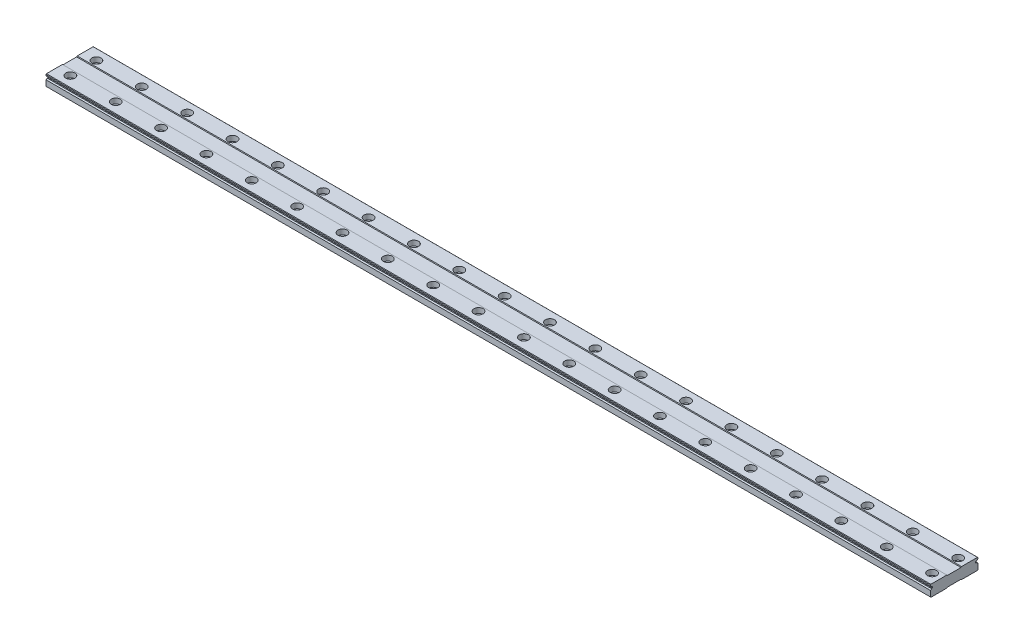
ISO-10303-21;
HEADER;
FILE_DESCRIPTION(('STEP AP214'),'2;1');
FILE_NAME('part.step','',(''),(''),'','','');
FILE_SCHEMA(('AUTOMOTIVE_DESIGN { 1 0 10303 214 1 1 1 1 }'));
ENDSEC;
DATA;
#1=APPLICATION_CONTEXT('core data for automotive mechanical design processes');
#2=APPLICATION_PROTOCOL_DEFINITION('international standard','automotive_design',2000,#1);
#3=PRODUCT_CONTEXT('',#1,'mechanical');
#4=PRODUCT('Part','Part','',(#3));
#5=PRODUCT_RELATED_PRODUCT_CATEGORY('part','',(#4));
#6=PRODUCT_DEFINITION_FORMATION('','',#4);
#7=PRODUCT_DEFINITION_CONTEXT('part definition',#1,'design');
#8=PRODUCT_DEFINITION('design','',#6,#7);
#9=PRODUCT_DEFINITION_SHAPE('','',#8);
#10=(LENGTH_UNIT() NAMED_UNIT(*) SI_UNIT(.MILLI.,.METRE.));
#11=(NAMED_UNIT(*) PLANE_ANGLE_UNIT() SI_UNIT($,.RADIAN.));
#12=(NAMED_UNIT(*) SI_UNIT($,.STERADIAN.) SOLID_ANGLE_UNIT());
#13=UNCERTAINTY_MEASURE_WITH_UNIT(LENGTH_MEASURE(1.E-05),#10,'distance_accuracy_value','');
#14=(GEOMETRIC_REPRESENTATION_CONTEXT(3) GLOBAL_UNCERTAINTY_ASSIGNED_CONTEXT((#13)) GLOBAL_UNIT_ASSIGNED_CONTEXT((#10,
#11,#12)) REPRESENTATION_CONTEXT('',''));
#15=CARTESIAN_POINT('',(0.,0.,0.));
#16=DIRECTION('',(0.,0.,1.));
#17=DIRECTION('',(1.,0.,0.));
#18=AXIS2_PLACEMENT_3D('',#15,#16,#17);
#19=CARTESIAN_POINT('',(760.,-5.6843418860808E-11,11.5));
#20=DIRECTION('',(0.,1.,0.));
#21=DIRECTION('',(0.,0.,1.));
#22=AXIS2_PLACEMENT_3D('',#19,#20,#21);
#23=CYLINDRICAL_SURFACE('',#22,2.25000000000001);
#24=CARTESIAN_POINT('',(760.,-5.6843418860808E-11,11.5));
#25=DIRECTION('',(0.,1.,0.));
#26=DIRECTION('',(0.,0.,-1.));
#27=AXIS2_PLACEMENT_3D('',#24,#25,#26);
#28=CIRCLE('',#27,2.25000000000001);
#29=CARTESIAN_POINT('',(760.,-5.6843418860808E-11,9.25));
#30=VERTEX_POINT('',#29);
#31=EDGE_CURVE('E1371',#30,#30,#28,.T.);
#32=ORIENTED_EDGE('',*,*,#31,.F.);
#33=EDGE_LOOP('',(#32));
#34=FACE_BOUND('',#33,.T.);
#35=CARTESIAN_POINT('',(760.,5.5,11.5));
#36=DIRECTION('',(0.,1.,0.));
#37=DIRECTION('',(0.,0.,1.));
#38=AXIS2_PLACEMENT_3D('',#35,#36,#37);
#39=CIRCLE('',#38,2.25000000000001);
#40=CARTESIAN_POINT('',(760.,5.5,13.75));
#41=VERTEX_POINT('',#40);
#42=EDGE_CURVE('E42',#41,#41,#39,.F.);
#43=ORIENTED_EDGE('',*,*,#42,.F.);
#44=EDGE_LOOP('',(#43));
#45=FACE_BOUND('',#44,.T.);
#46=ADVANCED_FACE('F38',(#34,#45),#23,.F.);
#47=CARTESIAN_POINT('',(760.,-5.6843418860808E-11,-11.5));
#48=DIRECTION('',(0.,1.,0.));
#49=DIRECTION('',(0.,0.,1.));
#50=AXIS2_PLACEMENT_3D('',#47,#48,#49);
#51=CYLINDRICAL_SURFACE('',#50,2.25000000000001);
#52=CARTESIAN_POINT('',(760.,-5.6843418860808E-11,-11.5));
#53=DIRECTION('',(0.,1.,0.));
#54=DIRECTION('',(0.,0.,1.));
#55=AXIS2_PLACEMENT_3D('',#52,#53,#54);
#56=CIRCLE('',#55,2.25000000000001);
#57=CARTESIAN_POINT('',(760.,-5.6843418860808E-11,-9.25));
#58=VERTEX_POINT('',#57);
#59=EDGE_CURVE('E1324',#58,#58,#56,.T.);
#60=ORIENTED_EDGE('',*,*,#59,.F.);
#61=EDGE_LOOP('',(#60));
#62=FACE_BOUND('',#61,.T.);
#63=CARTESIAN_POINT('',(760.,5.5,-11.5));
#64=DIRECTION('',(0.,1.,0.));
#65=DIRECTION('',(0.,0.,1.));
#66=AXIS2_PLACEMENT_3D('',#63,#64,#65);
#67=CIRCLE('',#66,2.25000000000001);
#68=CARTESIAN_POINT('',(760.,5.5,-9.25));
#69=VERTEX_POINT('',#68);
#70=EDGE_CURVE('E1416',#69,#69,#67,.F.);
#71=ORIENTED_EDGE('',*,*,#70,.F.);
#72=EDGE_LOOP('',(#71));
#73=FACE_BOUND('',#72,.T.);
#74=ADVANCED_FACE('F1151',(#62,#73),#51,.F.);
#75=CARTESIAN_POINT('',(720.,-5.6843418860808E-11,11.5));
#76=DIRECTION('',(0.,1.,0.));
#77=DIRECTION('',(0.,0.,1.));
#78=AXIS2_PLACEMENT_3D('',#75,#76,#77);
#79=CYLINDRICAL_SURFACE('',#78,2.25000000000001);
#80=CARTESIAN_POINT('',(720.,-5.6843418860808E-11,11.5));
#81=DIRECTION('',(0.,1.,0.));
#82=DIRECTION('',(0.,0.,-1.));
#83=AXIS2_PLACEMENT_3D('',#80,#81,#82);
#84=CIRCLE('',#83,2.25000000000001);
#85=CARTESIAN_POINT('',(720.,-5.6843418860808E-11,9.25));
#86=VERTEX_POINT('',#85);
#87=EDGE_CURVE('E1367',#86,#86,#84,.T.);
#88=ORIENTED_EDGE('',*,*,#87,.F.);
#89=EDGE_LOOP('',(#88));
#90=FACE_BOUND('',#89,.T.);
#91=CARTESIAN_POINT('',(720.,5.5,11.5));
#92=DIRECTION('',(0.,1.,0.));
#93=DIRECTION('',(0.,0.,1.));
#94=AXIS2_PLACEMENT_3D('',#91,#92,#93);
#95=CIRCLE('',#94,2.25000000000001);
#96=CARTESIAN_POINT('',(720.,5.5,13.75));
#97=VERTEX_POINT('',#96);
#98=EDGE_CURVE('E1409',#97,#97,#95,.F.);
#99=ORIENTED_EDGE('',*,*,#98,.F.);
#100=EDGE_LOOP('',(#99));
#101=FACE_BOUND('',#100,.T.);
#102=ADVANCED_FACE('F1157',(#90,#101),#79,.F.);
#103=CARTESIAN_POINT('',(720.,-5.6843418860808E-11,-11.5));
#104=DIRECTION('',(0.,1.,0.));
#105=DIRECTION('',(0.,0.,1.));
#106=AXIS2_PLACEMENT_3D('',#103,#104,#105);
#107=CYLINDRICAL_SURFACE('',#106,2.25000000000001);
#108=CARTESIAN_POINT('',(720.,-5.6843418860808E-11,-11.5));
#109=DIRECTION('',(0.,1.,0.));
#110=DIRECTION('',(0.,0.,1.));
#111=AXIS2_PLACEMENT_3D('',#108,#109,#110);
#112=CIRCLE('',#111,2.25000000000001);
#113=CARTESIAN_POINT('',(720.,-5.6843418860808E-11,-9.25));
#114=VERTEX_POINT('',#113);
#115=EDGE_CURVE('E1328',#114,#114,#112,.T.);
#116=ORIENTED_EDGE('',*,*,#115,.F.);
#117=EDGE_LOOP('',(#116));
#118=FACE_BOUND('',#117,.T.);
#119=CARTESIAN_POINT('',(720.,5.5,-11.5));
#120=DIRECTION('',(0.,1.,0.));
#121=DIRECTION('',(0.,0.,1.));
#122=AXIS2_PLACEMENT_3D('',#119,#120,#121);
#123=CIRCLE('',#122,2.25000000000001);
#124=CARTESIAN_POINT('',(720.,5.5,-9.25));
#125=VERTEX_POINT('',#124);
#126=EDGE_CURVE('E1402',#125,#125,#123,.F.);
#127=ORIENTED_EDGE('',*,*,#126,.F.);
#128=EDGE_LOOP('',(#127));
#129=FACE_BOUND('',#128,.T.);
#130=ADVANCED_FACE('F1168',(#118,#129),#107,.F.);
#131=CARTESIAN_POINT('',(680.,-5.6843418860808E-11,11.5));
#132=DIRECTION('',(0.,1.,0.));
#133=DIRECTION('',(0.,0.,1.));
#134=AXIS2_PLACEMENT_3D('',#131,#132,#133);
#135=CYLINDRICAL_SURFACE('',#134,2.25000000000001);
#136=CARTESIAN_POINT('',(680.,-5.6843418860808E-11,11.5));
#137=DIRECTION('',(0.,1.,0.));
#138=DIRECTION('',(0.,0.,-1.));
#139=AXIS2_PLACEMENT_3D('',#136,#137,#138);
#140=CIRCLE('',#139,2.25000000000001);
#141=CARTESIAN_POINT('',(680.,-5.6843418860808E-11,9.25));
#142=VERTEX_POINT('',#141);
#143=EDGE_CURVE('E1363',#142,#142,#140,.T.);
#144=ORIENTED_EDGE('',*,*,#143,.F.);
#145=EDGE_LOOP('',(#144));
#146=FACE_BOUND('',#145,.T.);
#147=CARTESIAN_POINT('',(680.,5.5,11.5));
#148=DIRECTION('',(0.,1.,0.));
#149=DIRECTION('',(0.,0.,1.));
#150=AXIS2_PLACEMENT_3D('',#147,#148,#149);
#151=CIRCLE('',#150,2.25000000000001);
#152=CARTESIAN_POINT('',(680.,5.5,13.75));
#153=VERTEX_POINT('',#152);
#154=EDGE_CURVE('E1395',#153,#153,#151,.F.);
#155=ORIENTED_EDGE('',*,*,#154,.F.);
#156=EDGE_LOOP('',(#155));
#157=FACE_BOUND('',#156,.T.);
#158=ADVANCED_FACE('F1172',(#146,#157),#135,.F.);
#159=CARTESIAN_POINT('',(680.,-5.6843418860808E-11,-11.5));
#160=DIRECTION('',(0.,1.,0.));
#161=DIRECTION('',(0.,0.,1.));
#162=AXIS2_PLACEMENT_3D('',#159,#160,#161);
#163=CYLINDRICAL_SURFACE('',#162,2.25000000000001);
#164=CARTESIAN_POINT('',(680.,-5.6843418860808E-11,-11.5));
#165=DIRECTION('',(0.,1.,0.));
#166=DIRECTION('',(0.,0.,1.));
#167=AXIS2_PLACEMENT_3D('',#164,#165,#166);
#168=CIRCLE('',#167,2.25000000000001);
#169=CARTESIAN_POINT('',(680.,-5.6843418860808E-11,-9.25));
#170=VERTEX_POINT('',#169);
#171=EDGE_CURVE('E1332',#170,#170,#168,.T.);
#172=ORIENTED_EDGE('',*,*,#171,.F.);
#173=EDGE_LOOP('',(#172));
#174=FACE_BOUND('',#173,.T.);
#175=CARTESIAN_POINT('',(680.,5.5,-11.5));
#176=DIRECTION('',(0.,1.,0.));
#177=DIRECTION('',(0.,0.,1.));
#178=AXIS2_PLACEMENT_3D('',#175,#176,#177);
#179=CIRCLE('',#178,2.25000000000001);
#180=CARTESIAN_POINT('',(680.,5.5,-9.25));
#181=VERTEX_POINT('',#180);
#182=EDGE_CURVE('E1388',#181,#181,#179,.F.);
#183=ORIENTED_EDGE('',*,*,#182,.F.);
#184=EDGE_LOOP('',(#183));
#185=FACE_BOUND('',#184,.T.);
#186=ADVANCED_FACE('F1176',(#174,#185),#163,.F.);
#187=CARTESIAN_POINT('',(640.,-5.6843418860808E-11,11.5));
#188=DIRECTION('',(0.,1.,0.));
#189=DIRECTION('',(0.,0.,1.));
#190=AXIS2_PLACEMENT_3D('',#187,#188,#189);
#191=CYLINDRICAL_SURFACE('',#190,2.25000000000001);
#192=CARTESIAN_POINT('',(640.,-5.6843418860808E-11,11.5));
#193=DIRECTION('',(0.,1.,0.));
#194=DIRECTION('',(0.,0.,-1.));
#195=AXIS2_PLACEMENT_3D('',#192,#193,#194);
#196=CIRCLE('',#195,2.25000000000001);
#197=CARTESIAN_POINT('',(640.,-5.6843418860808E-11,9.25));
#198=VERTEX_POINT('',#197);
#199=EDGE_CURVE('E1359',#198,#198,#196,.T.);
#200=ORIENTED_EDGE('',*,*,#199,.F.);
#201=EDGE_LOOP('',(#200));
#202=FACE_BOUND('',#201,.T.);
#203=CARTESIAN_POINT('',(640.,5.5,11.5));
#204=DIRECTION('',(0.,1.,0.));
#205=DIRECTION('',(0.,0.,1.));
#206=AXIS2_PLACEMENT_3D('',#203,#204,#205);
#207=CIRCLE('',#206,2.25000000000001);
#208=CARTESIAN_POINT('',(640.,5.5,13.75));
#209=VERTEX_POINT('',#208);
#210=EDGE_CURVE('E1381',#209,#209,#207,.F.);
#211=ORIENTED_EDGE('',*,*,#210,.F.);
#212=EDGE_LOOP('',(#211));
#213=FACE_BOUND('',#212,.T.);
#214=ADVANCED_FACE('F1180',(#202,#213),#191,.F.);
#215=CARTESIAN_POINT('',(640.,-5.6843418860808E-11,-11.5));
#216=DIRECTION('',(0.,1.,0.));
#217=DIRECTION('',(0.,0.,1.));
#218=AXIS2_PLACEMENT_3D('',#215,#216,#217);
#219=CYLINDRICAL_SURFACE('',#218,2.25000000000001);
#220=CARTESIAN_POINT('',(640.,-5.6843418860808E-11,-11.5));
#221=DIRECTION('',(0.,1.,0.));
#222=DIRECTION('',(0.,0.,1.));
#223=AXIS2_PLACEMENT_3D('',#220,#221,#222);
#224=CIRCLE('',#223,2.25000000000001);
#225=CARTESIAN_POINT('',(640.,-5.6843418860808E-11,-9.25));
#226=VERTEX_POINT('',#225);
#227=EDGE_CURVE('E1336',#226,#226,#224,.T.);
#228=ORIENTED_EDGE('',*,*,#227,.F.);
#229=EDGE_LOOP('',(#228));
#230=FACE_BOUND('',#229,.T.);
#231=CARTESIAN_POINT('',(640.,5.5,-11.5));
#232=DIRECTION('',(0.,1.,0.));
#233=DIRECTION('',(0.,0.,1.));
#234=AXIS2_PLACEMENT_3D('',#231,#232,#233);
#235=CIRCLE('',#234,2.25000000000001);
#236=CARTESIAN_POINT('',(640.,5.5,-9.25));
#237=VERTEX_POINT('',#236);
#238=EDGE_CURVE('E1374',#237,#237,#235,.F.);
#239=ORIENTED_EDGE('',*,*,#238,.F.);
#240=EDGE_LOOP('',(#239));
#241=FACE_BOUND('',#240,.T.);
#242=ADVANCED_FACE('F1184',(#230,#241),#219,.F.);
#243=CARTESIAN_POINT('',(600.,-5.6843418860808E-11,11.5));
#244=DIRECTION('',(0.,1.,0.));
#245=DIRECTION('',(0.,0.,1.));
#246=AXIS2_PLACEMENT_3D('',#243,#244,#245);
#247=CYLINDRICAL_SURFACE('',#246,2.25000000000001);
#248=CARTESIAN_POINT('',(600.,-5.6843418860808E-11,11.5));
#249=DIRECTION('',(0.,1.,0.));
#250=DIRECTION('',(0.,0.,-1.));
#251=AXIS2_PLACEMENT_3D('',#248,#249,#250);
#252=CIRCLE('',#251,2.25000000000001);
#253=CARTESIAN_POINT('',(600.,-5.6843418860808E-11,9.25));
#254=VERTEX_POINT('',#253);
#255=EDGE_CURVE('E1339',#254,#254,#252,.T.);
#256=ORIENTED_EDGE('',*,*,#255,.F.);
#257=EDGE_LOOP('',(#256));
#258=FACE_BOUND('',#257,.T.);
#259=CARTESIAN_POINT('',(600.,5.5,11.5));
#260=DIRECTION('',(0.,1.,0.));
#261=DIRECTION('',(0.,0.,1.));
#262=AXIS2_PLACEMENT_3D('',#259,#260,#261);
#263=CIRCLE('',#262,2.25000000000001);
#264=CARTESIAN_POINT('',(600.,5.5,13.75));
#265=VERTEX_POINT('',#264);
#266=EDGE_CURVE('E1351',#265,#265,#263,.F.);
#267=ORIENTED_EDGE('',*,*,#266,.F.);
#268=EDGE_LOOP('',(#267));
#269=FACE_BOUND('',#268,.T.);
#270=ADVANCED_FACE('F1188',(#258,#269),#247,.F.);
#271=CARTESIAN_POINT('',(600.,-5.6843418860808E-11,-11.5));
#272=DIRECTION('',(0.,1.,0.));
#273=DIRECTION('',(0.,0.,1.));
#274=AXIS2_PLACEMENT_3D('',#271,#272,#273);
#275=CYLINDRICAL_SURFACE('',#274,2.25000000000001);
#276=CARTESIAN_POINT('',(600.,-5.6843418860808E-11,-11.5));
#277=DIRECTION('',(0.,1.,0.));
#278=DIRECTION('',(0.,0.,1.));
#279=AXIS2_PLACEMENT_3D('',#276,#277,#278);
#280=CIRCLE('',#279,2.25000000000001);
#281=CARTESIAN_POINT('',(600.,-5.6843418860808E-11,-9.25));
#282=VERTEX_POINT('',#281);
#283=EDGE_CURVE('E281',#282,#282,#280,.T.);
#284=ORIENTED_EDGE('',*,*,#283,.F.);
#285=EDGE_LOOP('',(#284));
#286=FACE_BOUND('',#285,.T.);
#287=CARTESIAN_POINT('',(600.,5.5,-11.5));
#288=DIRECTION('',(0.,1.,0.));
#289=DIRECTION('',(0.,0.,1.));
#290=AXIS2_PLACEMENT_3D('',#287,#288,#289);
#291=CIRCLE('',#290,2.25000000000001);
#292=CARTESIAN_POINT('',(600.,5.5,-9.25));
#293=VERTEX_POINT('',#292);
#294=EDGE_CURVE('E597',#293,#293,#291,.F.);
#295=ORIENTED_EDGE('',*,*,#294,.F.);
#296=EDGE_LOOP('',(#295));
#297=FACE_BOUND('',#296,.T.);
#298=ADVANCED_FACE('F1209',(#286,#297),#275,.F.);
#299=CARTESIAN_POINT('',(580.,7.27999999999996,-19.38));
#300=DIRECTION('',(1.,0.,0.));
#301=DIRECTION('',(0.,0.,-1.));
#302=AXIS2_PLACEMENT_3D('',#299,#300,#301);
#303=CYLINDRICAL_SURFACE('',#302,0.400000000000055);
#304=DIRECTION('',(1.,0.,0.));
#305=VECTOR('',#304,1.);
#306=CARTESIAN_POINT('',(580.,7.40790230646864,-19.001));
#307=LINE('',#306,#305);
#308=CARTESIAN_POINT('',(768.,7.40790230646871,-19.001));
#309=VERTEX_POINT('',#308);
#310=CARTESIAN_POINT('',(-12.,7.40790230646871,-19.001));
#311=VERTEX_POINT('',#310);
#312=EDGE_CURVE('E464',#309,#311,#307,.F.);
#313=ORIENTED_EDGE('',*,*,#312,.T.);
#314=CARTESIAN_POINT('',(-12.,7.27999999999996,-19.38));
#315=DIRECTION('',(1.,0.,0.));
#316=DIRECTION('',(0.,0.,-1.));
#317=AXIS2_PLACEMENT_3D('',#314,#315,#316);
#318=CIRCLE('',#317,0.400000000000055);
#319=CARTESIAN_POINT('',(-12.,7.6343,-19.1943349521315));
#320=VERTEX_POINT('',#319);
#321=EDGE_CURVE('E458',#311,#320,#318,.F.);
#322=ORIENTED_EDGE('',*,*,#321,.T.);
#323=DIRECTION('',(1.,0.,0.));
#324=VECTOR('',#323,1.);
#325=CARTESIAN_POINT('',(580.,7.6343,-19.1943349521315));
#326=LINE('',#325,#324);
#327=CARTESIAN_POINT('',(768.,7.63429999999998,-19.1943349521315));
#328=VERTEX_POINT('',#327);
#329=EDGE_CURVE('E629',#320,#328,#326,.T.);
#330=ORIENTED_EDGE('',*,*,#329,.T.);
#331=CARTESIAN_POINT('',(768.,7.27999999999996,-19.38));
#332=DIRECTION('',(1.,0.,0.));
#333=DIRECTION('',(0.,0.,-1.));
#334=AXIS2_PLACEMENT_3D('',#331,#332,#333);
#335=CIRCLE('',#334,0.400000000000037);
#336=EDGE_CURVE('E348',#309,#328,#335,.F.);
#337=ORIENTED_EDGE('',*,*,#336,.F.);
#338=EDGE_LOOP('',(#313,#322,#330,#337));
#339=FACE_BOUND('',#338,.T.);
#340=ADVANCED_FACE('F40',(#339),#303,.F.);
#341=CARTESIAN_POINT('',(580.,7.27999999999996,19.38));
#342=DIRECTION('',(1.,0.,0.));
#343=DIRECTION('',(0.,0.,-1.));
#344=AXIS2_PLACEMENT_3D('',#341,#342,#343);
#345=CYLINDRICAL_SURFACE('',#344,0.400000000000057);
#346=DIRECTION('',(1.,0.,0.));
#347=VECTOR('',#346,1.);
#348=CARTESIAN_POINT('',(580.,7.63429999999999,19.1943349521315));
#349=LINE('',#348,#347);
#350=CARTESIAN_POINT('',(768.,7.63429999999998,19.1943349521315));
#351=VERTEX_POINT('',#350);
#352=CARTESIAN_POINT('',(-12.,7.63429999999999,19.1943349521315));
#353=VERTEX_POINT('',#352);
#354=EDGE_CURVE('E626',#351,#353,#349,.F.);
#355=ORIENTED_EDGE('',*,*,#354,.T.);
#356=CARTESIAN_POINT('',(-12.,7.27999999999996,19.38));
#357=DIRECTION('',(1.,0.,0.));
#358=DIRECTION('',(0.,0.,-1.));
#359=AXIS2_PLACEMENT_3D('',#356,#357,#358);
#360=CIRCLE('',#359,0.400000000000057);
#361=CARTESIAN_POINT('',(-12.,7.40790230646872,19.001));
#362=VERTEX_POINT('',#361);
#363=EDGE_CURVE('E433',#353,#362,#360,.F.);
#364=ORIENTED_EDGE('',*,*,#363,.T.);
#365=DIRECTION('',(-1.,0.,0.));
#366=VECTOR('',#365,1.);
#367=CARTESIAN_POINT('',(580.,7.40790230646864,19.001));
#368=LINE('',#367,#366);
#369=CARTESIAN_POINT('',(768.,7.40790230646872,19.001));
#370=VERTEX_POINT('',#369);
#371=EDGE_CURVE('E624',#362,#370,#368,.F.);
#372=ORIENTED_EDGE('',*,*,#371,.T.);
#373=CARTESIAN_POINT('',(768.,7.27999999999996,19.38));
#374=DIRECTION('',(1.,0.,0.));
#375=DIRECTION('',(0.,0.,-1.));
#376=AXIS2_PLACEMENT_3D('',#373,#374,#375);
#377=CIRCLE('',#376,0.400000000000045);
#378=EDGE_CURVE('E306',#351,#370,#377,.F.);
#379=ORIENTED_EDGE('',*,*,#378,.F.);
#380=EDGE_LOOP('',(#355,#364,#372,#379));
#381=FACE_BOUND('',#380,.T.);
#382=ADVANCED_FACE('F1122',(#381),#345,.F.);
#383=CARTESIAN_POINT('',(580.,6.59209769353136,-19.001));
#384=DIRECTION('',(0.,0.,1.));
#385=DIRECTION('',(1.,0.,0.));
#386=AXIS2_PLACEMENT_3D('',#383,#384,#385);
#387=PLANE('',#386);
#388=DIRECTION('',(1.,0.,0.));
#389=VECTOR('',#388,1.);
#390=CARTESIAN_POINT('',(580.,6.59209769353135,-19.001));
#391=LINE('',#390,#389);
#392=CARTESIAN_POINT('',(768.,6.59209769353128,-19.001));
#393=VERTEX_POINT('',#392);
#394=CARTESIAN_POINT('',(-12.,6.59209769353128,-19.001));
#395=VERTEX_POINT('',#394);
#396=EDGE_CURVE('E621',#393,#395,#391,.F.);
#397=ORIENTED_EDGE('',*,*,#396,.T.);
#398=DIRECTION('',(0.,1.,0.));
#399=VECTOR('',#398,1.);
#400=CARTESIAN_POINT('',(-12.,6.59209769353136,-19.001));
#401=LINE('',#400,#399);
#402=EDGE_CURVE('E455',#395,#311,#401,.T.);
#403=ORIENTED_EDGE('',*,*,#402,.T.);
#404=ORIENTED_EDGE('',*,*,#312,.F.);
#405=DIRECTION('',(0.,1.,0.));
#406=VECTOR('',#405,1.);
#407=CARTESIAN_POINT('',(768.,6.59209769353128,-19.001));
#408=LINE('',#407,#406);
#409=EDGE_CURVE('E351',#393,#309,#408,.T.);
#410=ORIENTED_EDGE('',*,*,#409,.F.);
#411=EDGE_LOOP('',(#397,#403,#404,#410));
#412=FACE_BOUND('',#411,.T.);
#413=ADVANCED_FACE('F1043',(#412),#387,.F.);
#414=CARTESIAN_POINT('',(580.,7.6343,-19.1943349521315));
#415=DIRECTION('',(0.,0.984811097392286,0.173629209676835));
#416=DIRECTION('',(0.,-0.173629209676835,0.984811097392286));
#417=AXIS2_PLACEMENT_3D('',#414,#415,#416);
#418=PLANE('',#417);
#419=ORIENTED_EDGE('',*,*,#329,.F.);
#420=DIRECTION('',(0.,0.173629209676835,-0.984811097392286));
#421=VECTOR('',#420,1.);
#422=CARTESIAN_POINT('',(-12.,7.63429999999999,-19.1943349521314));
#423=LINE('',#422,#421);
#424=CARTESIAN_POINT('',(-12.,7.75990000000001,-19.9067281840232));
#425=VERTEX_POINT('',#424);
#426=EDGE_CURVE('E461',#320,#425,#423,.T.);
#427=ORIENTED_EDGE('',*,*,#426,.T.);
#428=DIRECTION('',(1.,0.,0.));
#429=VECTOR('',#428,1.);
#430=CARTESIAN_POINT('',(580.,7.75990000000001,-19.9067281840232));
#431=LINE('',#430,#429);
#432=CARTESIAN_POINT('',(768.,7.75990000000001,-19.9067281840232));
#433=VERTEX_POINT('',#432);
#434=EDGE_CURVE('E619',#425,#433,#431,.T.);
#435=ORIENTED_EDGE('',*,*,#434,.T.);
#436=DIRECTION('',(0.,0.173629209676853,-0.984811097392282));
#437=VECTOR('',#436,1.);
#438=CARTESIAN_POINT('',(768.,7.63429999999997,-19.1943349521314));
#439=LINE('',#438,#437);
#440=EDGE_CURVE('E345',#328,#433,#439,.T.);
#441=ORIENTED_EDGE('',*,*,#440,.F.);
#442=EDGE_LOOP('',(#419,#427,#435,#441));
#443=FACE_BOUND('',#442,.T.);
#444=ADVANCED_FACE('F1038',(#443),#418,.F.);
#445=CARTESIAN_POINT('',(580.,7.7599,19.9067281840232));
#446=DIRECTION('',(0.,0.984811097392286,-0.173629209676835));
#447=DIRECTION('',(0.,0.173629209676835,0.984811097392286));
#448=AXIS2_PLACEMENT_3D('',#445,#446,#447);
#449=PLANE('',#448);
#450=DIRECTION('',(1.,0.,0.));
#451=VECTOR('',#450,1.);
#452=CARTESIAN_POINT('',(580.,7.75990000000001,19.9067281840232));
#453=LINE('',#452,#451);
#454=CARTESIAN_POINT('',(768.,7.7599,19.9067281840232));
#455=VERTEX_POINT('',#454);
#456=CARTESIAN_POINT('',(-12.,7.7599,19.9067281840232));
#457=VERTEX_POINT('',#456);
#458=EDGE_CURVE('E616',#455,#457,#453,.F.);
#459=ORIENTED_EDGE('',*,*,#458,.T.);
#460=DIRECTION('',(0.,-0.173629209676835,-0.984811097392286));
#461=VECTOR('',#460,1.);
#462=CARTESIAN_POINT('',(-12.,7.75990000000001,19.9067281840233));
#463=LINE('',#462,#461);
#464=EDGE_CURVE('E436',#457,#353,#463,.T.);
#465=ORIENTED_EDGE('',*,*,#464,.T.);
#466=ORIENTED_EDGE('',*,*,#354,.F.);
#467=DIRECTION('',(0.,-0.173629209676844,-0.984811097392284));
#468=VECTOR('',#467,1.);
#469=CARTESIAN_POINT('',(768.,7.75990000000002,19.9067281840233));
#470=LINE('',#469,#468);
#471=EDGE_CURVE('E309',#455,#351,#470,.T.);
#472=ORIENTED_EDGE('',*,*,#471,.F.);
#473=EDGE_LOOP('',(#459,#465,#466,#472));
#474=FACE_BOUND('',#473,.T.);
#475=ADVANCED_FACE('F1118',(#474),#449,.F.);
#476=CARTESIAN_POINT('',(580.,7.40790230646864,19.001));
#477=DIRECTION('',(0.,0.,-1.));
#478=DIRECTION('',(-1.,0.,0.));
#479=AXIS2_PLACEMENT_3D('',#476,#477,#478);
#480=PLANE('',#479);
#481=ORIENTED_EDGE('',*,*,#371,.F.);
#482=DIRECTION('',(0.,-1.,0.));
#483=VECTOR('',#482,1.);
#484=CARTESIAN_POINT('',(-12.,7.40790230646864,19.001));
#485=LINE('',#484,#483);
#486=CARTESIAN_POINT('',(-12.,6.59209769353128,19.001));
#487=VERTEX_POINT('',#486);
#488=EDGE_CURVE('E430',#362,#487,#485,.T.);
#489=ORIENTED_EDGE('',*,*,#488,.T.);
#490=DIRECTION('',(1.,0.,0.));
#491=VECTOR('',#490,1.);
#492=CARTESIAN_POINT('',(580.,6.59209769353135,19.001));
#493=LINE('',#492,#491);
#494=CARTESIAN_POINT('',(768.,6.59209769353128,19.001));
#495=VERTEX_POINT('',#494);
#496=EDGE_CURVE('E614',#487,#495,#493,.T.);
#497=ORIENTED_EDGE('',*,*,#496,.T.);
#498=DIRECTION('',(0.,-1.,0.));
#499=VECTOR('',#498,1.);
#500=CARTESIAN_POINT('',(768.,7.40790230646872,19.001));
#501=LINE('',#500,#499);
#502=EDGE_CURVE('E303',#370,#495,#501,.T.);
#503=ORIENTED_EDGE('',*,*,#502,.F.);
#504=EDGE_LOOP('',(#481,#489,#497,#503));
#505=FACE_BOUND('',#504,.T.);
#506=ADVANCED_FACE('F1125',(#505),#480,.F.);
#507=CARTESIAN_POINT('',(580.,6.72000000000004,-19.38));
#508=DIRECTION('',(1.,0.,0.));
#509=DIRECTION('',(0.,0.,-1.));
#510=AXIS2_PLACEMENT_3D('',#507,#508,#509);
#511=CYLINDRICAL_SURFACE('',#510,0.400000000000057);
#512=DIRECTION('',(1.,0.,0.));
#513=VECTOR('',#512,1.);
#514=CARTESIAN_POINT('',(580.,6.36570000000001,-19.1943349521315));
#515=LINE('',#514,#513);
#516=CARTESIAN_POINT('',(768.,6.36570000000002,-19.1943349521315));
#517=VERTEX_POINT('',#516);
#518=CARTESIAN_POINT('',(-12.,6.36570000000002,-19.1943349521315));
#519=VERTEX_POINT('',#518);
#520=EDGE_CURVE('E611',#517,#519,#515,.F.);
#521=ORIENTED_EDGE('',*,*,#520,.T.);
#522=CARTESIAN_POINT('',(-12.,6.72000000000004,-19.38));
#523=DIRECTION('',(1.,0.,0.));
#524=DIRECTION('',(0.,0.,-1.));
#525=AXIS2_PLACEMENT_3D('',#522,#523,#524);
#526=CIRCLE('',#525,0.400000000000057);
#527=EDGE_CURVE('E452',#519,#395,#526,.F.);
#528=ORIENTED_EDGE('',*,*,#527,.T.);
#529=ORIENTED_EDGE('',*,*,#396,.F.);
#530=CARTESIAN_POINT('',(768.,6.72000000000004,-19.38));
#531=DIRECTION('',(1.,0.,0.));
#532=DIRECTION('',(0.,0.,-1.));
#533=AXIS2_PLACEMENT_3D('',#530,#531,#532);
#534=CIRCLE('',#533,0.400000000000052);
#535=EDGE_CURVE('E354',#517,#393,#534,.F.);
#536=ORIENTED_EDGE('',*,*,#535,.F.);
#537=EDGE_LOOP('',(#521,#528,#529,#536));
#538=FACE_BOUND('',#537,.T.);
#539=ADVANCED_FACE('F1045',(#538),#511,.F.);
#540=CARTESIAN_POINT('',(580.,7.,-21.2));
#541=DIRECTION('',(1.,0.,0.));
#542=DIRECTION('',(0.,0.,-1.));
#543=AXIS2_PLACEMENT_3D('',#540,#541,#542);
#544=CYLINDRICAL_SURFACE('',#543,1.5);
#545=ORIENTED_EDGE('',*,*,#434,.F.);
#546=CARTESIAN_POINT('',(-12.,7.,-21.2));
#547=DIRECTION('',(1.,0.,0.));
#548=DIRECTION('',(0.,0.,-1.));
#549=AXIS2_PLACEMENT_3D('',#546,#547,#548);
#550=CIRCLE('',#549,1.5);
#551=CARTESIAN_POINT('',(-12.,8.48660687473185,-21.));
#552=VERTEX_POINT('',#551);
#553=EDGE_CURVE('E61',#425,#552,#550,.F.);
#554=ORIENTED_EDGE('',*,*,#553,.T.);
#555=DIRECTION('',(1.,0.,0.));
#556=VECTOR('',#555,1.);
#557=CARTESIAN_POINT('',(580.,8.48660687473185,-21.));
#558=LINE('',#557,#556);
#559=CARTESIAN_POINT('',(768.,8.48660687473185,-21.));
#560=VERTEX_POINT('',#559);
#561=EDGE_CURVE('E609',#552,#560,#558,.T.);
#562=ORIENTED_EDGE('',*,*,#561,.T.);
#563=CARTESIAN_POINT('',(768.,7.,-21.2));
#564=DIRECTION('',(1.,0.,0.));
#565=DIRECTION('',(0.,0.,-1.));
#566=AXIS2_PLACEMENT_3D('',#563,#564,#565);
#567=CIRCLE('',#566,1.5);
#568=EDGE_CURVE('E342',#433,#560,#567,.F.);
#569=ORIENTED_EDGE('',*,*,#568,.F.);
#570=EDGE_LOOP('',(#545,#554,#562,#569));
#571=FACE_BOUND('',#570,.T.);
#572=ADVANCED_FACE('F1033',(#571),#544,.F.);
#573=CARTESIAN_POINT('',(580.,7.,21.2));
#574=DIRECTION('',(1.,0.,0.));
#575=DIRECTION('',(0.,0.,-1.));
#576=AXIS2_PLACEMENT_3D('',#573,#574,#575);
#577=CYLINDRICAL_SURFACE('',#576,1.5);
#578=DIRECTION('',(-1.,0.,0.));
#579=VECTOR('',#578,1.);
#580=CARTESIAN_POINT('',(580.,8.48660687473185,21.));
#581=LINE('',#580,#579);
#582=CARTESIAN_POINT('',(768.,8.48660687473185,21.));
#583=VERTEX_POINT('',#582);
#584=CARTESIAN_POINT('',(-12.,8.48660687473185,21.));
#585=VERTEX_POINT('',#584);
#586=EDGE_CURVE('E606',#583,#585,#581,.T.);
#587=ORIENTED_EDGE('',*,*,#586,.T.);
#588=CARTESIAN_POINT('',(-12.,7.,21.2));
#589=DIRECTION('',(1.,0.,0.));
#590=DIRECTION('',(0.,0.,-1.));
#591=AXIS2_PLACEMENT_3D('',#588,#589,#590);
#592=CIRCLE('',#591,1.5);
#593=EDGE_CURVE('E439',#585,#457,#592,.F.);
#594=ORIENTED_EDGE('',*,*,#593,.T.);
#595=ORIENTED_EDGE('',*,*,#458,.F.);
#596=CARTESIAN_POINT('',(768.,7.,21.2));
#597=DIRECTION('',(1.,0.,0.));
#598=DIRECTION('',(0.,0.,-1.));
#599=AXIS2_PLACEMENT_3D('',#596,#597,#598);
#600=CIRCLE('',#599,1.5);
#601=EDGE_CURVE('E312',#583,#455,#600,.F.);
#602=ORIENTED_EDGE('',*,*,#601,.F.);
#603=EDGE_LOOP('',(#587,#594,#595,#602));
#604=FACE_BOUND('',#603,.T.);
#605=ADVANCED_FACE('F1115',(#604),#577,.F.);
#606=CARTESIAN_POINT('',(580.,6.72000000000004,19.38));
#607=DIRECTION('',(1.,0.,0.));
#608=DIRECTION('',(0.,0.,-1.));
#609=AXIS2_PLACEMENT_3D('',#606,#607,#608);
#610=CYLINDRICAL_SURFACE('',#609,0.400000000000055);
#611=ORIENTED_EDGE('',*,*,#496,.F.);
#612=CARTESIAN_POINT('',(-12.,6.72000000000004,19.38));
#613=DIRECTION('',(1.,0.,0.));
#614=DIRECTION('',(0.,0.,-1.));
#615=AXIS2_PLACEMENT_3D('',#612,#613,#614);
#616=CIRCLE('',#615,0.400000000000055);
#617=CARTESIAN_POINT('',(-12.,6.3657,19.1943349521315));
#618=VERTEX_POINT('',#617);
#619=EDGE_CURVE('E427',#487,#618,#616,.F.);
#620=ORIENTED_EDGE('',*,*,#619,.T.);
#621=DIRECTION('',(1.,0.,0.));
#622=VECTOR('',#621,1.);
#623=CARTESIAN_POINT('',(580.,6.3657,19.1943349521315));
#624=LINE('',#623,#622);
#625=CARTESIAN_POINT('',(768.,6.3657,19.1943349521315));
#626=VERTEX_POINT('',#625);
#627=EDGE_CURVE('E603',#618,#626,#624,.T.);
#628=ORIENTED_EDGE('',*,*,#627,.T.);
#629=CARTESIAN_POINT('',(768.,6.72000000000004,19.38));
#630=DIRECTION('',(1.,0.,0.));
#631=DIRECTION('',(0.,0.,-1.));
#632=AXIS2_PLACEMENT_3D('',#629,#630,#631);
#633=CIRCLE('',#632,0.400000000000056);
#634=EDGE_CURVE('E300',#495,#626,#633,.F.);
#635=ORIENTED_EDGE('',*,*,#634,.F.);
#636=EDGE_LOOP('',(#611,#620,#628,#635));
#637=FACE_BOUND('',#636,.T.);
#638=ADVANCED_FACE('F1129',(#637),#610,.F.);
#639=CARTESIAN_POINT('',(580.,6.2401,-19.9067281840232));
#640=DIRECTION('',(0.,-0.984811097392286,0.173629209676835));
#641=DIRECTION('',(0.,-0.173629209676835,-0.984811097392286));
#642=AXIS2_PLACEMENT_3D('',#639,#640,#641);
#643=PLANE('',#642);
#644=DIRECTION('',(1.,0.,0.));
#645=VECTOR('',#644,1.);
#646=CARTESIAN_POINT('',(580.,6.24009999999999,-19.9067281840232));
#647=LINE('',#646,#645);
#648=CARTESIAN_POINT('',(768.,6.2401,-19.9067281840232));
#649=VERTEX_POINT('',#648);
#650=CARTESIAN_POINT('',(-12.,6.2401,-19.9067281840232));
#651=VERTEX_POINT('',#650);
#652=EDGE_CURVE('E595',#649,#651,#647,.F.);
#653=ORIENTED_EDGE('',*,*,#652,.T.);
#654=DIRECTION('',(0.,0.173629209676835,0.984811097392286));
#655=VECTOR('',#654,1.);
#656=CARTESIAN_POINT('',(-12.,6.24010000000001,-19.9067281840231));
#657=LINE('',#656,#655);
#658=EDGE_CURVE('E449',#651,#519,#657,.T.);
#659=ORIENTED_EDGE('',*,*,#658,.T.);
#660=ORIENTED_EDGE('',*,*,#520,.F.);
#661=DIRECTION('',(0.,0.17362920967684,0.984811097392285));
#662=VECTOR('',#661,1.);
#663=CARTESIAN_POINT('',(768.,6.24010000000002,-19.9067281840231));
#664=LINE('',#663,#662);
#665=EDGE_CURVE('E357',#649,#517,#664,.T.);
#666=ORIENTED_EDGE('',*,*,#665,.F.);
#667=EDGE_LOOP('',(#653,#659,#660,#666));
#668=FACE_BOUND('',#667,.T.);
#669=ADVANCED_FACE('F1050',(#668),#643,.F.);
#670=CARTESIAN_POINT('',(524.,5.5,-11.5));
#671=DIRECTION('',(0.,1.,0.));
#672=DIRECTION('',(0.,0.,1.));
#673=AXIS2_PLACEMENT_3D('',#670,#671,#672);
#674=PLANE('',#673);
#675=CARTESIAN_POINT('',(520.,5.5,-11.5));
#676=DIRECTION('',(0.,1.,0.));
#677=DIRECTION('',(0.,0.,1.));
#678=AXIS2_PLACEMENT_3D('',#675,#676,#677);
#679=CIRCLE('',#678,4.);
#680=CARTESIAN_POINT('',(520.,5.5,-7.5));
#681=VERTEX_POINT('',#680);
#682=EDGE_CURVE('E938',#681,#681,#679,.T.);
#683=ORIENTED_EDGE('',*,*,#682,.T.);
#684=EDGE_LOOP('',(#683));
#685=FACE_BOUND('',#684,.T.);
#686=CARTESIAN_POINT('',(520.,5.5,-11.5));
#687=DIRECTION('',(0.,1.,0.));
#688=DIRECTION('',(0.,0.,1.));
#689=AXIS2_PLACEMENT_3D('',#686,#687,#688);
#690=CIRCLE('',#689,2.25);
#691=CARTESIAN_POINT('',(520.,5.5,-9.25));
#692=VERTEX_POINT('',#691);
#693=EDGE_CURVE('E596',#692,#692,#690,.F.);
#694=ORIENTED_EDGE('',*,*,#693,.T.);
#695=EDGE_LOOP('',(#694));
#696=FACE_BOUND('',#695,.T.);
#697=ADVANCED_FACE('F1819',(#685,#696),#674,.T.);
#698=CARTESIAN_POINT('',(444.,5.5,-11.5));
#699=DIRECTION('',(0.,1.,0.));
#700=DIRECTION('',(0.,0.,1.));
#701=AXIS2_PLACEMENT_3D('',#698,#699,#700);
#702=PLANE('',#701);
#703=CARTESIAN_POINT('',(440.,5.5,-11.5));
#704=DIRECTION('',(0.,1.,0.));
#705=DIRECTION('',(0.,0.,1.));
#706=AXIS2_PLACEMENT_3D('',#703,#704,#705);
#707=CIRCLE('',#706,4.);
#708=CARTESIAN_POINT('',(440.,5.5,-7.5));
#709=VERTEX_POINT('',#708);
#710=EDGE_CURVE('E935',#709,#709,#707,.T.);
#711=ORIENTED_EDGE('',*,*,#710,.T.);
#712=EDGE_LOOP('',(#711));
#713=FACE_BOUND('',#712,.T.);
#714=CARTESIAN_POINT('',(440.,5.5,-11.5));
#715=DIRECTION('',(0.,1.,0.));
#716=DIRECTION('',(0.,0.,1.));
#717=AXIS2_PLACEMENT_3D('',#714,#715,#716);
#718=CIRCLE('',#717,2.25);
#719=CARTESIAN_POINT('',(440.,5.5,-9.25));
#720=VERTEX_POINT('',#719);
#721=EDGE_CURVE('E943',#720,#720,#718,.F.);
#722=ORIENTED_EDGE('',*,*,#721,.T.);
#723=EDGE_LOOP('',(#722));
#724=FACE_BOUND('',#723,.T.);
#725=ADVANCED_FACE('F1815',(#713,#724),#702,.T.);
#726=CARTESIAN_POINT('',(364.,5.5,-11.5));
#727=DIRECTION('',(0.,1.,0.));
#728=DIRECTION('',(0.,0.,1.));
#729=AXIS2_PLACEMENT_3D('',#726,#727,#728);
#730=PLANE('',#729);
#731=CARTESIAN_POINT('',(360.,5.5,-11.5));
#732=DIRECTION('',(0.,1.,0.));
#733=DIRECTION('',(0.,0.,1.));
#734=AXIS2_PLACEMENT_3D('',#731,#732,#733);
#735=CIRCLE('',#734,4.);
#736=CARTESIAN_POINT('',(360.,5.5,-7.5));
#737=VERTEX_POINT('',#736);
#738=EDGE_CURVE('E932',#737,#737,#735,.T.);
#739=ORIENTED_EDGE('',*,*,#738,.T.);
#740=EDGE_LOOP('',(#739));
#741=FACE_BOUND('',#740,.T.);
#742=CARTESIAN_POINT('',(360.,5.5,-11.5));
#743=DIRECTION('',(0.,1.,0.));
#744=DIRECTION('',(0.,0.,1.));
#745=AXIS2_PLACEMENT_3D('',#742,#743,#744);
#746=CIRCLE('',#745,2.25);
#747=CARTESIAN_POINT('',(360.,5.5,-9.25));
#748=VERTEX_POINT('',#747);
#749=EDGE_CURVE('E946',#748,#748,#746,.F.);
#750=ORIENTED_EDGE('',*,*,#749,.T.);
#751=EDGE_LOOP('',(#750));
#752=FACE_BOUND('',#751,.T.);
#753=ADVANCED_FACE('F1811',(#741,#752),#730,.T.);
#754=CARTESIAN_POINT('',(284.,5.5,-11.5));
#755=DIRECTION('',(0.,1.,0.));
#756=DIRECTION('',(0.,0.,1.));
#757=AXIS2_PLACEMENT_3D('',#754,#755,#756);
#758=PLANE('',#757);
#759=CARTESIAN_POINT('',(280.,5.5,-11.5));
#760=DIRECTION('',(0.,1.,0.));
#761=DIRECTION('',(0.,0.,1.));
#762=AXIS2_PLACEMENT_3D('',#759,#760,#761);
#763=CIRCLE('',#762,4.);
#764=CARTESIAN_POINT('',(280.,5.5,-7.5));
#765=VERTEX_POINT('',#764);
#766=EDGE_CURVE('E929',#765,#765,#763,.T.);
#767=ORIENTED_EDGE('',*,*,#766,.T.);
#768=EDGE_LOOP('',(#767));
#769=FACE_BOUND('',#768,.T.);
#770=CARTESIAN_POINT('',(280.,5.5,-11.5));
#771=DIRECTION('',(0.,1.,0.));
#772=DIRECTION('',(0.,0.,1.));
#773=AXIS2_PLACEMENT_3D('',#770,#771,#772);
#774=CIRCLE('',#773,2.25);
#775=CARTESIAN_POINT('',(280.,5.5,-9.25));
#776=VERTEX_POINT('',#775);
#777=EDGE_CURVE('E949',#776,#776,#774,.F.);
#778=ORIENTED_EDGE('',*,*,#777,.T.);
#779=EDGE_LOOP('',(#778));
#780=FACE_BOUND('',#779,.T.);
#781=ADVANCED_FACE('F1807',(#769,#780),#758,.T.);
#782=CARTESIAN_POINT('',(204.,5.5,-11.5));
#783=DIRECTION('',(0.,1.,0.));
#784=DIRECTION('',(0.,0.,1.));
#785=AXIS2_PLACEMENT_3D('',#782,#783,#784);
#786=PLANE('',#785);
#787=CARTESIAN_POINT('',(200.,5.5,-11.5));
#788=DIRECTION('',(0.,1.,0.));
#789=DIRECTION('',(0.,0.,1.));
#790=AXIS2_PLACEMENT_3D('',#787,#788,#789);
#791=CIRCLE('',#790,4.);
#792=CARTESIAN_POINT('',(200.,5.5,-7.5));
#793=VERTEX_POINT('',#792);
#794=EDGE_CURVE('E926',#793,#793,#791,.T.);
#795=ORIENTED_EDGE('',*,*,#794,.T.);
#796=EDGE_LOOP('',(#795));
#797=FACE_BOUND('',#796,.T.);
#798=CARTESIAN_POINT('',(200.,5.5,-11.5));
#799=DIRECTION('',(0.,1.,0.));
#800=DIRECTION('',(0.,0.,1.));
#801=AXIS2_PLACEMENT_3D('',#798,#799,#800);
#802=CIRCLE('',#801,2.25);
#803=CARTESIAN_POINT('',(200.,5.5,-9.25));
#804=VERTEX_POINT('',#803);
#805=EDGE_CURVE('E952',#804,#804,#802,.F.);
#806=ORIENTED_EDGE('',*,*,#805,.T.);
#807=EDGE_LOOP('',(#806));
#808=FACE_BOUND('',#807,.T.);
#809=ADVANCED_FACE('F1803',(#797,#808),#786,.T.);
#810=CARTESIAN_POINT('',(124.,5.5,-11.5));
#811=DIRECTION('',(0.,1.,0.));
#812=DIRECTION('',(0.,0.,1.));
#813=AXIS2_PLACEMENT_3D('',#810,#811,#812);
#814=PLANE('',#813);
#815=CARTESIAN_POINT('',(120.,5.5,-11.5));
#816=DIRECTION('',(0.,1.,0.));
#817=DIRECTION('',(0.,0.,1.));
#818=AXIS2_PLACEMENT_3D('',#815,#816,#817);
#819=CIRCLE('',#818,4.);
#820=CARTESIAN_POINT('',(120.,5.5,-7.5));
#821=VERTEX_POINT('',#820);
#822=EDGE_CURVE('E923',#821,#821,#819,.T.);
#823=ORIENTED_EDGE('',*,*,#822,.T.);
#824=EDGE_LOOP('',(#823));
#825=FACE_BOUND('',#824,.T.);
#826=CARTESIAN_POINT('',(120.,5.5,-11.5));
#827=DIRECTION('',(0.,1.,0.));
#828=DIRECTION('',(0.,0.,1.));
#829=AXIS2_PLACEMENT_3D('',#826,#827,#828);
#830=CIRCLE('',#829,2.25);
#831=CARTESIAN_POINT('',(120.,5.5,-9.25));
#832=VERTEX_POINT('',#831);
#833=EDGE_CURVE('E955',#832,#832,#830,.F.);
#834=ORIENTED_EDGE('',*,*,#833,.T.);
#835=EDGE_LOOP('',(#834));
#836=FACE_BOUND('',#835,.T.);
#837=ADVANCED_FACE('F1799',(#825,#836),#814,.T.);
#838=CARTESIAN_POINT('',(44.,5.5,-11.5));
#839=DIRECTION('',(0.,1.,0.));
#840=DIRECTION('',(0.,0.,1.));
#841=AXIS2_PLACEMENT_3D('',#838,#839,#840);
#842=PLANE('',#841);
#843=CARTESIAN_POINT('',(40.,5.5,-11.5));
#844=DIRECTION('',(0.,1.,0.));
#845=DIRECTION('',(0.,0.,1.));
#846=AXIS2_PLACEMENT_3D('',#843,#844,#845);
#847=CIRCLE('',#846,4.);
#848=CARTESIAN_POINT('',(40.,5.5,-7.5));
#849=VERTEX_POINT('',#848);
#850=EDGE_CURVE('E920',#849,#849,#847,.T.);
#851=ORIENTED_EDGE('',*,*,#850,.T.);
#852=EDGE_LOOP('',(#851));
#853=FACE_BOUND('',#852,.T.);
#854=CARTESIAN_POINT('',(40.,5.5,-11.5));
#855=DIRECTION('',(0.,1.,0.));
#856=DIRECTION('',(0.,0.,1.));
#857=AXIS2_PLACEMENT_3D('',#854,#855,#856);
#858=CIRCLE('',#857,2.25);
#859=CARTESIAN_POINT('',(40.,5.5,-9.25));
#860=VERTEX_POINT('',#859);
#861=EDGE_CURVE('E958',#860,#860,#858,.F.);
#862=ORIENTED_EDGE('',*,*,#861,.T.);
#863=EDGE_LOOP('',(#862));
#864=FACE_BOUND('',#863,.T.);
#865=ADVANCED_FACE('F1796',(#853,#864),#842,.T.);
#866=CARTESIAN_POINT('',(580.,8.48660687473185,-21.));
#867=DIRECTION('',(0.,0.,1.));
#868=DIRECTION('',(1.,0.,0.));
#869=AXIS2_PLACEMENT_3D('',#866,#867,#868);
#870=PLANE('',#869);
#871=ORIENTED_EDGE('',*,*,#561,.F.);
#872=DIRECTION('',(0.,1.,0.));
#873=VECTOR('',#872,1.);
#874=CARTESIAN_POINT('',(-12.,-0.000103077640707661,-21.));
#875=LINE('',#874,#873);
#876=CARTESIAN_POINT('',(-12.,9.50000000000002,-21.));
#877=VERTEX_POINT('',#876);
#878=EDGE_CURVE('E385',#552,#877,#875,.T.);
#879=ORIENTED_EDGE('',*,*,#878,.T.);
#880=DIRECTION('',(1.,0.,0.));
#881=VECTOR('',#880,1.);
#882=CARTESIAN_POINT('',(580.,9.5,-21.));
#883=LINE('',#882,#881);
#884=CARTESIAN_POINT('',(768.,9.50000000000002,-21.));
#885=VERTEX_POINT('',#884);
#886=EDGE_CURVE('E919',#885,#877,#883,.F.);
#887=ORIENTED_EDGE('',*,*,#886,.F.);
#888=DIRECTION('',(0.,1.,0.));
#889=VECTOR('',#888,1.);
#890=CARTESIAN_POINT('',(768.,8.48660687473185,-21.));
#891=LINE('',#890,#889);
#892=EDGE_CURVE('E339',#560,#885,#891,.T.);
#893=ORIENTED_EDGE('',*,*,#892,.F.);
#894=EDGE_LOOP('',(#871,#879,#887,#893));
#895=FACE_BOUND('',#894,.T.);
#896=ADVANCED_FACE('F1029',(#895),#870,.F.);
#897=CARTESIAN_POINT('',(4.,5.5,-11.5));
#898=DIRECTION('',(0.,1.,0.));
#899=DIRECTION('',(0.,0.,1.));
#900=AXIS2_PLACEMENT_3D('',#897,#898,#899);
#901=PLANE('',#900);
#902=CARTESIAN_POINT('',(0.,5.5,-11.5));
#903=DIRECTION('',(0.,1.,0.));
#904=DIRECTION('',(0.,0.,1.));
#905=AXIS2_PLACEMENT_3D('',#902,#903,#904);
#906=CIRCLE('',#905,4.);
#907=CARTESIAN_POINT('',(0.,5.5,-7.5));
#908=VERTEX_POINT('',#907);
#909=EDGE_CURVE('E916',#908,#908,#906,.T.);
#910=ORIENTED_EDGE('',*,*,#909,.T.);
#911=EDGE_LOOP('',(#910));
#912=FACE_BOUND('',#911,.T.);
#913=CARTESIAN_POINT('',(0.,5.5,-11.5));
#914=DIRECTION('',(0.,1.,0.));
#915=DIRECTION('',(0.,0.,1.));
#916=AXIS2_PLACEMENT_3D('',#913,#914,#915);
#917=CIRCLE('',#916,2.25);
#918=CARTESIAN_POINT('',(0.,5.5,-9.25));
#919=VERTEX_POINT('',#918);
#920=EDGE_CURVE('E961',#919,#919,#917,.F.);
#921=ORIENTED_EDGE('',*,*,#920,.T.);
#922=EDGE_LOOP('',(#921));
#923=FACE_BOUND('',#922,.T.);
#924=ADVANCED_FACE('F1789',(#912,#923),#901,.T.);
#925=CARTESIAN_POINT('',(84.,5.5,-11.5));
#926=DIRECTION('',(0.,1.,0.));
#927=DIRECTION('',(0.,0.,1.));
#928=AXIS2_PLACEMENT_3D('',#925,#926,#927);
#929=PLANE('',#928);
#930=CARTESIAN_POINT('',(80.,5.5,-11.5));
#931=DIRECTION('',(0.,1.,0.));
#932=DIRECTION('',(0.,0.,1.));
#933=AXIS2_PLACEMENT_3D('',#930,#931,#932);
#934=CIRCLE('',#933,4.);
#935=CARTESIAN_POINT('',(80.,5.5,-7.5));
#936=VERTEX_POINT('',#935);
#937=EDGE_CURVE('E913',#936,#936,#934,.T.);
#938=ORIENTED_EDGE('',*,*,#937,.T.);
#939=EDGE_LOOP('',(#938));
#940=FACE_BOUND('',#939,.T.);
#941=CARTESIAN_POINT('',(80.,5.5,-11.5));
#942=DIRECTION('',(0.,1.,0.));
#943=DIRECTION('',(0.,0.,1.));
#944=AXIS2_PLACEMENT_3D('',#941,#942,#943);
#945=CIRCLE('',#944,2.25);
#946=CARTESIAN_POINT('',(80.,5.5,-9.25));
#947=VERTEX_POINT('',#946);
#948=EDGE_CURVE('E964',#947,#947,#945,.F.);
#949=ORIENTED_EDGE('',*,*,#948,.T.);
#950=EDGE_LOOP('',(#949));
#951=FACE_BOUND('',#950,.T.);
#952=ADVANCED_FACE('F1785',(#940,#951),#929,.T.);
#953=CARTESIAN_POINT('',(164.,5.5,-11.5));
#954=DIRECTION('',(0.,1.,0.));
#955=DIRECTION('',(0.,0.,1.));
#956=AXIS2_PLACEMENT_3D('',#953,#954,#955);
#957=PLANE('',#956);
#958=CARTESIAN_POINT('',(160.,5.5,-11.5));
#959=DIRECTION('',(0.,1.,0.));
#960=DIRECTION('',(0.,0.,1.));
#961=AXIS2_PLACEMENT_3D('',#958,#959,#960);
#962=CIRCLE('',#961,4.);
#963=CARTESIAN_POINT('',(160.,5.5,-7.5));
#964=VERTEX_POINT('',#963);
#965=EDGE_CURVE('E910',#964,#964,#962,.T.);
#966=ORIENTED_EDGE('',*,*,#965,.T.);
#967=EDGE_LOOP('',(#966));
#968=FACE_BOUND('',#967,.T.);
#969=CARTESIAN_POINT('',(160.,5.5,-11.5));
#970=DIRECTION('',(0.,1.,0.));
#971=DIRECTION('',(0.,0.,1.));
#972=AXIS2_PLACEMENT_3D('',#969,#970,#971);
#973=CIRCLE('',#972,2.25);
#974=CARTESIAN_POINT('',(160.,5.5,-9.25));
#975=VERTEX_POINT('',#974);
#976=EDGE_CURVE('E967',#975,#975,#973,.F.);
#977=ORIENTED_EDGE('',*,*,#976,.T.);
#978=EDGE_LOOP('',(#977));
#979=FACE_BOUND('',#978,.T.);
#980=ADVANCED_FACE('F1781',(#968,#979),#957,.T.);
#981=CARTESIAN_POINT('',(244.,5.5,-11.5));
#982=DIRECTION('',(0.,1.,0.));
#983=DIRECTION('',(0.,0.,1.));
#984=AXIS2_PLACEMENT_3D('',#981,#982,#983);
#985=PLANE('',#984);
#986=CARTESIAN_POINT('',(240.,5.5,-11.5));
#987=DIRECTION('',(0.,1.,0.));
#988=DIRECTION('',(0.,0.,1.));
#989=AXIS2_PLACEMENT_3D('',#986,#987,#988);
#990=CIRCLE('',#989,4.);
#991=CARTESIAN_POINT('',(240.,5.5,-7.5));
#992=VERTEX_POINT('',#991);
#993=EDGE_CURVE('E907',#992,#992,#990,.T.);
#994=ORIENTED_EDGE('',*,*,#993,.T.);
#995=EDGE_LOOP('',(#994));
#996=FACE_BOUND('',#995,.T.);
#997=CARTESIAN_POINT('',(240.,5.5,-11.5));
#998=DIRECTION('',(0.,1.,0.));
#999=DIRECTION('',(0.,0.,1.));
#1000=AXIS2_PLACEMENT_3D('',#997,#998,#999);
#1001=CIRCLE('',#1000,2.25);
#1002=CARTESIAN_POINT('',(240.,5.5,-9.25));
#1003=VERTEX_POINT('',#1002);
#1004=EDGE_CURVE('E970',#1003,#1003,#1001,.F.);
#1005=ORIENTED_EDGE('',*,*,#1004,.T.);
#1006=EDGE_LOOP('',(#1005));
#1007=FACE_BOUND('',#1006,.T.);
#1008=ADVANCED_FACE('F1777',(#996,#1007),#985,.T.);
#1009=CARTESIAN_POINT('',(324.,5.5,-11.5));
#1010=DIRECTION('',(0.,1.,0.));
#1011=DIRECTION('',(0.,0.,1.));
#1012=AXIS2_PLACEMENT_3D('',#1009,#1010,#1011);
#1013=PLANE('',#1012);
#1014=CARTESIAN_POINT('',(320.,5.5,-11.5));
#1015=DIRECTION('',(0.,1.,0.));
#1016=DIRECTION('',(0.,0.,1.));
#1017=AXIS2_PLACEMENT_3D('',#1014,#1015,#1016);
#1018=CIRCLE('',#1017,4.);
#1019=CARTESIAN_POINT('',(320.,5.5,-7.5));
#1020=VERTEX_POINT('',#1019);
#1021=EDGE_CURVE('E904',#1020,#1020,#1018,.T.);
#1022=ORIENTED_EDGE('',*,*,#1021,.T.);
#1023=EDGE_LOOP('',(#1022));
#1024=FACE_BOUND('',#1023,.T.);
#1025=CARTESIAN_POINT('',(320.,5.5,-11.5));
#1026=DIRECTION('',(0.,1.,0.));
#1027=DIRECTION('',(0.,0.,1.));
#1028=AXIS2_PLACEMENT_3D('',#1025,#1026,#1027);
#1029=CIRCLE('',#1028,2.25);
#1030=CARTESIAN_POINT('',(320.,5.5,-9.25));
#1031=VERTEX_POINT('',#1030);
#1032=EDGE_CURVE('E973',#1031,#1031,#1029,.F.);
#1033=ORIENTED_EDGE('',*,*,#1032,.T.);
#1034=EDGE_LOOP('',(#1033));
#1035=FACE_BOUND('',#1034,.T.);
#1036=ADVANCED_FACE('F1773',(#1024,#1035),#1013,.T.);
#1037=CARTESIAN_POINT('',(404.,5.5,-11.5));
#1038=DIRECTION('',(0.,1.,0.));
#1039=DIRECTION('',(0.,0.,1.));
#1040=AXIS2_PLACEMENT_3D('',#1037,#1038,#1039);
#1041=PLANE('',#1040);
#1042=CARTESIAN_POINT('',(400.,5.5,-11.5));
#1043=DIRECTION('',(0.,1.,0.));
#1044=DIRECTION('',(0.,0.,1.));
#1045=AXIS2_PLACEMENT_3D('',#1042,#1043,#1044);
#1046=CIRCLE('',#1045,4.);
#1047=CARTESIAN_POINT('',(400.,5.5,-7.5));
#1048=VERTEX_POINT('',#1047);
#1049=EDGE_CURVE('E901',#1048,#1048,#1046,.T.);
#1050=ORIENTED_EDGE('',*,*,#1049,.T.);
#1051=EDGE_LOOP('',(#1050));
#1052=FACE_BOUND('',#1051,.T.);
#1053=CARTESIAN_POINT('',(400.,5.5,-11.5));
#1054=DIRECTION('',(0.,1.,0.));
#1055=DIRECTION('',(0.,0.,1.));
#1056=AXIS2_PLACEMENT_3D('',#1053,#1054,#1055);
#1057=CIRCLE('',#1056,2.25);
#1058=CARTESIAN_POINT('',(400.,5.5,-9.25));
#1059=VERTEX_POINT('',#1058);
#1060=EDGE_CURVE('E976',#1059,#1059,#1057,.F.);
#1061=ORIENTED_EDGE('',*,*,#1060,.T.);
#1062=EDGE_LOOP('',(#1061));
#1063=FACE_BOUND('',#1062,.T.);
#1064=ADVANCED_FACE('F1769',(#1052,#1063),#1041,.T.);
#1065=CARTESIAN_POINT('',(484.,5.5,-11.5));
#1066=DIRECTION('',(0.,1.,0.));
#1067=DIRECTION('',(0.,0.,1.));
#1068=AXIS2_PLACEMENT_3D('',#1065,#1066,#1067);
#1069=PLANE('',#1068);
#1070=CARTESIAN_POINT('',(480.,5.5,-11.5));
#1071=DIRECTION('',(0.,1.,0.));
#1072=DIRECTION('',(0.,0.,1.));
#1073=AXIS2_PLACEMENT_3D('',#1070,#1071,#1072);
#1074=CIRCLE('',#1073,4.);
#1075=CARTESIAN_POINT('',(480.,5.5,-7.5));
#1076=VERTEX_POINT('',#1075);
#1077=EDGE_CURVE('E898',#1076,#1076,#1074,.T.);
#1078=ORIENTED_EDGE('',*,*,#1077,.T.);
#1079=EDGE_LOOP('',(#1078));
#1080=FACE_BOUND('',#1079,.T.);
#1081=CARTESIAN_POINT('',(480.,5.5,-11.5));
#1082=DIRECTION('',(0.,1.,0.));
#1083=DIRECTION('',(0.,0.,1.));
#1084=AXIS2_PLACEMENT_3D('',#1081,#1082,#1083);
#1085=CIRCLE('',#1084,2.25);
#1086=CARTESIAN_POINT('',(480.,5.5,-9.25));
#1087=VERTEX_POINT('',#1086);
#1088=EDGE_CURVE('E979',#1087,#1087,#1085,.F.);
#1089=ORIENTED_EDGE('',*,*,#1088,.T.);
#1090=EDGE_LOOP('',(#1089));
#1091=FACE_BOUND('',#1090,.T.);
#1092=ADVANCED_FACE('F1765',(#1080,#1091),#1069,.T.);
#1093=CARTESIAN_POINT('',(564.,5.5,-11.5));
#1094=DIRECTION('',(0.,1.,0.));
#1095=DIRECTION('',(0.,0.,1.));
#1096=AXIS2_PLACEMENT_3D('',#1093,#1094,#1095);
#1097=PLANE('',#1096);
#1098=CARTESIAN_POINT('',(560.,5.5,-11.5));
#1099=DIRECTION('',(0.,1.,0.));
#1100=DIRECTION('',(0.,0.,1.));
#1101=AXIS2_PLACEMENT_3D('',#1098,#1099,#1100);
#1102=CIRCLE('',#1101,4.);
#1103=CARTESIAN_POINT('',(560.,5.5,-7.5));
#1104=VERTEX_POINT('',#1103);
#1105=EDGE_CURVE('E895',#1104,#1104,#1102,.T.);
#1106=ORIENTED_EDGE('',*,*,#1105,.T.);
#1107=EDGE_LOOP('',(#1106));
#1108=FACE_BOUND('',#1107,.T.);
#1109=CARTESIAN_POINT('',(560.,5.5,-11.5));
#1110=DIRECTION('',(0.,1.,0.));
#1111=DIRECTION('',(0.,0.,1.));
#1112=AXIS2_PLACEMENT_3D('',#1109,#1110,#1111);
#1113=CIRCLE('',#1112,2.25);
#1114=CARTESIAN_POINT('',(560.,5.5,-9.25));
#1115=VERTEX_POINT('',#1114);
#1116=EDGE_CURVE('E605',#1115,#1115,#1113,.F.);
#1117=ORIENTED_EDGE('',*,*,#1116,.T.);
#1118=EDGE_LOOP('',(#1117));
#1119=FACE_BOUND('',#1118,.T.);
#1120=ADVANCED_FACE('F985',(#1108,#1119),#1097,.T.);
#1121=CARTESIAN_POINT('',(580.,9.5,21.));
#1122=DIRECTION('',(0.,0.,-1.));
#1123=DIRECTION('',(-1.,0.,0.));
#1124=AXIS2_PLACEMENT_3D('',#1121,#1122,#1123);
#1125=PLANE('',#1124);
#1126=DIRECTION('',(1.,0.,0.));
#1127=VECTOR('',#1126,1.);
#1128=CARTESIAN_POINT('',(580.,9.5,21.));
#1129=LINE('',#1128,#1127);
#1130=CARTESIAN_POINT('',(-12.,9.50000000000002,21.));
#1131=VERTEX_POINT('',#1130);
#1132=CARTESIAN_POINT('',(768.,9.50000000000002,21.));
#1133=VERTEX_POINT('',#1132);
#1134=EDGE_CURVE('E876',#1131,#1133,#1129,.T.);
#1135=ORIENTED_EDGE('',*,*,#1134,.F.);
#1136=DIRECTION('',(0.,1.,0.));
#1137=VECTOR('',#1136,1.);
#1138=CARTESIAN_POINT('',(-12.,-0.000103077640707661,21.));
#1139=LINE('',#1138,#1137);
#1140=EDGE_CURVE('E390',#585,#1131,#1139,.T.);
#1141=ORIENTED_EDGE('',*,*,#1140,.F.);
#1142=ORIENTED_EDGE('',*,*,#586,.F.);
#1143=DIRECTION('',(0.,-1.,0.));
#1144=VECTOR('',#1143,1.);
#1145=CARTESIAN_POINT('',(768.,9.50000000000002,21.));
#1146=LINE('',#1145,#1144);
#1147=EDGE_CURVE('E315',#1133,#583,#1146,.T.);
#1148=ORIENTED_EDGE('',*,*,#1147,.F.);
#1149=EDGE_LOOP('',(#1135,#1141,#1142,#1148));
#1150=FACE_BOUND('',#1149,.T.);
#1151=ADVANCED_FACE('F1112',(#1150),#1125,.F.);
#1152=CARTESIAN_POINT('',(580.,6.3657,19.1943349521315));
#1153=DIRECTION('',(0.,-0.984811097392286,-0.173629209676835));
#1154=DIRECTION('',(0.,0.173629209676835,-0.984811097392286));
#1155=AXIS2_PLACEMENT_3D('',#1152,#1153,#1154);
#1156=PLANE('',#1155);
#1157=ORIENTED_EDGE('',*,*,#627,.F.);
#1158=DIRECTION('',(0.,-0.173629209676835,0.984811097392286));
#1159=VECTOR('',#1158,1.);
#1160=CARTESIAN_POINT('',(-12.,6.36569999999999,19.1943349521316));
#1161=LINE('',#1160,#1159);
#1162=CARTESIAN_POINT('',(-12.,6.24009999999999,19.9067281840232));
#1163=VERTEX_POINT('',#1162);
#1164=EDGE_CURVE('E424',#618,#1163,#1161,.T.);
#1165=ORIENTED_EDGE('',*,*,#1164,.T.);
#1166=DIRECTION('',(1.,0.,0.));
#1167=VECTOR('',#1166,1.);
#1168=CARTESIAN_POINT('',(580.,6.24009999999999,19.9067281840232));
#1169=LINE('',#1168,#1167);
#1170=CARTESIAN_POINT('',(768.,6.24009999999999,19.9067281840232));
#1171=VERTEX_POINT('',#1170);
#1172=EDGE_CURVE('E998',#1163,#1171,#1169,.T.);
#1173=ORIENTED_EDGE('',*,*,#1172,.T.);
#1174=DIRECTION('',(0.,-0.173629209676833,0.984811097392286));
#1175=VECTOR('',#1174,1.);
#1176=CARTESIAN_POINT('',(768.,6.36569999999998,19.1943349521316));
#1177=LINE('',#1176,#1175);
#1178=EDGE_CURVE('E297',#626,#1171,#1177,.T.);
#1179=ORIENTED_EDGE('',*,*,#1178,.F.);
#1180=EDGE_LOOP('',(#1157,#1165,#1173,#1179));
#1181=FACE_BOUND('',#1180,.T.);
#1182=ADVANCED_FACE('F991',(#1181),#1156,.F.);
#1183=CARTESIAN_POINT('',(560.,0.,-11.5));
#1184=DIRECTION('',(0.,1.,0.));
#1185=DIRECTION('',(0.,0.,1.));
#1186=AXIS2_PLACEMENT_3D('',#1183,#1184,#1185);
#1187=CYLINDRICAL_SURFACE('',#1186,2.25);
#1188=ORIENTED_EDGE('',*,*,#1116,.F.);
#1189=EDGE_LOOP('',(#1188));
#1190=FACE_BOUND('',#1189,.T.);
#1191=CARTESIAN_POINT('',(560.,0.200000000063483,-11.5));
#1192=DIRECTION('',(0.,-1.,0.));
#1193=DIRECTION('',(0.,0.,-1.));
#1194=AXIS2_PLACEMENT_3D('',#1191,#1192,#1193);
#1195=CIRCLE('',#1194,2.24999999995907);
#1196=CARTESIAN_POINT('',(560.,0.200000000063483,-13.7499999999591));
#1197=VERTEX_POINT('',#1196);
#1198=EDGE_CURVE('E995',#1197,#1197,#1195,.T.);
#1199=ORIENTED_EDGE('',*,*,#1198,.T.);
#1200=EDGE_LOOP('',(#1199));
#1201=FACE_BOUND('',#1200,.T.);
#1202=ADVANCED_FACE('F987',(#1190,#1201),#1187,.F.);
#1203=CARTESIAN_POINT('',(480.,0.,-11.5));
#1204=DIRECTION('',(0.,1.,0.));
#1205=DIRECTION('',(0.,0.,1.));
#1206=AXIS2_PLACEMENT_3D('',#1203,#1204,#1205);
#1207=CYLINDRICAL_SURFACE('',#1206,2.25);
#1208=ORIENTED_EDGE('',*,*,#1088,.F.);
#1209=EDGE_LOOP('',(#1208));
#1210=FACE_BOUND('',#1209,.T.);
#1211=CARTESIAN_POINT('',(480.,0.200000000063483,-11.5));
#1212=DIRECTION('',(0.,-1.,0.));
#1213=DIRECTION('',(0.,0.,-1.));
#1214=AXIS2_PLACEMENT_3D('',#1211,#1212,#1213);
#1215=CIRCLE('',#1214,2.24999999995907);
#1216=CARTESIAN_POINT('',(480.,0.200000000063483,-13.7499999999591));
#1217=VERTEX_POINT('',#1216);
#1218=EDGE_CURVE('E997',#1217,#1217,#1215,.T.);
#1219=ORIENTED_EDGE('',*,*,#1218,.T.);
#1220=EDGE_LOOP('',(#1219));
#1221=FACE_BOUND('',#1220,.T.);
#1222=ADVANCED_FACE('F990',(#1210,#1221),#1207,.F.);
#1223=CARTESIAN_POINT('',(400.,0.,-11.5));
#1224=DIRECTION('',(0.,1.,0.));
#1225=DIRECTION('',(0.,0.,1.));
#1226=AXIS2_PLACEMENT_3D('',#1223,#1224,#1225);
#1227=CYLINDRICAL_SURFACE('',#1226,2.25);
#1228=ORIENTED_EDGE('',*,*,#1060,.F.);
#1229=EDGE_LOOP('',(#1228));
#1230=FACE_BOUND('',#1229,.T.);
#1231=CARTESIAN_POINT('',(400.,0.200000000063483,-11.5));
#1232=DIRECTION('',(0.,-1.,0.));
#1233=DIRECTION('',(0.,0.,-1.));
#1234=AXIS2_PLACEMENT_3D('',#1231,#1232,#1233);
#1235=CIRCLE('',#1234,2.24999999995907);
#1236=CARTESIAN_POINT('',(400.,0.200000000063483,-13.7499999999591));
#1237=VERTEX_POINT('',#1236);
#1238=EDGE_CURVE('E1001',#1237,#1237,#1235,.T.);
#1239=ORIENTED_EDGE('',*,*,#1238,.T.);
#1240=EDGE_LOOP('',(#1239));
#1241=FACE_BOUND('',#1240,.T.);
#1242=ADVANCED_FACE('F1751',(#1230,#1241),#1227,.F.);
#1243=CARTESIAN_POINT('',(320.,0.,-11.5));
#1244=DIRECTION('',(0.,1.,0.));
#1245=DIRECTION('',(0.,0.,1.));
#1246=AXIS2_PLACEMENT_3D('',#1243,#1244,#1245);
#1247=CYLINDRICAL_SURFACE('',#1246,2.25);
#1248=ORIENTED_EDGE('',*,*,#1032,.F.);
#1249=EDGE_LOOP('',(#1248));
#1250=FACE_BOUND('',#1249,.T.);
#1251=CARTESIAN_POINT('',(320.,0.200000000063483,-11.5));
#1252=DIRECTION('',(0.,-1.,0.));
#1253=DIRECTION('',(0.,0.,-1.));
#1254=AXIS2_PLACEMENT_3D('',#1251,#1252,#1253);
#1255=CIRCLE('',#1254,2.24999999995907);
#1256=CARTESIAN_POINT('',(320.,0.200000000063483,-13.7499999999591));
#1257=VERTEX_POINT('',#1256);
#1258=EDGE_CURVE('E3139',#1257,#1257,#1255,.T.);
#1259=ORIENTED_EDGE('',*,*,#1258,.T.);
#1260=EDGE_LOOP('',(#1259));
#1261=FACE_BOUND('',#1260,.T.);
#1262=ADVANCED_FACE('F1747',(#1250,#1261),#1247,.F.);
#1263=CARTESIAN_POINT('',(240.,0.,-11.5));
#1264=DIRECTION('',(0.,1.,0.));
#1265=DIRECTION('',(0.,0.,1.));
#1266=AXIS2_PLACEMENT_3D('',#1263,#1264,#1265);
#1267=CYLINDRICAL_SURFACE('',#1266,2.25);
#1268=ORIENTED_EDGE('',*,*,#1004,.F.);
#1269=EDGE_LOOP('',(#1268));
#1270=FACE_BOUND('',#1269,.T.);
#1271=CARTESIAN_POINT('',(240.,0.200000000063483,-11.5));
#1272=DIRECTION('',(0.,-1.,0.));
#1273=DIRECTION('',(0.,0.,-1.));
#1274=AXIS2_PLACEMENT_3D('',#1271,#1272,#1273);
#1275=CIRCLE('',#1274,2.24999999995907);
#1276=CARTESIAN_POINT('',(240.,0.200000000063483,-13.7499999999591));
#1277=VERTEX_POINT('',#1276);
#1278=EDGE_CURVE('E3134',#1277,#1277,#1275,.T.);
#1279=ORIENTED_EDGE('',*,*,#1278,.T.);
#1280=EDGE_LOOP('',(#1279));
#1281=FACE_BOUND('',#1280,.T.);
#1282=ADVANCED_FACE('F1743',(#1270,#1281),#1267,.F.);
#1283=CARTESIAN_POINT('',(160.,0.,-11.5));
#1284=DIRECTION('',(0.,1.,0.));
#1285=DIRECTION('',(0.,0.,1.));
#1286=AXIS2_PLACEMENT_3D('',#1283,#1284,#1285);
#1287=CYLINDRICAL_SURFACE('',#1286,2.25);
#1288=ORIENTED_EDGE('',*,*,#976,.F.);
#1289=EDGE_LOOP('',(#1288));
#1290=FACE_BOUND('',#1289,.T.);
#1291=CARTESIAN_POINT('',(160.,0.200000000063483,-11.5));
#1292=DIRECTION('',(0.,-1.,0.));
#1293=DIRECTION('',(0.,0.,-1.));
#1294=AXIS2_PLACEMENT_3D('',#1291,#1292,#1293);
#1295=CIRCLE('',#1294,2.24999999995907);
#1296=CARTESIAN_POINT('',(160.,0.200000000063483,-13.7499999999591));
#1297=VERTEX_POINT('',#1296);
#1298=EDGE_CURVE('E3123',#1297,#1297,#1295,.T.);
#1299=ORIENTED_EDGE('',*,*,#1298,.T.);
#1300=EDGE_LOOP('',(#1299));
#1301=FACE_BOUND('',#1300,.T.);
#1302=ADVANCED_FACE('F1739',(#1290,#1301),#1287,.F.);
#1303=CARTESIAN_POINT('',(80.,0.,-11.5));
#1304=DIRECTION('',(0.,1.,0.));
#1305=DIRECTION('',(0.,0.,1.));
#1306=AXIS2_PLACEMENT_3D('',#1303,#1304,#1305);
#1307=CYLINDRICAL_SURFACE('',#1306,2.25);
#1308=ORIENTED_EDGE('',*,*,#948,.F.);
#1309=EDGE_LOOP('',(#1308));
#1310=FACE_BOUND('',#1309,.T.);
#1311=CARTESIAN_POINT('',(80.,0.200000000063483,-11.5));
#1312=DIRECTION('',(0.,-1.,0.));
#1313=DIRECTION('',(0.,0.,-1.));
#1314=AXIS2_PLACEMENT_3D('',#1311,#1312,#1313);
#1315=CIRCLE('',#1314,2.24999999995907);
#1316=CARTESIAN_POINT('',(80.,0.200000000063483,-13.7499999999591));
#1317=VERTEX_POINT('',#1316);
#1318=EDGE_CURVE('E3117',#1317,#1317,#1315,.T.);
#1319=ORIENTED_EDGE('',*,*,#1318,.T.);
#1320=EDGE_LOOP('',(#1319));
#1321=FACE_BOUND('',#1320,.T.);
#1322=ADVANCED_FACE('F1735',(#1310,#1321),#1307,.F.);
#1323=CARTESIAN_POINT('',(0.,0.,-11.5));
#1324=DIRECTION('',(0.,1.,0.));
#1325=DIRECTION('',(0.,0.,1.));
#1326=AXIS2_PLACEMENT_3D('',#1323,#1324,#1325);
#1327=CYLINDRICAL_SURFACE('',#1326,2.25);
#1328=ORIENTED_EDGE('',*,*,#920,.F.);
#1329=EDGE_LOOP('',(#1328));
#1330=FACE_BOUND('',#1329,.T.);
#1331=CARTESIAN_POINT('',(0.,0.200000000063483,-11.5));
#1332=DIRECTION('',(0.,-1.,0.));
#1333=DIRECTION('',(0.,0.,-1.));
#1334=AXIS2_PLACEMENT_3D('',#1331,#1332,#1333);
#1335=CIRCLE('',#1334,2.24999999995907);
#1336=CARTESIAN_POINT('',(0.,0.200000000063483,-13.7499999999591));
#1337=VERTEX_POINT('',#1336);
#1338=EDGE_CURVE('E3115',#1337,#1337,#1335,.T.);
#1339=ORIENTED_EDGE('',*,*,#1338,.T.);
#1340=EDGE_LOOP('',(#1339));
#1341=FACE_BOUND('',#1340,.T.);
#1342=ADVANCED_FACE('F1731',(#1330,#1341),#1327,.F.);
#1343=CARTESIAN_POINT('',(40.,0.,-11.5));
#1344=DIRECTION('',(0.,1.,0.));
#1345=DIRECTION('',(0.,0.,1.));
#1346=AXIS2_PLACEMENT_3D('',#1343,#1344,#1345);
#1347=CYLINDRICAL_SURFACE('',#1346,2.25);
#1348=ORIENTED_EDGE('',*,*,#861,.F.);
#1349=EDGE_LOOP('',(#1348));
#1350=FACE_BOUND('',#1349,.T.);
#1351=CARTESIAN_POINT('',(40.,0.200000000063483,-11.5));
#1352=DIRECTION('',(0.,-1.,0.));
#1353=DIRECTION('',(0.,0.,-1.));
#1354=AXIS2_PLACEMENT_3D('',#1351,#1352,#1353);
#1355=CIRCLE('',#1354,2.24999999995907);
#1356=CARTESIAN_POINT('',(40.,0.200000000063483,-13.7499999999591));
#1357=VERTEX_POINT('',#1356);
#1358=EDGE_CURVE('E3116',#1357,#1357,#1355,.T.);
#1359=ORIENTED_EDGE('',*,*,#1358,.T.);
#1360=EDGE_LOOP('',(#1359));
#1361=FACE_BOUND('',#1360,.T.);
#1362=ADVANCED_FACE('F1727',(#1350,#1361),#1347,.F.);
#1363=CARTESIAN_POINT('',(120.,0.,-11.5));
#1364=DIRECTION('',(0.,1.,0.));
#1365=DIRECTION('',(0.,0.,1.));
#1366=AXIS2_PLACEMENT_3D('',#1363,#1364,#1365);
#1367=CYLINDRICAL_SURFACE('',#1366,2.25);
#1368=ORIENTED_EDGE('',*,*,#833,.F.);
#1369=EDGE_LOOP('',(#1368));
#1370=FACE_BOUND('',#1369,.T.);
#1371=CARTESIAN_POINT('',(120.,0.200000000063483,-11.5));
#1372=DIRECTION('',(0.,-1.,0.));
#1373=DIRECTION('',(0.,0.,-1.));
#1374=AXIS2_PLACEMENT_3D('',#1371,#1372,#1373);
#1375=CIRCLE('',#1374,2.24999999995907);
#1376=CARTESIAN_POINT('',(120.,0.200000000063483,-13.7499999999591));
#1377=VERTEX_POINT('',#1376);
#1378=EDGE_CURVE('E3120',#1377,#1377,#1375,.T.);
#1379=ORIENTED_EDGE('',*,*,#1378,.T.);
#1380=EDGE_LOOP('',(#1379));
#1381=FACE_BOUND('',#1380,.T.);
#1382=ADVANCED_FACE('F1723',(#1370,#1381),#1367,.F.);
#1383=CARTESIAN_POINT('',(200.,0.,-11.5));
#1384=DIRECTION('',(0.,1.,0.));
#1385=DIRECTION('',(0.,0.,1.));
#1386=AXIS2_PLACEMENT_3D('',#1383,#1384,#1385);
#1387=CYLINDRICAL_SURFACE('',#1386,2.25);
#1388=ORIENTED_EDGE('',*,*,#805,.F.);
#1389=EDGE_LOOP('',(#1388));
#1390=FACE_BOUND('',#1389,.T.);
#1391=CARTESIAN_POINT('',(200.,0.200000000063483,-11.5));
#1392=DIRECTION('',(0.,-1.,0.));
#1393=DIRECTION('',(0.,0.,-1.));
#1394=AXIS2_PLACEMENT_3D('',#1391,#1392,#1393);
#1395=CIRCLE('',#1394,2.24999999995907);
#1396=CARTESIAN_POINT('',(200.,0.200000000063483,-13.7499999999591));
#1397=VERTEX_POINT('',#1396);
#1398=EDGE_CURVE('E3180',#1397,#1397,#1395,.T.);
#1399=ORIENTED_EDGE('',*,*,#1398,.T.);
#1400=EDGE_LOOP('',(#1399));
#1401=FACE_BOUND('',#1400,.T.);
#1402=ADVANCED_FACE('F1719',(#1390,#1401),#1387,.F.);
#1403=CARTESIAN_POINT('',(280.,0.,-11.5));
#1404=DIRECTION('',(0.,1.,0.));
#1405=DIRECTION('',(0.,0.,1.));
#1406=AXIS2_PLACEMENT_3D('',#1403,#1404,#1405);
#1407=CYLINDRICAL_SURFACE('',#1406,2.25);
#1408=ORIENTED_EDGE('',*,*,#777,.F.);
#1409=EDGE_LOOP('',(#1408));
#1410=FACE_BOUND('',#1409,.T.);
#1411=CARTESIAN_POINT('',(280.,0.200000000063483,-11.5));
#1412=DIRECTION('',(0.,-1.,0.));
#1413=DIRECTION('',(0.,0.,-1.));
#1414=AXIS2_PLACEMENT_3D('',#1411,#1412,#1413);
#1415=CIRCLE('',#1414,2.24999999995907);
#1416=CARTESIAN_POINT('',(280.,0.200000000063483,-13.7499999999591));
#1417=VERTEX_POINT('',#1416);
#1418=EDGE_CURVE('E3185',#1417,#1417,#1415,.T.);
#1419=ORIENTED_EDGE('',*,*,#1418,.T.);
#1420=EDGE_LOOP('',(#1419));
#1421=FACE_BOUND('',#1420,.T.);
#1422=ADVANCED_FACE('F1715',(#1410,#1421),#1407,.F.);
#1423=CARTESIAN_POINT('',(360.,0.,-11.5));
#1424=DIRECTION('',(0.,1.,0.));
#1425=DIRECTION('',(0.,0.,1.));
#1426=AXIS2_PLACEMENT_3D('',#1423,#1424,#1425);
#1427=CYLINDRICAL_SURFACE('',#1426,2.25);
#1428=ORIENTED_EDGE('',*,*,#749,.F.);
#1429=EDGE_LOOP('',(#1428));
#1430=FACE_BOUND('',#1429,.T.);
#1431=CARTESIAN_POINT('',(360.,0.200000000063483,-11.5));
#1432=DIRECTION('',(0.,-1.,0.));
#1433=DIRECTION('',(0.,0.,-1.));
#1434=AXIS2_PLACEMENT_3D('',#1431,#1432,#1433);
#1435=CIRCLE('',#1434,2.24999999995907);
#1436=CARTESIAN_POINT('',(360.,0.200000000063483,-13.7499999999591));
#1437=VERTEX_POINT('',#1436);
#1438=EDGE_CURVE('E3190',#1437,#1437,#1435,.T.);
#1439=ORIENTED_EDGE('',*,*,#1438,.T.);
#1440=EDGE_LOOP('',(#1439));
#1441=FACE_BOUND('',#1440,.T.);
#1442=ADVANCED_FACE('F1711',(#1430,#1441),#1427,.F.);
#1443=CARTESIAN_POINT('',(440.,0.,-11.5));
#1444=DIRECTION('',(0.,1.,0.));
#1445=DIRECTION('',(0.,0.,1.));
#1446=AXIS2_PLACEMENT_3D('',#1443,#1444,#1445);
#1447=CYLINDRICAL_SURFACE('',#1446,2.25);
#1448=ORIENTED_EDGE('',*,*,#721,.F.);
#1449=EDGE_LOOP('',(#1448));
#1450=FACE_BOUND('',#1449,.T.);
#1451=CARTESIAN_POINT('',(440.,0.200000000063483,-11.5));
#1452=DIRECTION('',(0.,-1.,0.));
#1453=DIRECTION('',(0.,0.,-1.));
#1454=AXIS2_PLACEMENT_3D('',#1451,#1452,#1453);
#1455=CIRCLE('',#1454,2.24999999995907);
#1456=CARTESIAN_POINT('',(440.,0.200000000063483,-13.7499999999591));
#1457=VERTEX_POINT('',#1456);
#1458=EDGE_CURVE('E3195',#1457,#1457,#1455,.T.);
#1459=ORIENTED_EDGE('',*,*,#1458,.T.);
#1460=EDGE_LOOP('',(#1459));
#1461=FACE_BOUND('',#1460,.T.);
#1462=ADVANCED_FACE('F1707',(#1450,#1461),#1447,.F.);
#1463=CARTESIAN_POINT('',(520.,0.,-11.5));
#1464=DIRECTION('',(0.,1.,0.));
#1465=DIRECTION('',(0.,0.,1.));
#1466=AXIS2_PLACEMENT_3D('',#1463,#1464,#1465);
#1467=CYLINDRICAL_SURFACE('',#1466,2.25);
#1468=ORIENTED_EDGE('',*,*,#693,.F.);
#1469=EDGE_LOOP('',(#1468));
#1470=FACE_BOUND('',#1469,.T.);
#1471=CARTESIAN_POINT('',(520.,0.200000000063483,-11.5));
#1472=DIRECTION('',(0.,-1.,0.));
#1473=DIRECTION('',(0.,0.,-1.));
#1474=AXIS2_PLACEMENT_3D('',#1471,#1472,#1473);
#1475=CIRCLE('',#1474,2.24999999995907);
#1476=CARTESIAN_POINT('',(520.,0.200000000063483,-13.7499999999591));
#1477=VERTEX_POINT('',#1476);
#1478=EDGE_CURVE('E588',#1477,#1477,#1475,.T.);
#1479=ORIENTED_EDGE('',*,*,#1478,.T.);
#1480=EDGE_LOOP('',(#1479));
#1481=FACE_BOUND('',#1480,.T.);
#1482=ADVANCED_FACE('F1704',(#1470,#1481),#1467,.F.);
#1483=CARTESIAN_POINT('',(580.,0.,-6.5));
#1484=DIRECTION('',(0.,1.,0.));
#1485=DIRECTION('',(0.,0.,1.));
#1486=AXIS2_PLACEMENT_3D('',#1483,#1484,#1485);
#1487=PLANE('',#1486);
#1488=DIRECTION('',(1.,0.,0.));
#1489=VECTOR('',#1488,1.);
#1490=CARTESIAN_POINT('',(580.,0.,-19.0291502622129));
#1491=LINE('',#1490,#1489);
#1492=CARTESIAN_POINT('',(768.,0.,-19.0291502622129));
#1493=VERTEX_POINT('',#1492);
#1494=CARTESIAN_POINT('',(-12.,0.,-19.0291502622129));
#1495=VERTEX_POINT('',#1494);
#1496=EDGE_CURVE('E872',#1493,#1495,#1491,.F.);
#1497=ORIENTED_EDGE('',*,*,#1496,.T.);
#1498=DIRECTION('',(0.,0.,-1.));
#1499=VECTOR('',#1498,1.);
#1500=CARTESIAN_POINT('',(-12.,0.,-6.49999999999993));
#1501=LINE('',#1500,#1499);
#1502=CARTESIAN_POINT('',(-12.,0.,-20.5));
#1503=VERTEX_POINT('',#1502);
#1504=EDGE_CURVE('E406',#1495,#1503,#1501,.T.);
#1505=ORIENTED_EDGE('',*,*,#1504,.T.);
#1506=DIRECTION('',(1.,0.,0.));
#1507=VECTOR('',#1506,1.);
#1508=CARTESIAN_POINT('',(580.,0.,-20.5));
#1509=LINE('',#1508,#1507);
#1510=CARTESIAN_POINT('',(768.,0.,-20.5));
#1511=VERTEX_POINT('',#1510);
#1512=EDGE_CURVE('E592',#1503,#1511,#1509,.T.);
#1513=ORIENTED_EDGE('',*,*,#1512,.T.);
#1514=DIRECTION('',(0.,0.,-1.));
#1515=VECTOR('',#1514,1.);
#1516=CARTESIAN_POINT('',(768.,0.,-19.0291502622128));
#1517=LINE('',#1516,#1515);
#1518=EDGE_CURVE('E369',#1493,#1511,#1517,.T.);
#1519=ORIENTED_EDGE('',*,*,#1518,.F.);
#1520=EDGE_LOOP('',(#1497,#1505,#1513,#1519));
#1521=FACE_BOUND('',#1520,.T.);
#1522=ADVANCED_FACE('F1065',(#1521),#1487,.F.);
#1523=CARTESIAN_POINT('',(524.,5.5,11.5));
#1524=DIRECTION('',(0.,1.,0.));
#1525=DIRECTION('',(0.,0.,1.));
#1526=AXIS2_PLACEMENT_3D('',#1523,#1524,#1525);
#1527=PLANE('',#1526);
#1528=CARTESIAN_POINT('',(520.,5.5,11.5));
#1529=DIRECTION('',(0.,1.,0.));
#1530=DIRECTION('',(0.,0.,1.));
#1531=AXIS2_PLACEMENT_3D('',#1528,#1529,#1530);
#1532=CIRCLE('',#1531,4.);
#1533=CARTESIAN_POINT('',(520.,5.5,15.5));
#1534=VERTEX_POINT('',#1533);
#1535=EDGE_CURVE('E892',#1534,#1534,#1532,.T.);
#1536=ORIENTED_EDGE('',*,*,#1535,.T.);
#1537=EDGE_LOOP('',(#1536));
#1538=FACE_BOUND('',#1537,.T.);
#1539=CARTESIAN_POINT('',(520.,5.5,11.5));
#1540=DIRECTION('',(0.,1.,0.));
#1541=DIRECTION('',(0.,0.,1.));
#1542=AXIS2_PLACEMENT_3D('',#1539,#1540,#1541);
#1543=CIRCLE('',#1542,2.25);
#1544=CARTESIAN_POINT('',(520.,5.5,13.75));
#1545=VERTEX_POINT('',#1544);
#1546=EDGE_CURVE('E845',#1545,#1545,#1543,.F.);
#1547=ORIENTED_EDGE('',*,*,#1546,.T.);
#1548=EDGE_LOOP('',(#1547));
#1549=FACE_BOUND('',#1548,.T.);
#1550=ADVANCED_FACE('F1697',(#1538,#1549),#1527,.T.);
#1551=CARTESIAN_POINT('',(444.,5.5,11.5));
#1552=DIRECTION('',(0.,1.,0.));
#1553=DIRECTION('',(0.,0.,1.));
#1554=AXIS2_PLACEMENT_3D('',#1551,#1552,#1553);
#1555=PLANE('',#1554);
#1556=CARTESIAN_POINT('',(440.,5.5,11.5));
#1557=DIRECTION('',(0.,1.,0.));
#1558=DIRECTION('',(0.,0.,1.));
#1559=AXIS2_PLACEMENT_3D('',#1556,#1557,#1558);
#1560=CIRCLE('',#1559,4.);
#1561=CARTESIAN_POINT('',(440.,5.5,15.5));
#1562=VERTEX_POINT('',#1561);
#1563=EDGE_CURVE('E889',#1562,#1562,#1560,.T.);
#1564=ORIENTED_EDGE('',*,*,#1563,.T.);
#1565=EDGE_LOOP('',(#1564));
#1566=FACE_BOUND('',#1565,.T.);
#1567=CARTESIAN_POINT('',(440.,5.5,11.5));
#1568=DIRECTION('',(0.,1.,0.));
#1569=DIRECTION('',(0.,0.,1.));
#1570=AXIS2_PLACEMENT_3D('',#1567,#1568,#1569);
#1571=CIRCLE('',#1570,2.25);
#1572=CARTESIAN_POINT('',(440.,5.5,13.75));
#1573=VERTEX_POINT('',#1572);
#1574=EDGE_CURVE('E842',#1573,#1573,#1571,.F.);
#1575=ORIENTED_EDGE('',*,*,#1574,.T.);
#1576=EDGE_LOOP('',(#1575));
#1577=FACE_BOUND('',#1576,.T.);
#1578=ADVANCED_FACE('F1693',(#1566,#1577),#1555,.T.);
#1579=CARTESIAN_POINT('',(364.,5.5,11.5));
#1580=DIRECTION('',(0.,1.,0.));
#1581=DIRECTION('',(0.,0.,1.));
#1582=AXIS2_PLACEMENT_3D('',#1579,#1580,#1581);
#1583=PLANE('',#1582);
#1584=CARTESIAN_POINT('',(360.,5.5,11.5));
#1585=DIRECTION('',(0.,1.,0.));
#1586=DIRECTION('',(0.,0.,1.));
#1587=AXIS2_PLACEMENT_3D('',#1584,#1585,#1586);
#1588=CIRCLE('',#1587,4.);
#1589=CARTESIAN_POINT('',(360.,5.5,15.5));
#1590=VERTEX_POINT('',#1589);
#1591=EDGE_CURVE('E886',#1590,#1590,#1588,.T.);
#1592=ORIENTED_EDGE('',*,*,#1591,.T.);
#1593=EDGE_LOOP('',(#1592));
#1594=FACE_BOUND('',#1593,.T.);
#1595=CARTESIAN_POINT('',(360.,5.5,11.5));
#1596=DIRECTION('',(0.,1.,0.));
#1597=DIRECTION('',(0.,0.,1.));
#1598=AXIS2_PLACEMENT_3D('',#1595,#1596,#1597);
#1599=CIRCLE('',#1598,2.25);
#1600=CARTESIAN_POINT('',(360.,5.5,13.75));
#1601=VERTEX_POINT('',#1600);
#1602=EDGE_CURVE('E839',#1601,#1601,#1599,.F.);
#1603=ORIENTED_EDGE('',*,*,#1602,.T.);
#1604=EDGE_LOOP('',(#1603));
#1605=FACE_BOUND('',#1604,.T.);
#1606=ADVANCED_FACE('F1689',(#1594,#1605),#1583,.T.);
#1607=CARTESIAN_POINT('',(284.,5.5,11.5));
#1608=DIRECTION('',(0.,1.,0.));
#1609=DIRECTION('',(0.,0.,1.));
#1610=AXIS2_PLACEMENT_3D('',#1607,#1608,#1609);
#1611=PLANE('',#1610);
#1612=CARTESIAN_POINT('',(280.,5.5,11.5));
#1613=DIRECTION('',(0.,1.,0.));
#1614=DIRECTION('',(0.,0.,1.));
#1615=AXIS2_PLACEMENT_3D('',#1612,#1613,#1614);
#1616=CIRCLE('',#1615,4.);
#1617=CARTESIAN_POINT('',(280.,5.5,15.5));
#1618=VERTEX_POINT('',#1617);
#1619=EDGE_CURVE('E883',#1618,#1618,#1616,.T.);
#1620=ORIENTED_EDGE('',*,*,#1619,.T.);
#1621=EDGE_LOOP('',(#1620));
#1622=FACE_BOUND('',#1621,.T.);
#1623=CARTESIAN_POINT('',(280.,5.5,11.5));
#1624=DIRECTION('',(0.,1.,0.));
#1625=DIRECTION('',(0.,0.,1.));
#1626=AXIS2_PLACEMENT_3D('',#1623,#1624,#1625);
#1627=CIRCLE('',#1626,2.25);
#1628=CARTESIAN_POINT('',(280.,5.5,13.75));
#1629=VERTEX_POINT('',#1628);
#1630=EDGE_CURVE('E836',#1629,#1629,#1627,.F.);
#1631=ORIENTED_EDGE('',*,*,#1630,.T.);
#1632=EDGE_LOOP('',(#1631));
#1633=FACE_BOUND('',#1632,.T.);
#1634=ADVANCED_FACE('F1685',(#1622,#1633),#1611,.T.);
#1635=CARTESIAN_POINT('',(204.,5.5,11.5));
#1636=DIRECTION('',(0.,1.,0.));
#1637=DIRECTION('',(0.,0.,1.));
#1638=AXIS2_PLACEMENT_3D('',#1635,#1636,#1637);
#1639=PLANE('',#1638);
#1640=CARTESIAN_POINT('',(200.,5.5,11.5));
#1641=DIRECTION('',(0.,1.,0.));
#1642=DIRECTION('',(0.,0.,1.));
#1643=AXIS2_PLACEMENT_3D('',#1640,#1641,#1642);
#1644=CIRCLE('',#1643,4.);
#1645=CARTESIAN_POINT('',(200.,5.5,15.5));
#1646=VERTEX_POINT('',#1645);
#1647=EDGE_CURVE('E880',#1646,#1646,#1644,.T.);
#1648=ORIENTED_EDGE('',*,*,#1647,.T.);
#1649=EDGE_LOOP('',(#1648));
#1650=FACE_BOUND('',#1649,.T.);
#1651=CARTESIAN_POINT('',(200.,5.5,11.5));
#1652=DIRECTION('',(0.,1.,0.));
#1653=DIRECTION('',(0.,0.,1.));
#1654=AXIS2_PLACEMENT_3D('',#1651,#1652,#1653);
#1655=CIRCLE('',#1654,2.25);
#1656=CARTESIAN_POINT('',(200.,5.5,13.75));
#1657=VERTEX_POINT('',#1656);
#1658=EDGE_CURVE('E833',#1657,#1657,#1655,.F.);
#1659=ORIENTED_EDGE('',*,*,#1658,.T.);
#1660=EDGE_LOOP('',(#1659));
#1661=FACE_BOUND('',#1660,.T.);
#1662=ADVANCED_FACE('F1681',(#1650,#1661),#1639,.T.);
#1663=CARTESIAN_POINT('',(124.,5.5,11.5));
#1664=DIRECTION('',(0.,1.,0.));
#1665=DIRECTION('',(0.,0.,1.));
#1666=AXIS2_PLACEMENT_3D('',#1663,#1664,#1665);
#1667=PLANE('',#1666);
#1668=CARTESIAN_POINT('',(120.,5.5,11.5));
#1669=DIRECTION('',(0.,1.,0.));
#1670=DIRECTION('',(0.,0.,1.));
#1671=AXIS2_PLACEMENT_3D('',#1668,#1669,#1670);
#1672=CIRCLE('',#1671,4.);
#1673=CARTESIAN_POINT('',(120.,5.5,15.5));
#1674=VERTEX_POINT('',#1673);
#1675=EDGE_CURVE('E877',#1674,#1674,#1672,.T.);
#1676=ORIENTED_EDGE('',*,*,#1675,.T.);
#1677=EDGE_LOOP('',(#1676));
#1678=FACE_BOUND('',#1677,.T.);
#1679=CARTESIAN_POINT('',(120.,5.5,11.5));
#1680=DIRECTION('',(0.,1.,0.));
#1681=DIRECTION('',(0.,0.,1.));
#1682=AXIS2_PLACEMENT_3D('',#1679,#1680,#1681);
#1683=CIRCLE('',#1682,2.25);
#1684=CARTESIAN_POINT('',(120.,5.5,13.75));
#1685=VERTEX_POINT('',#1684);
#1686=EDGE_CURVE('E830',#1685,#1685,#1683,.F.);
#1687=ORIENTED_EDGE('',*,*,#1686,.T.);
#1688=EDGE_LOOP('',(#1687));
#1689=FACE_BOUND('',#1688,.T.);
#1690=ADVANCED_FACE('F1677',(#1678,#1689),#1667,.T.);
#1691=CARTESIAN_POINT('',(44.,5.5,11.5));
#1692=DIRECTION('',(0.,1.,0.));
#1693=DIRECTION('',(0.,0.,1.));
#1694=AXIS2_PLACEMENT_3D('',#1691,#1692,#1693);
#1695=PLANE('',#1694);
#1696=CARTESIAN_POINT('',(40.,5.5,11.5));
#1697=DIRECTION('',(0.,1.,0.));
#1698=DIRECTION('',(0.,0.,1.));
#1699=AXIS2_PLACEMENT_3D('',#1696,#1697,#1698);
#1700=CIRCLE('',#1699,4.);
#1701=CARTESIAN_POINT('',(40.,5.5,15.5));
#1702=VERTEX_POINT('',#1701);
#1703=EDGE_CURVE('E873',#1702,#1702,#1700,.T.);
#1704=ORIENTED_EDGE('',*,*,#1703,.T.);
#1705=EDGE_LOOP('',(#1704));
#1706=FACE_BOUND('',#1705,.T.);
#1707=CARTESIAN_POINT('',(40.,5.5,11.5));
#1708=DIRECTION('',(0.,1.,0.));
#1709=DIRECTION('',(0.,0.,1.));
#1710=AXIS2_PLACEMENT_3D('',#1707,#1708,#1709);
#1711=CIRCLE('',#1710,2.25);
#1712=CARTESIAN_POINT('',(40.,5.5,13.75));
#1713=VERTEX_POINT('',#1712);
#1714=EDGE_CURVE('E591',#1713,#1713,#1711,.F.);
#1715=ORIENTED_EDGE('',*,*,#1714,.T.);
#1716=EDGE_LOOP('',(#1715));
#1717=FACE_BOUND('',#1716,.T.);
#1718=ADVANCED_FACE('F1674',(#1706,#1717),#1695,.T.);
#1719=CARTESIAN_POINT('',(580.,0.,-20.5));
#1720=DIRECTION('',(0.,0.707106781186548,0.707106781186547));
#1721=DIRECTION('',(0.,-0.707106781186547,0.707106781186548));
#1722=AXIS2_PLACEMENT_3D('',#1719,#1720,#1721);
#1723=PLANE('',#1722);
#1724=ORIENTED_EDGE('',*,*,#1512,.F.);
#1725=DIRECTION('',(0.,0.707106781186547,-0.707106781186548));
#1726=VECTOR('',#1725,1.);
#1727=CARTESIAN_POINT('',(-12.,0.,-20.5));
#1728=LINE('',#1727,#1726);
#1729=CARTESIAN_POINT('',(-12.,0.5,-21.));
#1730=VERTEX_POINT('',#1729);
#1731=EDGE_CURVE('E409',#1503,#1730,#1728,.T.);
#1732=ORIENTED_EDGE('',*,*,#1731,.T.);
#1733=DIRECTION('',(1.,0.,0.));
#1734=VECTOR('',#1733,1.);
#1735=CARTESIAN_POINT('',(580.,0.5,-21.));
#1736=LINE('',#1735,#1734);
#1737=CARTESIAN_POINT('',(768.,0.5,-21.));
#1738=VERTEX_POINT('',#1737);
#1739=EDGE_CURVE('E585',#1730,#1738,#1736,.T.);
#1740=ORIENTED_EDGE('',*,*,#1739,.T.);
#1741=DIRECTION('',(0.,0.707106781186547,-0.707106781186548));
#1742=VECTOR('',#1741,1.);
#1743=CARTESIAN_POINT('',(768.,0.,-20.5));
#1744=LINE('',#1743,#1742);
#1745=EDGE_CURVE('E366',#1511,#1738,#1744,.T.);
#1746=ORIENTED_EDGE('',*,*,#1745,.F.);
#1747=EDGE_LOOP('',(#1724,#1732,#1740,#1746));
#1748=FACE_BOUND('',#1747,.T.);
#1749=ADVANCED_FACE('F1061',(#1748),#1723,.F.);
#1750=CARTESIAN_POINT('',(580.,6.99999999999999,-21.2));
#1751=DIRECTION('',(1.,0.,0.));
#1752=DIRECTION('',(0.,0.,-1.));
#1753=AXIS2_PLACEMENT_3D('',#1750,#1751,#1752);
#1754=CYLINDRICAL_SURFACE('',#1753,1.49999999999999);
#1755=DIRECTION('',(1.,0.,0.));
#1756=VECTOR('',#1755,1.);
#1757=CARTESIAN_POINT('',(580.,5.51339312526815,-21.));
#1758=LINE('',#1757,#1756);
#1759=CARTESIAN_POINT('',(768.,5.51339312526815,-21.));
#1760=VERTEX_POINT('',#1759);
#1761=CARTESIAN_POINT('',(-12.,5.51339312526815,-21.));
#1762=VERTEX_POINT('',#1761);
#1763=EDGE_CURVE('E581',#1760,#1762,#1758,.F.);
#1764=ORIENTED_EDGE('',*,*,#1763,.T.);
#1765=CARTESIAN_POINT('',(-12.,6.99999999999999,-21.2));
#1766=DIRECTION('',(1.,0.,0.));
#1767=DIRECTION('',(0.,0.,-1.));
#1768=AXIS2_PLACEMENT_3D('',#1765,#1766,#1767);
#1769=CIRCLE('',#1768,1.49999999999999);
#1770=EDGE_CURVE('E446',#1762,#651,#1769,.F.);
#1771=ORIENTED_EDGE('',*,*,#1770,.T.);
#1772=ORIENTED_EDGE('',*,*,#652,.F.);
#1773=CARTESIAN_POINT('',(768.,6.99999999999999,-21.2));
#1774=DIRECTION('',(1.,0.,0.));
#1775=DIRECTION('',(0.,0.,-1.));
#1776=AXIS2_PLACEMENT_3D('',#1773,#1774,#1775);
#1777=CIRCLE('',#1776,1.49999999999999);
#1778=EDGE_CURVE('E360',#1760,#649,#1777,.F.);
#1779=ORIENTED_EDGE('',*,*,#1778,.F.);
#1780=EDGE_LOOP('',(#1764,#1771,#1772,#1779));
#1781=FACE_BOUND('',#1780,.T.);
#1782=ADVANCED_FACE('F1053',(#1781),#1754,.F.);
#1783=CARTESIAN_POINT('',(520.,0.,-11.5));
#1784=DIRECTION('',(0.,1.,0.));
#1785=DIRECTION('',(0.,0.,1.));
#1786=AXIS2_PLACEMENT_3D('',#1783,#1784,#1785);
#1787=CYLINDRICAL_SURFACE('',#1786,4.);
#1788=CARTESIAN_POINT('',(520.,10.,-11.5));
#1789=DIRECTION('',(0.,1.,0.));
#1790=DIRECTION('',(0.,0.,1.));
#1791=AXIS2_PLACEMENT_3D('',#1788,#1789,#1790);
#1792=CIRCLE('',#1791,4.);
#1793=CARTESIAN_POINT('',(520.,10.,-7.5));
#1794=VERTEX_POINT('',#1793);
#1795=EDGE_CURVE('E584',#1794,#1794,#1792,.T.);
#1796=ORIENTED_EDGE('',*,*,#1795,.T.);
#1797=EDGE_LOOP('',(#1796));
#1798=FACE_BOUND('',#1797,.T.);
#1799=ORIENTED_EDGE('',*,*,#682,.F.);
#1800=EDGE_LOOP('',(#1799));
#1801=FACE_BOUND('',#1800,.T.);
#1802=ADVANCED_FACE('F1665',(#1798,#1801),#1787,.F.);
#1803=CARTESIAN_POINT('',(440.,0.,-11.5));
#1804=DIRECTION('',(0.,1.,0.));
#1805=DIRECTION('',(0.,0.,1.));
#1806=AXIS2_PLACEMENT_3D('',#1803,#1804,#1805);
#1807=CYLINDRICAL_SURFACE('',#1806,4.);
#1808=CARTESIAN_POINT('',(440.,10.,-11.5));
#1809=DIRECTION('',(0.,1.,0.));
#1810=DIRECTION('',(0.,0.,1.));
#1811=AXIS2_PLACEMENT_3D('',#1808,#1809,#1810);
#1812=CIRCLE('',#1811,4.);
#1813=CARTESIAN_POINT('',(440.,10.,-7.5));
#1814=VERTEX_POINT('',#1813);
#1815=EDGE_CURVE('E823',#1814,#1814,#1812,.T.);
#1816=ORIENTED_EDGE('',*,*,#1815,.T.);
#1817=EDGE_LOOP('',(#1816));
#1818=FACE_BOUND('',#1817,.T.);
#1819=ORIENTED_EDGE('',*,*,#710,.F.);
#1820=EDGE_LOOP('',(#1819));
#1821=FACE_BOUND('',#1820,.T.);
#1822=ADVANCED_FACE('F1661',(#1818,#1821),#1807,.F.);
#1823=CARTESIAN_POINT('',(360.,0.,-11.5));
#1824=DIRECTION('',(0.,1.,0.));
#1825=DIRECTION('',(0.,0.,1.));
#1826=AXIS2_PLACEMENT_3D('',#1823,#1824,#1825);
#1827=CYLINDRICAL_SURFACE('',#1826,4.);
#1828=CARTESIAN_POINT('',(360.,10.,-11.5));
#1829=DIRECTION('',(0.,1.,0.));
#1830=DIRECTION('',(0.,0.,1.));
#1831=AXIS2_PLACEMENT_3D('',#1828,#1829,#1830);
#1832=CIRCLE('',#1831,4.);
#1833=CARTESIAN_POINT('',(360.,10.,-7.5));
#1834=VERTEX_POINT('',#1833);
#1835=EDGE_CURVE('E820',#1834,#1834,#1832,.T.);
#1836=ORIENTED_EDGE('',*,*,#1835,.T.);
#1837=EDGE_LOOP('',(#1836));
#1838=FACE_BOUND('',#1837,.T.);
#1839=ORIENTED_EDGE('',*,*,#738,.F.);
#1840=EDGE_LOOP('',(#1839));
#1841=FACE_BOUND('',#1840,.T.);
#1842=ADVANCED_FACE('F1657',(#1838,#1841),#1827,.F.);
#1843=CARTESIAN_POINT('',(280.,0.,-11.5));
#1844=DIRECTION('',(0.,1.,0.));
#1845=DIRECTION('',(0.,0.,1.));
#1846=AXIS2_PLACEMENT_3D('',#1843,#1844,#1845);
#1847=CYLINDRICAL_SURFACE('',#1846,4.);
#1848=CARTESIAN_POINT('',(280.,10.,-11.5));
#1849=DIRECTION('',(0.,1.,0.));
#1850=DIRECTION('',(0.,0.,1.));
#1851=AXIS2_PLACEMENT_3D('',#1848,#1849,#1850);
#1852=CIRCLE('',#1851,4.);
#1853=CARTESIAN_POINT('',(280.,10.,-7.5));
#1854=VERTEX_POINT('',#1853);
#1855=EDGE_CURVE('E817',#1854,#1854,#1852,.T.);
#1856=ORIENTED_EDGE('',*,*,#1855,.T.);
#1857=EDGE_LOOP('',(#1856));
#1858=FACE_BOUND('',#1857,.T.);
#1859=ORIENTED_EDGE('',*,*,#766,.F.);
#1860=EDGE_LOOP('',(#1859));
#1861=FACE_BOUND('',#1860,.T.);
#1862=ADVANCED_FACE('F1653',(#1858,#1861),#1847,.F.);
#1863=CARTESIAN_POINT('',(200.,0.,-11.5));
#1864=DIRECTION('',(0.,1.,0.));
#1865=DIRECTION('',(0.,0.,1.));
#1866=AXIS2_PLACEMENT_3D('',#1863,#1864,#1865);
#1867=CYLINDRICAL_SURFACE('',#1866,4.);
#1868=CARTESIAN_POINT('',(200.,10.,-11.5));
#1869=DIRECTION('',(0.,1.,0.));
#1870=DIRECTION('',(0.,0.,1.));
#1871=AXIS2_PLACEMENT_3D('',#1868,#1869,#1870);
#1872=CIRCLE('',#1871,4.);
#1873=CARTESIAN_POINT('',(200.,10.,-7.5));
#1874=VERTEX_POINT('',#1873);
#1875=EDGE_CURVE('E814',#1874,#1874,#1872,.T.);
#1876=ORIENTED_EDGE('',*,*,#1875,.T.);
#1877=EDGE_LOOP('',(#1876));
#1878=FACE_BOUND('',#1877,.T.);
#1879=ORIENTED_EDGE('',*,*,#794,.F.);
#1880=EDGE_LOOP('',(#1879));
#1881=FACE_BOUND('',#1880,.T.);
#1882=ADVANCED_FACE('F1649',(#1878,#1881),#1867,.F.);
#1883=CARTESIAN_POINT('',(120.,0.,-11.5));
#1884=DIRECTION('',(0.,1.,0.));
#1885=DIRECTION('',(0.,0.,1.));
#1886=AXIS2_PLACEMENT_3D('',#1883,#1884,#1885);
#1887=CYLINDRICAL_SURFACE('',#1886,4.);
#1888=CARTESIAN_POINT('',(120.,10.,-11.5));
#1889=DIRECTION('',(0.,1.,0.));
#1890=DIRECTION('',(0.,0.,1.));
#1891=AXIS2_PLACEMENT_3D('',#1888,#1889,#1890);
#1892=CIRCLE('',#1891,4.);
#1893=CARTESIAN_POINT('',(120.,10.,-7.5));
#1894=VERTEX_POINT('',#1893);
#1895=EDGE_CURVE('E811',#1894,#1894,#1892,.T.);
#1896=ORIENTED_EDGE('',*,*,#1895,.T.);
#1897=EDGE_LOOP('',(#1896));
#1898=FACE_BOUND('',#1897,.T.);
#1899=ORIENTED_EDGE('',*,*,#822,.F.);
#1900=EDGE_LOOP('',(#1899));
#1901=FACE_BOUND('',#1900,.T.);
#1902=ADVANCED_FACE('F1645',(#1898,#1901),#1887,.F.);
#1903=CARTESIAN_POINT('',(40.,0.,-11.5));
#1904=DIRECTION('',(0.,1.,0.));
#1905=DIRECTION('',(0.,0.,1.));
#1906=AXIS2_PLACEMENT_3D('',#1903,#1904,#1905);
#1907=CYLINDRICAL_SURFACE('',#1906,4.);
#1908=CARTESIAN_POINT('',(40.,10.,-11.5));
#1909=DIRECTION('',(0.,1.,0.));
#1910=DIRECTION('',(0.,0.,1.));
#1911=AXIS2_PLACEMENT_3D('',#1908,#1909,#1910);
#1912=CIRCLE('',#1911,4.);
#1913=CARTESIAN_POINT('',(40.,10.,-7.5));
#1914=VERTEX_POINT('',#1913);
#1915=EDGE_CURVE('E575',#1914,#1914,#1912,.T.);
#1916=ORIENTED_EDGE('',*,*,#1915,.T.);
#1917=EDGE_LOOP('',(#1916));
#1918=FACE_BOUND('',#1917,.T.);
#1919=ORIENTED_EDGE('',*,*,#850,.F.);
#1920=EDGE_LOOP('',(#1919));
#1921=FACE_BOUND('',#1920,.T.);
#1922=ADVANCED_FACE('F1642',(#1918,#1921),#1907,.F.);
#1923=CARTESIAN_POINT('',(580.,9.15818592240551,-20.0602324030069));
#1924=DIRECTION('',(1.,0.,0.));
#1925=DIRECTION('',(0.,0.,-1.));
#1926=AXIS2_PLACEMENT_3D('',#1923,#1924,#1925);
#1927=CYLINDRICAL_SURFACE('',#1926,0.999999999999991);
#1928=CARTESIAN_POINT('',(-12.,9.15818592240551,-20.0602324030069));
#1929=DIRECTION('',(1.,0.,0.));
#1930=DIRECTION('',(0.,0.,-1.));
#1931=AXIS2_PLACEMENT_3D('',#1928,#1929,#1930);
#1932=CIRCLE('',#1931,0.999999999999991);
#1933=CARTESIAN_POINT('',(-12.,10.,-20.6));
#1934=VERTEX_POINT('',#1933);
#1935=EDGE_CURVE('E444',#1934,#877,#1932,.F.);
#1936=ORIENTED_EDGE('',*,*,#1935,.F.);
#1937=DIRECTION('',(1.,0.,0.));
#1938=VECTOR('',#1937,1.);
#1939=CARTESIAN_POINT('',(580.,10.,-20.6));
#1940=LINE('',#1939,#1938);
#1941=CARTESIAN_POINT('',(768.,10.,-20.6));
#1942=VERTEX_POINT('',#1941);
#1943=EDGE_CURVE('E572',#1934,#1942,#1940,.T.);
#1944=ORIENTED_EDGE('',*,*,#1943,.T.);
#1945=CARTESIAN_POINT('',(768.,9.15818592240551,-20.0602324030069));
#1946=DIRECTION('',(1.,0.,0.));
#1947=DIRECTION('',(0.,0.,-1.));
#1948=AXIS2_PLACEMENT_3D('',#1945,#1946,#1947);
#1949=CIRCLE('',#1948,0.999999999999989);
#1950=EDGE_CURVE('E336',#885,#1942,#1949,.T.);
#1951=ORIENTED_EDGE('',*,*,#1950,.F.);
#1952=ORIENTED_EDGE('',*,*,#886,.T.);
#1953=EDGE_LOOP('',(#1936,#1944,#1951,#1952));
#1954=FACE_BOUND('',#1953,.T.);
#1955=ADVANCED_FACE('F1024',(#1954),#1927,.T.);
#1956=CARTESIAN_POINT('',(0.,0.,-11.5));
#1957=DIRECTION('',(0.,1.,0.));
#1958=DIRECTION('',(0.,0.,1.));
#1959=AXIS2_PLACEMENT_3D('',#1956,#1957,#1958);
#1960=CYLINDRICAL_SURFACE('',#1959,4.);
#1961=CARTESIAN_POINT('',(0.,10.,-11.5));
#1962=DIRECTION('',(0.,1.,0.));
#1963=DIRECTION('',(0.,0.,1.));
#1964=AXIS2_PLACEMENT_3D('',#1961,#1962,#1963);
#1965=CIRCLE('',#1964,4.);
#1966=CARTESIAN_POINT('',(0.,10.,-7.5));
#1967=VERTEX_POINT('',#1966);
#1968=EDGE_CURVE('E578',#1967,#1967,#1965,.T.);
#1969=ORIENTED_EDGE('',*,*,#1968,.T.);
#1970=EDGE_LOOP('',(#1969));
#1971=FACE_BOUND('',#1970,.T.);
#1972=ORIENTED_EDGE('',*,*,#909,.F.);
#1973=EDGE_LOOP('',(#1972));
#1974=FACE_BOUND('',#1973,.T.);
#1975=ADVANCED_FACE('F1635',(#1971,#1974),#1960,.F.);
#1976=CARTESIAN_POINT('',(80.,0.,-11.5));
#1977=DIRECTION('',(0.,1.,0.));
#1978=DIRECTION('',(0.,0.,1.));
#1979=AXIS2_PLACEMENT_3D('',#1976,#1977,#1978);
#1980=CYLINDRICAL_SURFACE('',#1979,4.);
#1981=CARTESIAN_POINT('',(80.,10.,-11.5));
#1982=DIRECTION('',(0.,1.,0.));
#1983=DIRECTION('',(0.,0.,1.));
#1984=AXIS2_PLACEMENT_3D('',#1981,#1982,#1983);
#1985=CIRCLE('',#1984,4.);
#1986=CARTESIAN_POINT('',(80.,10.,-7.5));
#1987=VERTEX_POINT('',#1986);
#1988=EDGE_CURVE('E804',#1987,#1987,#1985,.T.);
#1989=ORIENTED_EDGE('',*,*,#1988,.T.);
#1990=EDGE_LOOP('',(#1989));
#1991=FACE_BOUND('',#1990,.T.);
#1992=ORIENTED_EDGE('',*,*,#937,.F.);
#1993=EDGE_LOOP('',(#1992));
#1994=FACE_BOUND('',#1993,.T.);
#1995=ADVANCED_FACE('F1631',(#1991,#1994),#1980,.F.);
#1996=CARTESIAN_POINT('',(160.,0.,-11.5));
#1997=DIRECTION('',(0.,1.,0.));
#1998=DIRECTION('',(0.,0.,1.));
#1999=AXIS2_PLACEMENT_3D('',#1996,#1997,#1998);
#2000=CYLINDRICAL_SURFACE('',#1999,4.);
#2001=CARTESIAN_POINT('',(160.,10.,-11.5));
#2002=DIRECTION('',(0.,1.,0.));
#2003=DIRECTION('',(0.,0.,1.));
#2004=AXIS2_PLACEMENT_3D('',#2001,#2002,#2003);
#2005=CIRCLE('',#2004,4.);
#2006=CARTESIAN_POINT('',(160.,10.,-7.5));
#2007=VERTEX_POINT('',#2006);
#2008=EDGE_CURVE('E801',#2007,#2007,#2005,.T.);
#2009=ORIENTED_EDGE('',*,*,#2008,.T.);
#2010=EDGE_LOOP('',(#2009));
#2011=FACE_BOUND('',#2010,.T.);
#2012=ORIENTED_EDGE('',*,*,#965,.F.);
#2013=EDGE_LOOP('',(#2012));
#2014=FACE_BOUND('',#2013,.T.);
#2015=ADVANCED_FACE('F1627',(#2011,#2014),#2000,.F.);
#2016=CARTESIAN_POINT('',(240.,0.,-11.5));
#2017=DIRECTION('',(0.,1.,0.));
#2018=DIRECTION('',(0.,0.,1.));
#2019=AXIS2_PLACEMENT_3D('',#2016,#2017,#2018);
#2020=CYLINDRICAL_SURFACE('',#2019,4.);
#2021=CARTESIAN_POINT('',(240.,10.,-11.5));
#2022=DIRECTION('',(0.,1.,0.));
#2023=DIRECTION('',(0.,0.,1.));
#2024=AXIS2_PLACEMENT_3D('',#2021,#2022,#2023);
#2025=CIRCLE('',#2024,4.);
#2026=CARTESIAN_POINT('',(240.,10.,-7.5));
#2027=VERTEX_POINT('',#2026);
#2028=EDGE_CURVE('E798',#2027,#2027,#2025,.T.);
#2029=ORIENTED_EDGE('',*,*,#2028,.T.);
#2030=EDGE_LOOP('',(#2029));
#2031=FACE_BOUND('',#2030,.T.);
#2032=ORIENTED_EDGE('',*,*,#993,.F.);
#2033=EDGE_LOOP('',(#2032));
#2034=FACE_BOUND('',#2033,.T.);
#2035=ADVANCED_FACE('F1623',(#2031,#2034),#2020,.F.);
#2036=CARTESIAN_POINT('',(320.,0.,-11.5));
#2037=DIRECTION('',(0.,1.,0.));
#2038=DIRECTION('',(0.,0.,1.));
#2039=AXIS2_PLACEMENT_3D('',#2036,#2037,#2038);
#2040=CYLINDRICAL_SURFACE('',#2039,4.);
#2041=CARTESIAN_POINT('',(320.,10.,-11.5));
#2042=DIRECTION('',(0.,1.,0.));
#2043=DIRECTION('',(0.,0.,1.));
#2044=AXIS2_PLACEMENT_3D('',#2041,#2042,#2043);
#2045=CIRCLE('',#2044,4.);
#2046=CARTESIAN_POINT('',(320.,10.,-7.5));
#2047=VERTEX_POINT('',#2046);
#2048=EDGE_CURVE('E795',#2047,#2047,#2045,.T.);
#2049=ORIENTED_EDGE('',*,*,#2048,.T.);
#2050=EDGE_LOOP('',(#2049));
#2051=FACE_BOUND('',#2050,.T.);
#2052=ORIENTED_EDGE('',*,*,#1021,.F.);
#2053=EDGE_LOOP('',(#2052));
#2054=FACE_BOUND('',#2053,.T.);
#2055=ADVANCED_FACE('F1619',(#2051,#2054),#2040,.F.);
#2056=CARTESIAN_POINT('',(400.,0.,-11.5));
#2057=DIRECTION('',(0.,1.,0.));
#2058=DIRECTION('',(0.,0.,1.));
#2059=AXIS2_PLACEMENT_3D('',#2056,#2057,#2058);
#2060=CYLINDRICAL_SURFACE('',#2059,4.);
#2061=CARTESIAN_POINT('',(400.,10.,-11.5));
#2062=DIRECTION('',(0.,1.,0.));
#2063=DIRECTION('',(0.,0.,1.));
#2064=AXIS2_PLACEMENT_3D('',#2061,#2062,#2063);
#2065=CIRCLE('',#2064,4.);
#2066=CARTESIAN_POINT('',(400.,10.,-7.5));
#2067=VERTEX_POINT('',#2066);
#2068=EDGE_CURVE('E792',#2067,#2067,#2065,.T.);
#2069=ORIENTED_EDGE('',*,*,#2068,.T.);
#2070=EDGE_LOOP('',(#2069));
#2071=FACE_BOUND('',#2070,.T.);
#2072=ORIENTED_EDGE('',*,*,#1049,.F.);
#2073=EDGE_LOOP('',(#2072));
#2074=FACE_BOUND('',#2073,.T.);
#2075=ADVANCED_FACE('F1615',(#2071,#2074),#2060,.F.);
#2076=CARTESIAN_POINT('',(480.,0.,-11.5));
#2077=DIRECTION('',(0.,1.,0.));
#2078=DIRECTION('',(0.,0.,1.));
#2079=AXIS2_PLACEMENT_3D('',#2076,#2077,#2078);
#2080=CYLINDRICAL_SURFACE('',#2079,4.);
#2081=CARTESIAN_POINT('',(480.,10.,-11.5));
#2082=DIRECTION('',(0.,1.,0.));
#2083=DIRECTION('',(0.,0.,1.));
#2084=AXIS2_PLACEMENT_3D('',#2081,#2082,#2083);
#2085=CIRCLE('',#2084,4.);
#2086=CARTESIAN_POINT('',(480.,10.,-7.5));
#2087=VERTEX_POINT('',#2086);
#2088=EDGE_CURVE('E789',#2087,#2087,#2085,.T.);
#2089=ORIENTED_EDGE('',*,*,#2088,.T.);
#2090=EDGE_LOOP('',(#2089));
#2091=FACE_BOUND('',#2090,.T.);
#2092=ORIENTED_EDGE('',*,*,#1077,.F.);
#2093=EDGE_LOOP('',(#2092));
#2094=FACE_BOUND('',#2093,.T.);
#2095=ADVANCED_FACE('F1611',(#2091,#2094),#2080,.F.);
#2096=CARTESIAN_POINT('',(560.,0.,-11.5));
#2097=DIRECTION('',(0.,1.,0.));
#2098=DIRECTION('',(0.,0.,1.));
#2099=AXIS2_PLACEMENT_3D('',#2096,#2097,#2098);
#2100=CYLINDRICAL_SURFACE('',#2099,4.);
#2101=CARTESIAN_POINT('',(560.,10.,-11.5));
#2102=DIRECTION('',(0.,1.,0.));
#2103=DIRECTION('',(0.,0.,1.));
#2104=AXIS2_PLACEMENT_3D('',#2101,#2102,#2103);
#2105=CIRCLE('',#2104,4.);
#2106=CARTESIAN_POINT('',(560.,10.,-7.5));
#2107=VERTEX_POINT('',#2106);
#2108=EDGE_CURVE('E786',#2107,#2107,#2105,.T.);
#2109=ORIENTED_EDGE('',*,*,#2108,.T.);
#2110=EDGE_LOOP('',(#2109));
#2111=FACE_BOUND('',#2110,.T.);
#2112=ORIENTED_EDGE('',*,*,#1105,.F.);
#2113=EDGE_LOOP('',(#2112));
#2114=FACE_BOUND('',#2113,.T.);
#2115=ADVANCED_FACE('F1608',(#2111,#2114),#2100,.F.);
#2116=CARTESIAN_POINT('',(580.,10.,-6.5));
#2117=DIRECTION('',(0.,-0.707106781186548,-0.707106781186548));
#2118=DIRECTION('',(0.,0.707106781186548,-0.707106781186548));
#2119=AXIS2_PLACEMENT_3D('',#2116,#2117,#2118);
#2120=PLANE('',#2119);
#2121=DIRECTION('',(1.,0.,0.));
#2122=VECTOR('',#2121,1.);
#2123=CARTESIAN_POINT('',(580.,10.,-6.5));
#2124=LINE('',#2123,#2122);
#2125=CARTESIAN_POINT('',(768.,10.,-6.5));
#2126=VERTEX_POINT('',#2125);
#2127=CARTESIAN_POINT('',(-12.,10.,-6.5));
#2128=VERTEX_POINT('',#2127);
#2129=EDGE_CURVE('E574',#2126,#2128,#2124,.F.);
#2130=ORIENTED_EDGE('',*,*,#2129,.T.);
#2131=DIRECTION('',(0.,-0.707106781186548,0.707106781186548));
#2132=VECTOR('',#2131,1.);
#2133=CARTESIAN_POINT('',(-12.,9.99999999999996,-6.49999999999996));
#2134=LINE('',#2133,#2132);
#2135=CARTESIAN_POINT('',(-12.,9.5,-6.));
#2136=VERTEX_POINT('',#2135);
#2137=EDGE_CURVE('E418',#2128,#2136,#2134,.T.);
#2138=ORIENTED_EDGE('',*,*,#2137,.T.);
#2139=DIRECTION('',(1.,0.,0.));
#2140=VECTOR('',#2139,1.);
#2141=CARTESIAN_POINT('',(580.,9.5,-6.));
#2142=LINE('',#2141,#2140);
#2143=CARTESIAN_POINT('',(768.,9.5,-6.));
#2144=VERTEX_POINT('',#2143);
#2145=EDGE_CURVE('E566',#2136,#2144,#2142,.T.);
#2146=ORIENTED_EDGE('',*,*,#2145,.T.);
#2147=DIRECTION('',(0.,-0.707106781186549,0.707106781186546));
#2148=VECTOR('',#2147,1.);
#2149=CARTESIAN_POINT('',(768.,9.99999999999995,-6.49999999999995));
#2150=LINE('',#2149,#2148);
#2151=EDGE_CURVE('E330',#2126,#2144,#2150,.T.);
#2152=ORIENTED_EDGE('',*,*,#2151,.F.);
#2153=EDGE_LOOP('',(#2130,#2138,#2146,#2152));
#2154=FACE_BOUND('',#2153,.T.);
#2155=ADVANCED_FACE('F1089',(#2154),#2120,.F.);
#2156=CARTESIAN_POINT('',(520.,0.,11.5));
#2157=DIRECTION('',(0.,1.,0.));
#2158=DIRECTION('',(0.,0.,1.));
#2159=AXIS2_PLACEMENT_3D('',#2156,#2157,#2158);
#2160=CYLINDRICAL_SURFACE('',#2159,4.);
#2161=CARTESIAN_POINT('',(520.,10.,11.5));
#2162=DIRECTION('',(0.,1.,0.));
#2163=DIRECTION('',(0.,0.,1.));
#2164=AXIS2_PLACEMENT_3D('',#2161,#2162,#2163);
#2165=CIRCLE('',#2164,4.);
#2166=CARTESIAN_POINT('',(520.,10.,15.5));
#2167=VERTEX_POINT('',#2166);
#2168=EDGE_CURVE('E782',#2167,#2167,#2165,.T.);
#2169=ORIENTED_EDGE('',*,*,#2168,.T.);
#2170=EDGE_LOOP('',(#2169));
#2171=FACE_BOUND('',#2170,.T.);
#2172=ORIENTED_EDGE('',*,*,#1535,.F.);
#2173=EDGE_LOOP('',(#2172));
#2174=FACE_BOUND('',#2173,.T.);
#2175=ADVANCED_FACE('F1601',(#2171,#2174),#2160,.F.);
#2176=CARTESIAN_POINT('',(440.,0.,11.5));
#2177=DIRECTION('',(0.,1.,0.));
#2178=DIRECTION('',(0.,0.,1.));
#2179=AXIS2_PLACEMENT_3D('',#2176,#2177,#2178);
#2180=CYLINDRICAL_SURFACE('',#2179,4.);
#2181=CARTESIAN_POINT('',(440.,10.,11.5));
#2182=DIRECTION('',(0.,1.,0.));
#2183=DIRECTION('',(0.,0.,1.));
#2184=AXIS2_PLACEMENT_3D('',#2181,#2182,#2183);
#2185=CIRCLE('',#2184,4.);
#2186=CARTESIAN_POINT('',(440.,10.,15.5));
#2187=VERTEX_POINT('',#2186);
#2188=EDGE_CURVE('E779',#2187,#2187,#2185,.T.);
#2189=ORIENTED_EDGE('',*,*,#2188,.T.);
#2190=EDGE_LOOP('',(#2189));
#2191=FACE_BOUND('',#2190,.T.);
#2192=ORIENTED_EDGE('',*,*,#1563,.F.);
#2193=EDGE_LOOP('',(#2192));
#2194=FACE_BOUND('',#2193,.T.);
#2195=ADVANCED_FACE('F1597',(#2191,#2194),#2180,.F.);
#2196=CARTESIAN_POINT('',(360.,0.,11.5));
#2197=DIRECTION('',(0.,1.,0.));
#2198=DIRECTION('',(0.,0.,1.));
#2199=AXIS2_PLACEMENT_3D('',#2196,#2197,#2198);
#2200=CYLINDRICAL_SURFACE('',#2199,4.);
#2201=CARTESIAN_POINT('',(360.,10.,11.5));
#2202=DIRECTION('',(0.,1.,0.));
#2203=DIRECTION('',(0.,0.,1.));
#2204=AXIS2_PLACEMENT_3D('',#2201,#2202,#2203);
#2205=CIRCLE('',#2204,4.);
#2206=CARTESIAN_POINT('',(360.,10.,15.5));
#2207=VERTEX_POINT('',#2206);
#2208=EDGE_CURVE('E776',#2207,#2207,#2205,.T.);
#2209=ORIENTED_EDGE('',*,*,#2208,.T.);
#2210=EDGE_LOOP('',(#2209));
#2211=FACE_BOUND('',#2210,.T.);
#2212=ORIENTED_EDGE('',*,*,#1591,.F.);
#2213=EDGE_LOOP('',(#2212));
#2214=FACE_BOUND('',#2213,.T.);
#2215=ADVANCED_FACE('F1593',(#2211,#2214),#2200,.F.);
#2216=CARTESIAN_POINT('',(280.,0.,11.5));
#2217=DIRECTION('',(0.,1.,0.));
#2218=DIRECTION('',(0.,0.,1.));
#2219=AXIS2_PLACEMENT_3D('',#2216,#2217,#2218);
#2220=CYLINDRICAL_SURFACE('',#2219,4.);
#2221=CARTESIAN_POINT('',(280.,10.,11.5));
#2222=DIRECTION('',(0.,1.,0.));
#2223=DIRECTION('',(0.,0.,1.));
#2224=AXIS2_PLACEMENT_3D('',#2221,#2222,#2223);
#2225=CIRCLE('',#2224,4.);
#2226=CARTESIAN_POINT('',(280.,10.,15.5));
#2227=VERTEX_POINT('',#2226);
#2228=EDGE_CURVE('E773',#2227,#2227,#2225,.T.);
#2229=ORIENTED_EDGE('',*,*,#2228,.T.);
#2230=EDGE_LOOP('',(#2229));
#2231=FACE_BOUND('',#2230,.T.);
#2232=ORIENTED_EDGE('',*,*,#1619,.F.);
#2233=EDGE_LOOP('',(#2232));
#2234=FACE_BOUND('',#2233,.T.);
#2235=ADVANCED_FACE('F1589',(#2231,#2234),#2220,.F.);
#2236=CARTESIAN_POINT('',(200.,0.,11.5));
#2237=DIRECTION('',(0.,1.,0.));
#2238=DIRECTION('',(0.,0.,1.));
#2239=AXIS2_PLACEMENT_3D('',#2236,#2237,#2238);
#2240=CYLINDRICAL_SURFACE('',#2239,4.);
#2241=CARTESIAN_POINT('',(200.,10.,11.5));
#2242=DIRECTION('',(0.,1.,0.));
#2243=DIRECTION('',(0.,0.,1.));
#2244=AXIS2_PLACEMENT_3D('',#2241,#2242,#2243);
#2245=CIRCLE('',#2244,4.);
#2246=CARTESIAN_POINT('',(200.,10.,15.5));
#2247=VERTEX_POINT('',#2246);
#2248=EDGE_CURVE('E770',#2247,#2247,#2245,.T.);
#2249=ORIENTED_EDGE('',*,*,#2248,.T.);
#2250=EDGE_LOOP('',(#2249));
#2251=FACE_BOUND('',#2250,.T.);
#2252=ORIENTED_EDGE('',*,*,#1647,.F.);
#2253=EDGE_LOOP('',(#2252));
#2254=FACE_BOUND('',#2253,.T.);
#2255=ADVANCED_FACE('F1585',(#2251,#2254),#2240,.F.);
#2256=CARTESIAN_POINT('',(120.,0.,11.5));
#2257=DIRECTION('',(0.,1.,0.));
#2258=DIRECTION('',(0.,0.,1.));
#2259=AXIS2_PLACEMENT_3D('',#2256,#2257,#2258);
#2260=CYLINDRICAL_SURFACE('',#2259,4.);
#2261=CARTESIAN_POINT('',(120.,10.,11.5));
#2262=DIRECTION('',(0.,1.,0.));
#2263=DIRECTION('',(0.,0.,1.));
#2264=AXIS2_PLACEMENT_3D('',#2261,#2262,#2263);
#2265=CIRCLE('',#2264,4.);
#2266=CARTESIAN_POINT('',(120.,10.,15.5));
#2267=VERTEX_POINT('',#2266);
#2268=EDGE_CURVE('E767',#2267,#2267,#2265,.T.);
#2269=ORIENTED_EDGE('',*,*,#2268,.T.);
#2270=EDGE_LOOP('',(#2269));
#2271=FACE_BOUND('',#2270,.T.);
#2272=ORIENTED_EDGE('',*,*,#1675,.F.);
#2273=EDGE_LOOP('',(#2272));
#2274=FACE_BOUND('',#2273,.T.);
#2275=ADVANCED_FACE('F1581',(#2271,#2274),#2260,.F.);
#2276=CARTESIAN_POINT('',(40.,0.,11.5));
#2277=DIRECTION('',(0.,1.,0.));
#2278=DIRECTION('',(0.,0.,1.));
#2279=AXIS2_PLACEMENT_3D('',#2276,#2277,#2278);
#2280=CYLINDRICAL_SURFACE('',#2279,4.);
#2281=CARTESIAN_POINT('',(40.,10.,11.5));
#2282=DIRECTION('',(0.,1.,0.));
#2283=DIRECTION('',(0.,0.,1.));
#2284=AXIS2_PLACEMENT_3D('',#2281,#2282,#2283);
#2285=CIRCLE('',#2284,4.);
#2286=CARTESIAN_POINT('',(40.,10.,15.5));
#2287=VERTEX_POINT('',#2286);
#2288=EDGE_CURVE('E565',#2287,#2287,#2285,.T.);
#2289=ORIENTED_EDGE('',*,*,#2288,.T.);
#2290=EDGE_LOOP('',(#2289));
#2291=FACE_BOUND('',#2290,.T.);
#2292=ORIENTED_EDGE('',*,*,#1703,.F.);
#2293=EDGE_LOOP('',(#2292));
#2294=FACE_BOUND('',#2293,.T.);
#2295=ADVANCED_FACE('F1578',(#2291,#2294),#2280,.F.);
#2296=CARTESIAN_POINT('',(580.,9.5,6.));
#2297=DIRECTION('',(0.,-0.707106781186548,0.707106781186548));
#2298=DIRECTION('',(0.,-0.707106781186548,-0.707106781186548));
#2299=AXIS2_PLACEMENT_3D('',#2296,#2297,#2298);
#2300=PLANE('',#2299);
#2301=DIRECTION('',(1.,0.,0.));
#2302=VECTOR('',#2301,1.);
#2303=CARTESIAN_POINT('',(580.,9.5,6.));
#2304=LINE('',#2303,#2302);
#2305=CARTESIAN_POINT('',(768.,9.5,6.));
#2306=VERTEX_POINT('',#2305);
#2307=CARTESIAN_POINT('',(-12.,9.5,6.));
#2308=VERTEX_POINT('',#2307);
#2309=EDGE_CURVE('E785',#2306,#2308,#2304,.F.);
#2310=ORIENTED_EDGE('',*,*,#2309,.T.);
#2311=DIRECTION('',(0.,0.707106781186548,0.707106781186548));
#2312=VECTOR('',#2311,1.);
#2313=CARTESIAN_POINT('',(-12.,9.50000000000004,6.00000000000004));
#2314=LINE('',#2313,#2312);
#2315=CARTESIAN_POINT('',(-12.,10.,6.5));
#2316=VERTEX_POINT('',#2315);
#2317=EDGE_CURVE('E415',#2308,#2316,#2314,.T.);
#2318=ORIENTED_EDGE('',*,*,#2317,.T.);
#2319=DIRECTION('',(1.,0.,0.));
#2320=VECTOR('',#2319,1.);
#2321=CARTESIAN_POINT('',(580.,10.,6.5));
#2322=LINE('',#2321,#2320);
#2323=CARTESIAN_POINT('',(768.,10.,6.5));
#2324=VERTEX_POINT('',#2323);
#2325=EDGE_CURVE('E561',#2316,#2324,#2322,.T.);
#2326=ORIENTED_EDGE('',*,*,#2325,.T.);
#2327=DIRECTION('',(0.,0.707106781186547,0.707106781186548));
#2328=VECTOR('',#2327,1.);
#2329=CARTESIAN_POINT('',(768.,9.50000000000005,6.00000000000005));
#2330=LINE('',#2329,#2328);
#2331=EDGE_CURVE('E324',#2306,#2324,#2330,.T.);
#2332=ORIENTED_EDGE('',*,*,#2331,.F.);
#2333=EDGE_LOOP('',(#2310,#2318,#2326,#2332));
#2334=FACE_BOUND('',#2333,.T.);
#2335=ADVANCED_FACE('F1097',(#2334),#2300,.F.);
#2336=CARTESIAN_POINT('',(580.,9.15818592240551,20.0602324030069));
#2337=DIRECTION('',(1.,0.,0.));
#2338=DIRECTION('',(0.,0.,-1.));
#2339=AXIS2_PLACEMENT_3D('',#2336,#2337,#2338);
#2340=CYLINDRICAL_SURFACE('',#2339,0.999999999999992);
#2341=CARTESIAN_POINT('',(-12.,9.15818592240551,20.0602324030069));
#2342=DIRECTION('',(1.,0.,0.));
#2343=DIRECTION('',(0.,0.,-1.));
#2344=AXIS2_PLACEMENT_3D('',#2341,#2342,#2343);
#2345=CIRCLE('',#2344,0.999999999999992);
#2346=CARTESIAN_POINT('',(-12.,10.,20.6));
#2347=VERTEX_POINT('',#2346);
#2348=EDGE_CURVE('E442',#1131,#2347,#2345,.F.);
#2349=ORIENTED_EDGE('',*,*,#2348,.F.);
#2350=ORIENTED_EDGE('',*,*,#1134,.T.);
#2351=CARTESIAN_POINT('',(768.,9.15818592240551,20.0602324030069));
#2352=DIRECTION('',(1.,0.,0.));
#2353=DIRECTION('',(0.,0.,-1.));
#2354=AXIS2_PLACEMENT_3D('',#2351,#2352,#2353);
#2355=CIRCLE('',#2354,0.999999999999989);
#2356=CARTESIAN_POINT('',(768.,10.,20.6));
#2357=VERTEX_POINT('',#2356);
#2358=EDGE_CURVE('E318',#2357,#1133,#2355,.T.);
#2359=ORIENTED_EDGE('',*,*,#2358,.F.);
#2360=DIRECTION('',(1.,0.,0.));
#2361=VECTOR('',#2360,1.);
#2362=CARTESIAN_POINT('',(580.,10.,20.6));
#2363=LINE('',#2362,#2361);
#2364=EDGE_CURVE('E564',#2357,#2347,#2363,.F.);
#2365=ORIENTED_EDGE('',*,*,#2364,.T.);
#2366=EDGE_LOOP('',(#2349,#2350,#2359,#2365));
#2367=FACE_BOUND('',#2366,.T.);
#2368=ADVANCED_FACE('F1107',(#2367),#2340,.T.);
#2369=CARTESIAN_POINT('',(0.,0.,11.5));
#2370=DIRECTION('',(0.,1.,0.));
#2371=DIRECTION('',(0.,0.,1.));
#2372=AXIS2_PLACEMENT_3D('',#2369,#2370,#2371);
#2373=CYLINDRICAL_SURFACE('',#2372,4.);
#2374=CARTESIAN_POINT('',(0.,10.,11.5));
#2375=DIRECTION('',(0.,1.,0.));
#2376=DIRECTION('',(0.,0.,1.));
#2377=AXIS2_PLACEMENT_3D('',#2374,#2375,#2376);
#2378=CIRCLE('',#2377,4.);
#2379=CARTESIAN_POINT('',(0.,10.,15.5));
#2380=VERTEX_POINT('',#2379);
#2381=EDGE_CURVE('E762',#2380,#2380,#2378,.T.);
#2382=ORIENTED_EDGE('',*,*,#2381,.T.);
#2383=EDGE_LOOP('',(#2382));
#2384=FACE_BOUND('',#2383,.T.);
#2385=CARTESIAN_POINT('',(0.,5.5,11.5));
#2386=DIRECTION('',(0.,1.,0.));
#2387=DIRECTION('',(0.,0.,1.));
#2388=AXIS2_PLACEMENT_3D('',#2385,#2386,#2387);
#2389=CIRCLE('',#2388,4.);
#2390=CARTESIAN_POINT('',(0.,5.5,15.5));
#2391=VERTEX_POINT('',#2390);
#2392=EDGE_CURVE('E869',#2391,#2391,#2389,.T.);
#2393=ORIENTED_EDGE('',*,*,#2392,.F.);
#2394=EDGE_LOOP('',(#2393));
#2395=FACE_BOUND('',#2394,.T.);
#2396=ADVANCED_FACE('F1456',(#2384,#2395),#2373,.F.);
#2397=CARTESIAN_POINT('',(80.,0.,11.5));
#2398=DIRECTION('',(0.,1.,0.));
#2399=DIRECTION('',(0.,0.,1.));
#2400=AXIS2_PLACEMENT_3D('',#2397,#2398,#2399);
#2401=CYLINDRICAL_SURFACE('',#2400,4.);
#2402=CARTESIAN_POINT('',(80.,10.,11.5));
#2403=DIRECTION('',(0.,1.,0.));
#2404=DIRECTION('',(0.,0.,1.));
#2405=AXIS2_PLACEMENT_3D('',#2402,#2403,#2404);
#2406=CIRCLE('',#2405,4.);
#2407=CARTESIAN_POINT('',(80.,10.,15.5));
#2408=VERTEX_POINT('',#2407);
#2409=EDGE_CURVE('E759',#2408,#2408,#2406,.T.);
#2410=ORIENTED_EDGE('',*,*,#2409,.T.);
#2411=EDGE_LOOP('',(#2410));
#2412=FACE_BOUND('',#2411,.T.);
#2413=CARTESIAN_POINT('',(80.,5.5,11.5));
#2414=DIRECTION('',(0.,1.,0.));
#2415=DIRECTION('',(0.,0.,1.));
#2416=AXIS2_PLACEMENT_3D('',#2413,#2414,#2415);
#2417=CIRCLE('',#2416,4.);
#2418=CARTESIAN_POINT('',(80.,5.5,15.5));
#2419=VERTEX_POINT('',#2418);
#2420=EDGE_CURVE('E866',#2419,#2419,#2417,.T.);
#2421=ORIENTED_EDGE('',*,*,#2420,.F.);
#2422=EDGE_LOOP('',(#2421));
#2423=FACE_BOUND('',#2422,.T.);
#2424=ADVANCED_FACE('F1459',(#2412,#2423),#2401,.F.);
#2425=CARTESIAN_POINT('',(160.,0.,11.5));
#2426=DIRECTION('',(0.,1.,0.));
#2427=DIRECTION('',(0.,0.,1.));
#2428=AXIS2_PLACEMENT_3D('',#2425,#2426,#2427);
#2429=CYLINDRICAL_SURFACE('',#2428,4.);
#2430=CARTESIAN_POINT('',(160.,10.,11.5));
#2431=DIRECTION('',(0.,1.,0.));
#2432=DIRECTION('',(0.,0.,1.));
#2433=AXIS2_PLACEMENT_3D('',#2430,#2431,#2432);
#2434=CIRCLE('',#2433,4.);
#2435=CARTESIAN_POINT('',(160.,10.,15.5));
#2436=VERTEX_POINT('',#2435);
#2437=EDGE_CURVE('E756',#2436,#2436,#2434,.T.);
#2438=ORIENTED_EDGE('',*,*,#2437,.T.);
#2439=EDGE_LOOP('',(#2438));
#2440=FACE_BOUND('',#2439,.T.);
#2441=CARTESIAN_POINT('',(160.,5.5,11.5));
#2442=DIRECTION('',(0.,1.,0.));
#2443=DIRECTION('',(0.,0.,1.));
#2444=AXIS2_PLACEMENT_3D('',#2441,#2442,#2443);
#2445=CIRCLE('',#2444,4.);
#2446=CARTESIAN_POINT('',(160.,5.5,15.5));
#2447=VERTEX_POINT('',#2446);
#2448=EDGE_CURVE('E863',#2447,#2447,#2445,.T.);
#2449=ORIENTED_EDGE('',*,*,#2448,.F.);
#2450=EDGE_LOOP('',(#2449));
#2451=FACE_BOUND('',#2450,.T.);
#2452=ADVANCED_FACE('F1566',(#2440,#2451),#2429,.F.);
#2453=CARTESIAN_POINT('',(240.,0.,11.5));
#2454=DIRECTION('',(0.,1.,0.));
#2455=DIRECTION('',(0.,0.,1.));
#2456=AXIS2_PLACEMENT_3D('',#2453,#2454,#2455);
#2457=CYLINDRICAL_SURFACE('',#2456,4.);
#2458=CARTESIAN_POINT('',(240.,10.,11.5));
#2459=DIRECTION('',(0.,1.,0.));
#2460=DIRECTION('',(0.,0.,1.));
#2461=AXIS2_PLACEMENT_3D('',#2458,#2459,#2460);
#2462=CIRCLE('',#2461,4.);
#2463=CARTESIAN_POINT('',(240.,10.,15.5));
#2464=VERTEX_POINT('',#2463);
#2465=EDGE_CURVE('E753',#2464,#2464,#2462,.T.);
#2466=ORIENTED_EDGE('',*,*,#2465,.T.);
#2467=EDGE_LOOP('',(#2466));
#2468=FACE_BOUND('',#2467,.T.);
#2469=CARTESIAN_POINT('',(240.,5.5,11.5));
#2470=DIRECTION('',(0.,1.,0.));
#2471=DIRECTION('',(0.,0.,1.));
#2472=AXIS2_PLACEMENT_3D('',#2469,#2470,#2471);
#2473=CIRCLE('',#2472,4.);
#2474=CARTESIAN_POINT('',(240.,5.5,15.5));
#2475=VERTEX_POINT('',#2474);
#2476=EDGE_CURVE('E860',#2475,#2475,#2473,.T.);
#2477=ORIENTED_EDGE('',*,*,#2476,.F.);
#2478=EDGE_LOOP('',(#2477));
#2479=FACE_BOUND('',#2478,.T.);
#2480=ADVANCED_FACE('F1562',(#2468,#2479),#2457,.F.);
#2481=CARTESIAN_POINT('',(320.,0.,11.5));
#2482=DIRECTION('',(0.,1.,0.));
#2483=DIRECTION('',(0.,0.,1.));
#2484=AXIS2_PLACEMENT_3D('',#2481,#2482,#2483);
#2485=CYLINDRICAL_SURFACE('',#2484,4.);
#2486=CARTESIAN_POINT('',(320.,10.,11.5));
#2487=DIRECTION('',(0.,1.,0.));
#2488=DIRECTION('',(0.,0.,1.));
#2489=AXIS2_PLACEMENT_3D('',#2486,#2487,#2488);
#2490=CIRCLE('',#2489,4.);
#2491=CARTESIAN_POINT('',(320.,10.,15.5));
#2492=VERTEX_POINT('',#2491);
#2493=EDGE_CURVE('E750',#2492,#2492,#2490,.T.);
#2494=ORIENTED_EDGE('',*,*,#2493,.T.);
#2495=EDGE_LOOP('',(#2494));
#2496=FACE_BOUND('',#2495,.T.);
#2497=CARTESIAN_POINT('',(320.,5.5,11.5));
#2498=DIRECTION('',(0.,1.,0.));
#2499=DIRECTION('',(0.,0.,1.));
#2500=AXIS2_PLACEMENT_3D('',#2497,#2498,#2499);
#2501=CIRCLE('',#2500,4.);
#2502=CARTESIAN_POINT('',(320.,5.5,15.5));
#2503=VERTEX_POINT('',#2502);
#2504=EDGE_CURVE('E857',#2503,#2503,#2501,.T.);
#2505=ORIENTED_EDGE('',*,*,#2504,.F.);
#2506=EDGE_LOOP('',(#2505));
#2507=FACE_BOUND('',#2506,.T.);
#2508=ADVANCED_FACE('F1558',(#2496,#2507),#2485,.F.);
#2509=CARTESIAN_POINT('',(400.,0.,11.5));
#2510=DIRECTION('',(0.,1.,0.));
#2511=DIRECTION('',(0.,0.,1.));
#2512=AXIS2_PLACEMENT_3D('',#2509,#2510,#2511);
#2513=CYLINDRICAL_SURFACE('',#2512,4.);
#2514=CARTESIAN_POINT('',(400.,10.,11.5));
#2515=DIRECTION('',(0.,1.,0.));
#2516=DIRECTION('',(0.,0.,1.));
#2517=AXIS2_PLACEMENT_3D('',#2514,#2515,#2516);
#2518=CIRCLE('',#2517,4.);
#2519=CARTESIAN_POINT('',(400.,10.,15.5));
#2520=VERTEX_POINT('',#2519);
#2521=EDGE_CURVE('E747',#2520,#2520,#2518,.T.);
#2522=ORIENTED_EDGE('',*,*,#2521,.T.);
#2523=EDGE_LOOP('',(#2522));
#2524=FACE_BOUND('',#2523,.T.);
#2525=CARTESIAN_POINT('',(400.,5.5,11.5));
#2526=DIRECTION('',(0.,1.,0.));
#2527=DIRECTION('',(0.,0.,1.));
#2528=AXIS2_PLACEMENT_3D('',#2525,#2526,#2527);
#2529=CIRCLE('',#2528,4.);
#2530=CARTESIAN_POINT('',(400.,5.5,15.5));
#2531=VERTEX_POINT('',#2530);
#2532=EDGE_CURVE('E854',#2531,#2531,#2529,.T.);
#2533=ORIENTED_EDGE('',*,*,#2532,.F.);
#2534=EDGE_LOOP('',(#2533));
#2535=FACE_BOUND('',#2534,.T.);
#2536=ADVANCED_FACE('F1554',(#2524,#2535),#2513,.F.);
#2537=CARTESIAN_POINT('',(480.,0.,11.5));
#2538=DIRECTION('',(0.,1.,0.));
#2539=DIRECTION('',(0.,0.,1.));
#2540=AXIS2_PLACEMENT_3D('',#2537,#2538,#2539);
#2541=CYLINDRICAL_SURFACE('',#2540,4.);
#2542=CARTESIAN_POINT('',(480.,10.,11.5));
#2543=DIRECTION('',(0.,1.,0.));
#2544=DIRECTION('',(0.,0.,1.));
#2545=AXIS2_PLACEMENT_3D('',#2542,#2543,#2544);
#2546=CIRCLE('',#2545,4.);
#2547=CARTESIAN_POINT('',(480.,10.,15.5));
#2548=VERTEX_POINT('',#2547);
#2549=EDGE_CURVE('E744',#2548,#2548,#2546,.T.);
#2550=ORIENTED_EDGE('',*,*,#2549,.T.);
#2551=EDGE_LOOP('',(#2550));
#2552=FACE_BOUND('',#2551,.T.);
#2553=CARTESIAN_POINT('',(480.,5.5,11.5));
#2554=DIRECTION('',(0.,1.,0.));
#2555=DIRECTION('',(0.,0.,1.));
#2556=AXIS2_PLACEMENT_3D('',#2553,#2554,#2555);
#2557=CIRCLE('',#2556,4.);
#2558=CARTESIAN_POINT('',(480.,5.5,15.5));
#2559=VERTEX_POINT('',#2558);
#2560=EDGE_CURVE('E851',#2559,#2559,#2557,.T.);
#2561=ORIENTED_EDGE('',*,*,#2560,.F.);
#2562=EDGE_LOOP('',(#2561));
#2563=FACE_BOUND('',#2562,.T.);
#2564=ADVANCED_FACE('F1550',(#2552,#2563),#2541,.F.);
#2565=CARTESIAN_POINT('',(560.,0.,11.5));
#2566=DIRECTION('',(0.,1.,0.));
#2567=DIRECTION('',(0.,0.,1.));
#2568=AXIS2_PLACEMENT_3D('',#2565,#2566,#2567);
#2569=CYLINDRICAL_SURFACE('',#2568,4.);
#2570=CARTESIAN_POINT('',(560.,10.,11.5));
#2571=DIRECTION('',(0.,1.,0.));
#2572=DIRECTION('',(0.,0.,1.));
#2573=AXIS2_PLACEMENT_3D('',#2570,#2571,#2572);
#2574=CIRCLE('',#2573,4.);
#2575=CARTESIAN_POINT('',(560.,10.,15.5));
#2576=VERTEX_POINT('',#2575);
#2577=EDGE_CURVE('E741',#2576,#2576,#2574,.T.);
#2578=ORIENTED_EDGE('',*,*,#2577,.T.);
#2579=EDGE_LOOP('',(#2578));
#2580=FACE_BOUND('',#2579,.T.);
#2581=CARTESIAN_POINT('',(560.,5.5,11.5));
#2582=DIRECTION('',(0.,1.,0.));
#2583=DIRECTION('',(0.,0.,1.));
#2584=AXIS2_PLACEMENT_3D('',#2581,#2582,#2583);
#2585=CIRCLE('',#2584,4.);
#2586=CARTESIAN_POINT('',(560.,5.5,15.5));
#2587=VERTEX_POINT('',#2586);
#2588=EDGE_CURVE('E848',#2587,#2587,#2585,.T.);
#2589=ORIENTED_EDGE('',*,*,#2588,.F.);
#2590=EDGE_LOOP('',(#2589));
#2591=FACE_BOUND('',#2590,.T.);
#2592=ADVANCED_FACE('F1547',(#2580,#2591),#2569,.F.);
#2593=CARTESIAN_POINT('',(580.,6.99999999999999,21.2));
#2594=DIRECTION('',(1.,0.,0.));
#2595=DIRECTION('',(0.,0.,-1.));
#2596=AXIS2_PLACEMENT_3D('',#2593,#2594,#2595);
#2597=CYLINDRICAL_SURFACE('',#2596,1.49999999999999);
#2598=ORIENTED_EDGE('',*,*,#1172,.F.);
#2599=CARTESIAN_POINT('',(-12.,6.99999999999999,21.2));
#2600=DIRECTION('',(1.,0.,0.));
#2601=DIRECTION('',(0.,0.,-1.));
#2602=AXIS2_PLACEMENT_3D('',#2599,#2600,#2601);
#2603=CIRCLE('',#2602,1.49999999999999);
#2604=CARTESIAN_POINT('',(-12.,5.51339312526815,21.));
#2605=VERTEX_POINT('',#2604);
#2606=EDGE_CURVE('E421',#1163,#2605,#2603,.F.);
#2607=ORIENTED_EDGE('',*,*,#2606,.T.);
#2608=DIRECTION('',(-1.,0.,0.));
#2609=VECTOR('',#2608,1.);
#2610=CARTESIAN_POINT('',(580.,5.51339312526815,21.));
#2611=LINE('',#2610,#2609);
#2612=CARTESIAN_POINT('',(768.,5.51339312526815,21.));
#2613=VERTEX_POINT('',#2612);
#2614=EDGE_CURVE('E555',#2605,#2613,#2611,.F.);
#2615=ORIENTED_EDGE('',*,*,#2614,.T.);
#2616=CARTESIAN_POINT('',(768.,6.99999999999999,21.2));
#2617=DIRECTION('',(1.,0.,0.));
#2618=DIRECTION('',(0.,0.,-1.));
#2619=AXIS2_PLACEMENT_3D('',#2616,#2617,#2618);
#2620=CIRCLE('',#2619,1.49999999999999);
#2621=EDGE_CURVE('E291',#1171,#2613,#2620,.F.);
#2622=ORIENTED_EDGE('',*,*,#2621,.F.);
#2623=EDGE_LOOP('',(#2598,#2607,#2615,#2622));
#2624=FACE_BOUND('',#2623,.T.);
#2625=ADVANCED_FACE('F1136',(#2624),#2597,.F.);
#2626=CARTESIAN_POINT('',(560.,0.,-11.5));
#2627=DIRECTION('',(0.,-1.,0.));
#2628=DIRECTION('',(0.,0.,-1.));
#2629=AXIS2_PLACEMENT_3D('',#2626,#2627,#2628);
#2630=CONICAL_SURFACE('',#2629,2.45000000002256,0.785398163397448);
#2631=ORIENTED_EDGE('',*,*,#1198,.F.);
#2632=EDGE_LOOP('',(#2631));
#2633=FACE_BOUND('',#2632,.T.);
#2634=CARTESIAN_POINT('',(560.,0.,-11.5));
#2635=DIRECTION('',(0.,-1.,0.));
#2636=DIRECTION('',(0.,0.,-1.));
#2637=AXIS2_PLACEMENT_3D('',#2634,#2635,#2636);
#2638=CIRCLE('',#2637,2.45000000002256);
#2639=CARTESIAN_POINT('',(560.,0.,-13.9500000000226));
#2640=VERTEX_POINT('',#2639);
#2641=EDGE_CURVE('E737',#2640,#2640,#2638,.T.);
#2642=ORIENTED_EDGE('',*,*,#2641,.T.);
#2643=EDGE_LOOP('',(#2642));
#2644=FACE_BOUND('',#2643,.T.);
#2645=ADVANCED_FACE('F1541',(#2633,#2644),#2630,.F.);
#2646=CARTESIAN_POINT('',(480.,0.,-11.5));
#2647=DIRECTION('',(0.,-1.,0.));
#2648=DIRECTION('',(0.,0.,-1.));
#2649=AXIS2_PLACEMENT_3D('',#2646,#2647,#2648);
#2650=CONICAL_SURFACE('',#2649,2.45000000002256,0.785398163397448);
#2651=ORIENTED_EDGE('',*,*,#1218,.F.);
#2652=EDGE_LOOP('',(#2651));
#2653=FACE_BOUND('',#2652,.T.);
#2654=CARTESIAN_POINT('',(480.,0.,-11.5));
#2655=DIRECTION('',(0.,-1.,0.));
#2656=DIRECTION('',(0.,0.,-1.));
#2657=AXIS2_PLACEMENT_3D('',#2654,#2655,#2656);
#2658=CIRCLE('',#2657,2.45000000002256);
#2659=CARTESIAN_POINT('',(480.,0.,-13.9500000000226));
#2660=VERTEX_POINT('',#2659);
#2661=EDGE_CURVE('E734',#2660,#2660,#2658,.T.);
#2662=ORIENTED_EDGE('',*,*,#2661,.T.);
#2663=EDGE_LOOP('',(#2662));
#2664=FACE_BOUND('',#2663,.T.);
#2665=ADVANCED_FACE('F1537',(#2653,#2664),#2650,.F.);
#2666=CARTESIAN_POINT('',(400.,0.,-11.5));
#2667=DIRECTION('',(0.,-1.,0.));
#2668=DIRECTION('',(0.,0.,-1.));
#2669=AXIS2_PLACEMENT_3D('',#2666,#2667,#2668);
#2670=CONICAL_SURFACE('',#2669,2.45000000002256,0.785398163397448);
#2671=ORIENTED_EDGE('',*,*,#1238,.F.);
#2672=EDGE_LOOP('',(#2671));
#2673=FACE_BOUND('',#2672,.T.);
#2674=CARTESIAN_POINT('',(400.,0.,-11.5));
#2675=DIRECTION('',(0.,-1.,0.));
#2676=DIRECTION('',(0.,0.,-1.));
#2677=AXIS2_PLACEMENT_3D('',#2674,#2675,#2676);
#2678=CIRCLE('',#2677,2.45000000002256);
#2679=CARTESIAN_POINT('',(400.,0.,-13.9500000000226));
#2680=VERTEX_POINT('',#2679);
#2681=EDGE_CURVE('E731',#2680,#2680,#2678,.T.);
#2682=ORIENTED_EDGE('',*,*,#2681,.T.);
#2683=EDGE_LOOP('',(#2682));
#2684=FACE_BOUND('',#2683,.T.);
#2685=ADVANCED_FACE('F1533',(#2673,#2684),#2670,.F.);
#2686=CARTESIAN_POINT('',(320.,0.,-11.5));
#2687=DIRECTION('',(0.,-1.,0.));
#2688=DIRECTION('',(0.,0.,-1.));
#2689=AXIS2_PLACEMENT_3D('',#2686,#2687,#2688);
#2690=CONICAL_SURFACE('',#2689,2.45000000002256,0.785398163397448);
#2691=ORIENTED_EDGE('',*,*,#1258,.F.);
#2692=EDGE_LOOP('',(#2691));
#2693=FACE_BOUND('',#2692,.T.);
#2694=CARTESIAN_POINT('',(320.,0.,-11.5));
#2695=DIRECTION('',(0.,-1.,0.));
#2696=DIRECTION('',(0.,0.,-1.));
#2697=AXIS2_PLACEMENT_3D('',#2694,#2695,#2696);
#2698=CIRCLE('',#2697,2.45000000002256);
#2699=CARTESIAN_POINT('',(320.,0.,-13.9500000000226));
#2700=VERTEX_POINT('',#2699);
#2701=EDGE_CURVE('E728',#2700,#2700,#2698,.T.);
#2702=ORIENTED_EDGE('',*,*,#2701,.T.);
#2703=EDGE_LOOP('',(#2702));
#2704=FACE_BOUND('',#2703,.T.);
#2705=ADVANCED_FACE('F1529',(#2693,#2704),#2690,.F.);
#2706=CARTESIAN_POINT('',(240.,0.,-11.5));
#2707=DIRECTION('',(0.,-1.,0.));
#2708=DIRECTION('',(0.,0.,-1.));
#2709=AXIS2_PLACEMENT_3D('',#2706,#2707,#2708);
#2710=CONICAL_SURFACE('',#2709,2.45000000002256,0.785398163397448);
#2711=ORIENTED_EDGE('',*,*,#1278,.F.);
#2712=EDGE_LOOP('',(#2711));
#2713=FACE_BOUND('',#2712,.T.);
#2714=CARTESIAN_POINT('',(240.,0.,-11.5));
#2715=DIRECTION('',(0.,-1.,0.));
#2716=DIRECTION('',(0.,0.,-1.));
#2717=AXIS2_PLACEMENT_3D('',#2714,#2715,#2716);
#2718=CIRCLE('',#2717,2.45000000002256);
#2719=CARTESIAN_POINT('',(240.,0.,-13.9500000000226));
#2720=VERTEX_POINT('',#2719);
#2721=EDGE_CURVE('E725',#2720,#2720,#2718,.T.);
#2722=ORIENTED_EDGE('',*,*,#2721,.T.);
#2723=EDGE_LOOP('',(#2722));
#2724=FACE_BOUND('',#2723,.T.);
#2725=ADVANCED_FACE('F1525',(#2713,#2724),#2710,.F.);
#2726=CARTESIAN_POINT('',(160.,0.,-11.5));
#2727=DIRECTION('',(0.,-1.,0.));
#2728=DIRECTION('',(0.,0.,-1.));
#2729=AXIS2_PLACEMENT_3D('',#2726,#2727,#2728);
#2730=CONICAL_SURFACE('',#2729,2.45000000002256,0.785398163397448);
#2731=ORIENTED_EDGE('',*,*,#1298,.F.);
#2732=EDGE_LOOP('',(#2731));
#2733=FACE_BOUND('',#2732,.T.);
#2734=CARTESIAN_POINT('',(160.,0.,-11.5));
#2735=DIRECTION('',(0.,-1.,0.));
#2736=DIRECTION('',(0.,0.,-1.));
#2737=AXIS2_PLACEMENT_3D('',#2734,#2735,#2736);
#2738=CIRCLE('',#2737,2.45000000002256);
#2739=CARTESIAN_POINT('',(160.,0.,-13.9500000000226));
#2740=VERTEX_POINT('',#2739);
#2741=EDGE_CURVE('E722',#2740,#2740,#2738,.T.);
#2742=ORIENTED_EDGE('',*,*,#2741,.T.);
#2743=EDGE_LOOP('',(#2742));
#2744=FACE_BOUND('',#2743,.T.);
#2745=ADVANCED_FACE('F1521',(#2733,#2744),#2730,.F.);
#2746=CARTESIAN_POINT('',(80.,0.,-11.5));
#2747=DIRECTION('',(0.,-1.,0.));
#2748=DIRECTION('',(0.,0.,-1.));
#2749=AXIS2_PLACEMENT_3D('',#2746,#2747,#2748);
#2750=CONICAL_SURFACE('',#2749,2.45000000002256,0.785398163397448);
#2751=ORIENTED_EDGE('',*,*,#1318,.F.);
#2752=EDGE_LOOP('',(#2751));
#2753=FACE_BOUND('',#2752,.T.);
#2754=CARTESIAN_POINT('',(80.,0.,-11.5));
#2755=DIRECTION('',(0.,-1.,0.));
#2756=DIRECTION('',(0.,0.,-1.));
#2757=AXIS2_PLACEMENT_3D('',#2754,#2755,#2756);
#2758=CIRCLE('',#2757,2.45000000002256);
#2759=CARTESIAN_POINT('',(80.,0.,-13.9500000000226));
#2760=VERTEX_POINT('',#2759);
#2761=EDGE_CURVE('E719',#2760,#2760,#2758,.T.);
#2762=ORIENTED_EDGE('',*,*,#2761,.T.);
#2763=EDGE_LOOP('',(#2762));
#2764=FACE_BOUND('',#2763,.T.);
#2765=ADVANCED_FACE('F1517',(#2753,#2764),#2750,.F.);
#2766=CARTESIAN_POINT('',(0.,0.,-11.5));
#2767=DIRECTION('',(0.,-1.,0.));
#2768=DIRECTION('',(0.,0.,-1.));
#2769=AXIS2_PLACEMENT_3D('',#2766,#2767,#2768);
#2770=CONICAL_SURFACE('',#2769,2.45000000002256,0.785398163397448);
#2771=ORIENTED_EDGE('',*,*,#1338,.F.);
#2772=EDGE_LOOP('',(#2771));
#2773=FACE_BOUND('',#2772,.T.);
#2774=CARTESIAN_POINT('',(0.,0.,-11.5));
#2775=DIRECTION('',(0.,-1.,0.));
#2776=DIRECTION('',(0.,0.,-1.));
#2777=AXIS2_PLACEMENT_3D('',#2774,#2775,#2776);
#2778=CIRCLE('',#2777,2.45000000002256);
#2779=CARTESIAN_POINT('',(0.,0.,-13.9500000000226));
#2780=VERTEX_POINT('',#2779);
#2781=EDGE_CURVE('E716',#2780,#2780,#2778,.T.);
#2782=ORIENTED_EDGE('',*,*,#2781,.T.);
#2783=EDGE_LOOP('',(#2782));
#2784=FACE_BOUND('',#2783,.T.);
#2785=ADVANCED_FACE('F1513',(#2773,#2784),#2770,.F.);
#2786=CARTESIAN_POINT('',(40.,0.,-11.5));
#2787=DIRECTION('',(0.,-1.,0.));
#2788=DIRECTION('',(0.,0.,-1.));
#2789=AXIS2_PLACEMENT_3D('',#2786,#2787,#2788);
#2790=CONICAL_SURFACE('',#2789,2.45000000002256,0.785398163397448);
#2791=ORIENTED_EDGE('',*,*,#1358,.F.);
#2792=EDGE_LOOP('',(#2791));
#2793=FACE_BOUND('',#2792,.T.);
#2794=CARTESIAN_POINT('',(40.,0.,-11.5));
#2795=DIRECTION('',(0.,-1.,0.));
#2796=DIRECTION('',(0.,0.,-1.));
#2797=AXIS2_PLACEMENT_3D('',#2794,#2795,#2796);
#2798=CIRCLE('',#2797,2.45000000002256);
#2799=CARTESIAN_POINT('',(40.,0.,-13.9500000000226));
#2800=VERTEX_POINT('',#2799);
#2801=EDGE_CURVE('E713',#2800,#2800,#2798,.T.);
#2802=ORIENTED_EDGE('',*,*,#2801,.T.);
#2803=EDGE_LOOP('',(#2802));
#2804=FACE_BOUND('',#2803,.T.);
#2805=ADVANCED_FACE('F1509',(#2793,#2804),#2790,.F.);
#2806=CARTESIAN_POINT('',(120.,0.,-11.5));
#2807=DIRECTION('',(0.,-1.,0.));
#2808=DIRECTION('',(0.,0.,-1.));
#2809=AXIS2_PLACEMENT_3D('',#2806,#2807,#2808);
#2810=CONICAL_SURFACE('',#2809,2.45000000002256,0.785398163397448);
#2811=ORIENTED_EDGE('',*,*,#1378,.F.);
#2812=EDGE_LOOP('',(#2811));
#2813=FACE_BOUND('',#2812,.T.);
#2814=CARTESIAN_POINT('',(120.,0.,-11.5));
#2815=DIRECTION('',(0.,-1.,0.));
#2816=DIRECTION('',(0.,0.,-1.));
#2817=AXIS2_PLACEMENT_3D('',#2814,#2815,#2816);
#2818=CIRCLE('',#2817,2.45000000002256);
#2819=CARTESIAN_POINT('',(120.,0.,-13.9500000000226));
#2820=VERTEX_POINT('',#2819);
#2821=EDGE_CURVE('E710',#2820,#2820,#2818,.T.);
#2822=ORIENTED_EDGE('',*,*,#2821,.T.);
#2823=EDGE_LOOP('',(#2822));
#2824=FACE_BOUND('',#2823,.T.);
#2825=ADVANCED_FACE('F1505',(#2813,#2824),#2810,.F.);
#2826=CARTESIAN_POINT('',(200.,0.,-11.5));
#2827=DIRECTION('',(0.,-1.,0.));
#2828=DIRECTION('',(0.,0.,-1.));
#2829=AXIS2_PLACEMENT_3D('',#2826,#2827,#2828);
#2830=CONICAL_SURFACE('',#2829,2.45000000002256,0.785398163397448);
#2831=ORIENTED_EDGE('',*,*,#1398,.F.);
#2832=EDGE_LOOP('',(#2831));
#2833=FACE_BOUND('',#2832,.T.);
#2834=CARTESIAN_POINT('',(200.,0.,-11.5));
#2835=DIRECTION('',(0.,-1.,0.));
#2836=DIRECTION('',(0.,0.,-1.));
#2837=AXIS2_PLACEMENT_3D('',#2834,#2835,#2836);
#2838=CIRCLE('',#2837,2.45000000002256);
#2839=CARTESIAN_POINT('',(200.,0.,-13.9500000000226));
#2840=VERTEX_POINT('',#2839);
#2841=EDGE_CURVE('E707',#2840,#2840,#2838,.T.);
#2842=ORIENTED_EDGE('',*,*,#2841,.T.);
#2843=EDGE_LOOP('',(#2842));
#2844=FACE_BOUND('',#2843,.T.);
#2845=ADVANCED_FACE('F1501',(#2833,#2844),#2830,.F.);
#2846=CARTESIAN_POINT('',(280.,0.,-11.5));
#2847=DIRECTION('',(0.,-1.,0.));
#2848=DIRECTION('',(0.,0.,-1.));
#2849=AXIS2_PLACEMENT_3D('',#2846,#2847,#2848);
#2850=CONICAL_SURFACE('',#2849,2.45000000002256,0.785398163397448);
#2851=ORIENTED_EDGE('',*,*,#1418,.F.);
#2852=EDGE_LOOP('',(#2851));
#2853=FACE_BOUND('',#2852,.T.);
#2854=CARTESIAN_POINT('',(280.,0.,-11.5));
#2855=DIRECTION('',(0.,-1.,0.));
#2856=DIRECTION('',(0.,0.,-1.));
#2857=AXIS2_PLACEMENT_3D('',#2854,#2855,#2856);
#2858=CIRCLE('',#2857,2.45000000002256);
#2859=CARTESIAN_POINT('',(280.,0.,-13.9500000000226));
#2860=VERTEX_POINT('',#2859);
#2861=EDGE_CURVE('E704',#2860,#2860,#2858,.T.);
#2862=ORIENTED_EDGE('',*,*,#2861,.T.);
#2863=EDGE_LOOP('',(#2862));
#2864=FACE_BOUND('',#2863,.T.);
#2865=ADVANCED_FACE('F1497',(#2853,#2864),#2850,.F.);
#2866=CARTESIAN_POINT('',(360.,0.,-11.5));
#2867=DIRECTION('',(0.,-1.,0.));
#2868=DIRECTION('',(0.,0.,-1.));
#2869=AXIS2_PLACEMENT_3D('',#2866,#2867,#2868);
#2870=CONICAL_SURFACE('',#2869,2.45000000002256,0.785398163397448);
#2871=ORIENTED_EDGE('',*,*,#1438,.F.);
#2872=EDGE_LOOP('',(#2871));
#2873=FACE_BOUND('',#2872,.T.);
#2874=CARTESIAN_POINT('',(360.,0.,-11.5));
#2875=DIRECTION('',(0.,-1.,0.));
#2876=DIRECTION('',(0.,0.,-1.));
#2877=AXIS2_PLACEMENT_3D('',#2874,#2875,#2876);
#2878=CIRCLE('',#2877,2.45000000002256);
#2879=CARTESIAN_POINT('',(360.,0.,-13.9500000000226));
#2880=VERTEX_POINT('',#2879);
#2881=EDGE_CURVE('E701',#2880,#2880,#2878,.T.);
#2882=ORIENTED_EDGE('',*,*,#2881,.T.);
#2883=EDGE_LOOP('',(#2882));
#2884=FACE_BOUND('',#2883,.T.);
#2885=ADVANCED_FACE('F1493',(#2873,#2884),#2870,.F.);
#2886=CARTESIAN_POINT('',(440.,0.,-11.5));
#2887=DIRECTION('',(0.,-1.,0.));
#2888=DIRECTION('',(0.,0.,-1.));
#2889=AXIS2_PLACEMENT_3D('',#2886,#2887,#2888);
#2890=CONICAL_SURFACE('',#2889,2.45000000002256,0.785398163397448);
#2891=ORIENTED_EDGE('',*,*,#1458,.F.);
#2892=EDGE_LOOP('',(#2891));
#2893=FACE_BOUND('',#2892,.T.);
#2894=CARTESIAN_POINT('',(440.,0.,-11.5));
#2895=DIRECTION('',(0.,-1.,0.));
#2896=DIRECTION('',(0.,0.,-1.));
#2897=AXIS2_PLACEMENT_3D('',#2894,#2895,#2896);
#2898=CIRCLE('',#2897,2.45000000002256);
#2899=CARTESIAN_POINT('',(440.,0.,-13.9500000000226));
#2900=VERTEX_POINT('',#2899);
#2901=EDGE_CURVE('E698',#2900,#2900,#2898,.T.);
#2902=ORIENTED_EDGE('',*,*,#2901,.T.);
#2903=EDGE_LOOP('',(#2902));
#2904=FACE_BOUND('',#2903,.T.);
#2905=ADVANCED_FACE('F1489',(#2893,#2904),#2890,.F.);
#2906=CARTESIAN_POINT('',(520.,0.,-11.5));
#2907=DIRECTION('',(0.,-1.,0.));
#2908=DIRECTION('',(0.,0.,-1.));
#2909=AXIS2_PLACEMENT_3D('',#2906,#2907,#2908);
#2910=CONICAL_SURFACE('',#2909,2.45000000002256,0.785398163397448);
#2911=ORIENTED_EDGE('',*,*,#1478,.F.);
#2912=EDGE_LOOP('',(#2911));
#2913=FACE_BOUND('',#2912,.T.);
#2914=CARTESIAN_POINT('',(520.,0.,-11.5));
#2915=DIRECTION('',(0.,-1.,0.));
#2916=DIRECTION('',(0.,0.,-1.));
#2917=AXIS2_PLACEMENT_3D('',#2914,#2915,#2916);
#2918=CIRCLE('',#2917,2.45000000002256);
#2919=CARTESIAN_POINT('',(520.,0.,-13.9500000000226));
#2920=VERTEX_POINT('',#2919);
#2921=EDGE_CURVE('E560',#2920,#2920,#2918,.T.);
#2922=ORIENTED_EDGE('',*,*,#2921,.T.);
#2923=EDGE_LOOP('',(#2922));
#2924=FACE_BOUND('',#2923,.T.);
#2925=ADVANCED_FACE('F1486',(#2913,#2924),#2910,.F.);
#2926=CARTESIAN_POINT('',(580.,0.5,-6.));
#2927=DIRECTION('',(0.,0.707106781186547,-0.707106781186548));
#2928=DIRECTION('',(0.,0.707106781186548,0.707106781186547));
#2929=AXIS2_PLACEMENT_3D('',#2926,#2927,#2928);
#2930=PLANE('',#2929);
#2931=DIRECTION('',(1.,0.,0.));
#2932=VECTOR('',#2931,1.);
#2933=CARTESIAN_POINT('',(580.,0.5,-6.));
#2934=LINE('',#2933,#2932);
#2935=CARTESIAN_POINT('',(768.,0.5,-6.));
#2936=VERTEX_POINT('',#2935);
#2937=CARTESIAN_POINT('',(-12.,0.5,-6.));
#2938=VERTEX_POINT('',#2937);
#2939=EDGE_CURVE('E740',#2936,#2938,#2934,.F.);
#2940=ORIENTED_EDGE('',*,*,#2939,.T.);
#2941=DIRECTION('',(0.,-0.707106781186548,-0.707106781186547));
#2942=VECTOR('',#2941,1.);
#2943=CARTESIAN_POINT('',(-12.,0.500000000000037,-5.99999999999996));
#2944=LINE('',#2943,#2942);
#2945=CARTESIAN_POINT('',(-12.,0.,-6.5));
#2946=VERTEX_POINT('',#2945);
#2947=EDGE_CURVE('E397',#2938,#2946,#2944,.T.);
#2948=ORIENTED_EDGE('',*,*,#2947,.T.);
#2949=DIRECTION('',(1.,0.,0.));
#2950=VECTOR('',#2949,1.);
#2951=CARTESIAN_POINT('',(580.,0.,-6.5));
#2952=LINE('',#2951,#2950);
#2953=CARTESIAN_POINT('',(768.,0.,-6.5));
#2954=VERTEX_POINT('',#2953);
#2955=EDGE_CURVE('E552',#2946,#2954,#2952,.T.);
#2956=ORIENTED_EDGE('',*,*,#2955,.T.);
#2957=DIRECTION('',(0.,-0.707106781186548,-0.707106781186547));
#2958=VECTOR('',#2957,1.);
#2959=CARTESIAN_POINT('',(768.,0.500000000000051,-5.99999999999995));
#2960=LINE('',#2959,#2958);
#2961=EDGE_CURVE('E378',#2936,#2954,#2960,.T.);
#2962=ORIENTED_EDGE('',*,*,#2961,.F.);
#2963=EDGE_LOOP('',(#2940,#2948,#2956,#2962));
#2964=FACE_BOUND('',#2963,.T.);
#2965=ADVANCED_FACE('F1075',(#2964),#2930,.F.);
#2966=CARTESIAN_POINT('',(580.,-0.6,-18.5));
#2967=DIRECTION('',(1.,0.,0.));
#2968=DIRECTION('',(0.,0.,-1.));
#2969=AXIS2_PLACEMENT_3D('',#2966,#2967,#2968);
#2970=CYLINDRICAL_SURFACE('',#2969,0.8);
#2971=DIRECTION('',(1.,0.,0.));
#2972=VECTOR('',#2971,1.);
#2973=CARTESIAN_POINT('',(580.,0.,-17.9708497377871));
#2974=LINE('',#2973,#2972);
#2975=CARTESIAN_POINT('',(768.,0.,-17.9708497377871));
#2976=VERTEX_POINT('',#2975);
#2977=CARTESIAN_POINT('',(-12.,0.,-17.9708497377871));
#2978=VERTEX_POINT('',#2977);
#2979=EDGE_CURVE('E548',#2976,#2978,#2974,.F.);
#2980=ORIENTED_EDGE('',*,*,#2979,.T.);
#2981=CARTESIAN_POINT('',(-12.,-0.6,-18.5));
#2982=DIRECTION('',(1.,0.,0.));
#2983=DIRECTION('',(0.,0.,-1.));
#2984=AXIS2_PLACEMENT_3D('',#2981,#2982,#2983);
#2985=CIRCLE('',#2984,0.8);
#2986=EDGE_CURVE('E403',#2978,#1495,#2985,.F.);
#2987=ORIENTED_EDGE('',*,*,#2986,.T.);
#2988=ORIENTED_EDGE('',*,*,#1496,.F.);
#2989=CARTESIAN_POINT('',(768.,-0.6,-18.5));
#2990=DIRECTION('',(1.,0.,0.));
#2991=DIRECTION('',(0.,0.,-1.));
#2992=AXIS2_PLACEMENT_3D('',#2989,#2990,#2991);
#2993=CIRCLE('',#2992,0.799999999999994);
#2994=EDGE_CURVE('E372',#2976,#1493,#2993,.F.);
#2995=ORIENTED_EDGE('',*,*,#2994,.F.);
#2996=EDGE_LOOP('',(#2980,#2987,#2988,#2995));
#2997=FACE_BOUND('',#2996,.T.);
#2998=ADVANCED_FACE('F1067',(#2997),#2970,.F.);
#2999=CARTESIAN_POINT('',(4.,5.5,11.5));
#3000=DIRECTION('',(0.,1.,0.));
#3001=DIRECTION('',(0.,0.,1.));
#3002=AXIS2_PLACEMENT_3D('',#2999,#3000,#3001);
#3003=PLANE('',#3002);
#3004=ORIENTED_EDGE('',*,*,#2392,.T.);
#3005=EDGE_LOOP('',(#3004));
#3006=FACE_BOUND('',#3005,.T.);
#3007=CARTESIAN_POINT('',(0.,5.5,11.5));
#3008=DIRECTION('',(0.,1.,0.));
#3009=DIRECTION('',(0.,0.,1.));
#3010=AXIS2_PLACEMENT_3D('',#3007,#3008,#3009);
#3011=CIRCLE('',#3010,2.25);
#3012=CARTESIAN_POINT('',(0.,5.5,13.75));
#3013=VERTEX_POINT('',#3012);
#3014=EDGE_CURVE('E551',#3013,#3013,#3011,.F.);
#3015=ORIENTED_EDGE('',*,*,#3014,.T.);
#3016=EDGE_LOOP('',(#3015));
#3017=FACE_BOUND('',#3016,.T.);
#3018=ADVANCED_FACE('F1463',(#3006,#3017),#3003,.T.);
#3019=CARTESIAN_POINT('',(84.,5.5,11.5));
#3020=DIRECTION('',(0.,1.,0.));
#3021=DIRECTION('',(0.,0.,1.));
#3022=AXIS2_PLACEMENT_3D('',#3019,#3020,#3021);
#3023=PLANE('',#3022);
#3024=ORIENTED_EDGE('',*,*,#2420,.T.);
#3025=EDGE_LOOP('',(#3024));
#3026=FACE_BOUND('',#3025,.T.);
#3027=CARTESIAN_POINT('',(80.,5.5,11.5));
#3028=DIRECTION('',(0.,1.,0.));
#3029=DIRECTION('',(0.,0.,1.));
#3030=AXIS2_PLACEMENT_3D('',#3027,#3028,#3029);
#3031=CIRCLE('',#3030,2.25);
#3032=CARTESIAN_POINT('',(80.,5.5,13.75));
#3033=VERTEX_POINT('',#3032);
#3034=EDGE_CURVE('E691',#3033,#3033,#3031,.F.);
#3035=ORIENTED_EDGE('',*,*,#3034,.T.);
#3036=EDGE_LOOP('',(#3035));
#3037=FACE_BOUND('',#3036,.T.);
#3038=ADVANCED_FACE('F1466',(#3026,#3037),#3023,.T.);
#3039=CARTESIAN_POINT('',(164.,5.5,11.5));
#3040=DIRECTION('',(0.,1.,0.));
#3041=DIRECTION('',(0.,0.,1.));
#3042=AXIS2_PLACEMENT_3D('',#3039,#3040,#3041);
#3043=PLANE('',#3042);
#3044=ORIENTED_EDGE('',*,*,#2448,.T.);
#3045=EDGE_LOOP('',(#3044));
#3046=FACE_BOUND('',#3045,.T.);
#3047=CARTESIAN_POINT('',(160.,5.5,11.5));
#3048=DIRECTION('',(0.,1.,0.));
#3049=DIRECTION('',(0.,0.,1.));
#3050=AXIS2_PLACEMENT_3D('',#3047,#3048,#3049);
#3051=CIRCLE('',#3050,2.25);
#3052=CARTESIAN_POINT('',(160.,5.5,13.75));
#3053=VERTEX_POINT('',#3052);
#3054=EDGE_CURVE('E688',#3053,#3053,#3051,.F.);
#3055=ORIENTED_EDGE('',*,*,#3054,.T.);
#3056=EDGE_LOOP('',(#3055));
#3057=FACE_BOUND('',#3056,.T.);
#3058=ADVANCED_FACE('F1478',(#3046,#3057),#3043,.T.);
#3059=CARTESIAN_POINT('',(244.,5.5,11.5));
#3060=DIRECTION('',(0.,1.,0.));
#3061=DIRECTION('',(0.,0.,1.));
#3062=AXIS2_PLACEMENT_3D('',#3059,#3060,#3061);
#3063=PLANE('',#3062);
#3064=ORIENTED_EDGE('',*,*,#2476,.T.);
#3065=EDGE_LOOP('',(#3064));
#3066=FACE_BOUND('',#3065,.T.);
#3067=CARTESIAN_POINT('',(240.,5.5,11.5));
#3068=DIRECTION('',(0.,1.,0.));
#3069=DIRECTION('',(0.,0.,1.));
#3070=AXIS2_PLACEMENT_3D('',#3067,#3068,#3069);
#3071=CIRCLE('',#3070,2.25);
#3072=CARTESIAN_POINT('',(240.,5.5,13.75));
#3073=VERTEX_POINT('',#3072);
#3074=EDGE_CURVE('E685',#3073,#3073,#3071,.F.);
#3075=ORIENTED_EDGE('',*,*,#3074,.T.);
#3076=EDGE_LOOP('',(#3075));
#3077=FACE_BOUND('',#3076,.T.);
#3078=ADVANCED_FACE('F2143',(#3066,#3077),#3063,.T.);
#3079=CARTESIAN_POINT('',(324.,5.5,11.5));
#3080=DIRECTION('',(0.,1.,0.));
#3081=DIRECTION('',(0.,0.,1.));
#3082=AXIS2_PLACEMENT_3D('',#3079,#3080,#3081);
#3083=PLANE('',#3082);
#3084=ORIENTED_EDGE('',*,*,#2504,.T.);
#3085=EDGE_LOOP('',(#3084));
#3086=FACE_BOUND('',#3085,.T.);
#3087=CARTESIAN_POINT('',(320.,5.5,11.5));
#3088=DIRECTION('',(0.,1.,0.));
#3089=DIRECTION('',(0.,0.,1.));
#3090=AXIS2_PLACEMENT_3D('',#3087,#3088,#3089);
#3091=CIRCLE('',#3090,2.25);
#3092=CARTESIAN_POINT('',(320.,5.5,13.75));
#3093=VERTEX_POINT('',#3092);
#3094=EDGE_CURVE('E682',#3093,#3093,#3091,.F.);
#3095=ORIENTED_EDGE('',*,*,#3094,.T.);
#3096=EDGE_LOOP('',(#3095));
#3097=FACE_BOUND('',#3096,.T.);
#3098=ADVANCED_FACE('F2133',(#3086,#3097),#3083,.T.);
#3099=CARTESIAN_POINT('',(404.,5.5,11.5));
#3100=DIRECTION('',(0.,1.,0.));
#3101=DIRECTION('',(0.,0.,1.));
#3102=AXIS2_PLACEMENT_3D('',#3099,#3100,#3101);
#3103=PLANE('',#3102);
#3104=ORIENTED_EDGE('',*,*,#2532,.T.);
#3105=EDGE_LOOP('',(#3104));
#3106=FACE_BOUND('',#3105,.T.);
#3107=CARTESIAN_POINT('',(400.,5.5,11.5));
#3108=DIRECTION('',(0.,1.,0.));
#3109=DIRECTION('',(0.,0.,1.));
#3110=AXIS2_PLACEMENT_3D('',#3107,#3108,#3109);
#3111=CIRCLE('',#3110,2.25);
#3112=CARTESIAN_POINT('',(400.,5.5,13.75));
#3113=VERTEX_POINT('',#3112);
#3114=EDGE_CURVE('E679',#3113,#3113,#3111,.F.);
#3115=ORIENTED_EDGE('',*,*,#3114,.T.);
#3116=EDGE_LOOP('',(#3115));
#3117=FACE_BOUND('',#3116,.T.);
#3118=ADVANCED_FACE('F2123',(#3106,#3117),#3103,.T.);
#3119=CARTESIAN_POINT('',(484.,5.5,11.5));
#3120=DIRECTION('',(0.,1.,0.));
#3121=DIRECTION('',(0.,0.,1.));
#3122=AXIS2_PLACEMENT_3D('',#3119,#3120,#3121);
#3123=PLANE('',#3122);
#3124=ORIENTED_EDGE('',*,*,#2560,.T.);
#3125=EDGE_LOOP('',(#3124));
#3126=FACE_BOUND('',#3125,.T.);
#3127=CARTESIAN_POINT('',(480.,5.5,11.5));
#3128=DIRECTION('',(0.,1.,0.));
#3129=DIRECTION('',(0.,0.,1.));
#3130=AXIS2_PLACEMENT_3D('',#3127,#3128,#3129);
#3131=CIRCLE('',#3130,2.25);
#3132=CARTESIAN_POINT('',(480.,5.5,13.75));
#3133=VERTEX_POINT('',#3132);
#3134=EDGE_CURVE('E676',#3133,#3133,#3131,.F.);
#3135=ORIENTED_EDGE('',*,*,#3134,.T.);
#3136=EDGE_LOOP('',(#3135));
#3137=FACE_BOUND('',#3136,.T.);
#3138=ADVANCED_FACE('F2113',(#3126,#3137),#3123,.T.);
#3139=CARTESIAN_POINT('',(564.,5.5,11.5));
#3140=DIRECTION('',(0.,1.,0.));
#3141=DIRECTION('',(0.,0.,1.));
#3142=AXIS2_PLACEMENT_3D('',#3139,#3140,#3141);
#3143=PLANE('',#3142);
#3144=ORIENTED_EDGE('',*,*,#2588,.T.);
#3145=EDGE_LOOP('',(#3144));
#3146=FACE_BOUND('',#3145,.T.);
#3147=CARTESIAN_POINT('',(560.,5.5,11.5));
#3148=DIRECTION('',(0.,1.,0.));
#3149=DIRECTION('',(0.,0.,1.));
#3150=AXIS2_PLACEMENT_3D('',#3147,#3148,#3149);
#3151=CIRCLE('',#3150,2.25);
#3152=CARTESIAN_POINT('',(560.,5.5,13.75));
#3153=VERTEX_POINT('',#3152);
#3154=EDGE_CURVE('E545',#3153,#3153,#3151,.F.);
#3155=ORIENTED_EDGE('',*,*,#3154,.T.);
#3156=EDGE_LOOP('',(#3155));
#3157=FACE_BOUND('',#3156,.T.);
#3158=ADVANCED_FACE('F2103',(#3146,#3157),#3143,.T.);
#3159=CARTESIAN_POINT('',(520.,0.,11.5));
#3160=DIRECTION('',(0.,1.,0.));
#3161=DIRECTION('',(0.,0.,1.));
#3162=AXIS2_PLACEMENT_3D('',#3159,#3160,#3161);
#3163=CYLINDRICAL_SURFACE('',#3162,2.25);
#3164=ORIENTED_EDGE('',*,*,#1546,.F.);
#3165=EDGE_LOOP('',(#3164));
#3166=FACE_BOUND('',#3165,.T.);
#3167=CARTESIAN_POINT('',(520.,0.200000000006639,11.5));
#3168=DIRECTION('',(0.,-1.,0.));
#3169=DIRECTION('',(0.,0.,-1.));
#3170=AXIS2_PLACEMENT_3D('',#3167,#3168,#3169);
#3171=CIRCLE('',#3170,2.24999999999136);
#3172=CARTESIAN_POINT('',(520.,0.200000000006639,9.25000000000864));
#3173=VERTEX_POINT('',#3172);
#3174=EDGE_CURVE('E540',#3173,#3173,#3171,.T.);
#3175=ORIENTED_EDGE('',*,*,#3174,.T.);
#3176=EDGE_LOOP('',(#3175));
#3177=FACE_BOUND('',#3176,.T.);
#3178=ADVANCED_FACE('F2093',(#3166,#3177),#3163,.F.);
#3179=CARTESIAN_POINT('',(440.,0.,11.5));
#3180=DIRECTION('',(0.,1.,0.));
#3181=DIRECTION('',(0.,0.,1.));
#3182=AXIS2_PLACEMENT_3D('',#3179,#3180,#3181);
#3183=CYLINDRICAL_SURFACE('',#3182,2.25);
#3184=ORIENTED_EDGE('',*,*,#1574,.F.);
#3185=EDGE_LOOP('',(#3184));
#3186=FACE_BOUND('',#3185,.T.);
#3187=CARTESIAN_POINT('',(440.,0.200000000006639,11.5));
#3188=DIRECTION('',(0.,-1.,0.));
#3189=DIRECTION('',(0.,0.,-1.));
#3190=AXIS2_PLACEMENT_3D('',#3187,#3188,#3189);
#3191=CIRCLE('',#3190,2.24999999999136);
#3192=CARTESIAN_POINT('',(440.,0.200000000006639,9.25000000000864));
#3193=VERTEX_POINT('',#3192);
#3194=EDGE_CURVE('E535',#3193,#3193,#3191,.T.);
#3195=ORIENTED_EDGE('',*,*,#3194,.T.);
#3196=EDGE_LOOP('',(#3195));
#3197=FACE_BOUND('',#3196,.T.);
#3198=ADVANCED_FACE('F2083',(#3186,#3197),#3183,.F.);
#3199=CARTESIAN_POINT('',(360.,0.,11.5));
#3200=DIRECTION('',(0.,1.,0.));
#3201=DIRECTION('',(0.,0.,1.));
#3202=AXIS2_PLACEMENT_3D('',#3199,#3200,#3201);
#3203=CYLINDRICAL_SURFACE('',#3202,2.25);
#3204=ORIENTED_EDGE('',*,*,#1602,.F.);
#3205=EDGE_LOOP('',(#3204));
#3206=FACE_BOUND('',#3205,.T.);
#3207=CARTESIAN_POINT('',(360.,0.200000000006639,11.5));
#3208=DIRECTION('',(0.,-1.,0.));
#3209=DIRECTION('',(0.,0.,-1.));
#3210=AXIS2_PLACEMENT_3D('',#3207,#3208,#3209);
#3211=CIRCLE('',#3210,2.24999999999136);
#3212=CARTESIAN_POINT('',(360.,0.200000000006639,9.25000000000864));
#3213=VERTEX_POINT('',#3212);
#3214=EDGE_CURVE('E530',#3213,#3213,#3211,.T.);
#3215=ORIENTED_EDGE('',*,*,#3214,.T.);
#3216=EDGE_LOOP('',(#3215));
#3217=FACE_BOUND('',#3216,.T.);
#3218=ADVANCED_FACE('F2073',(#3206,#3217),#3203,.F.);
#3219=CARTESIAN_POINT('',(280.,0.,11.5));
#3220=DIRECTION('',(0.,1.,0.));
#3221=DIRECTION('',(0.,0.,1.));
#3222=AXIS2_PLACEMENT_3D('',#3219,#3220,#3221);
#3223=CYLINDRICAL_SURFACE('',#3222,2.25);
#3224=ORIENTED_EDGE('',*,*,#1630,.F.);
#3225=EDGE_LOOP('',(#3224));
#3226=FACE_BOUND('',#3225,.T.);
#3227=CARTESIAN_POINT('',(280.,0.200000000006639,11.5));
#3228=DIRECTION('',(0.,-1.,0.));
#3229=DIRECTION('',(0.,0.,-1.));
#3230=AXIS2_PLACEMENT_3D('',#3227,#3228,#3229);
#3231=CIRCLE('',#3230,2.24999999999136);
#3232=CARTESIAN_POINT('',(280.,0.200000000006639,9.25000000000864));
#3233=VERTEX_POINT('',#3232);
#3234=EDGE_CURVE('E525',#3233,#3233,#3231,.T.);
#3235=ORIENTED_EDGE('',*,*,#3234,.T.);
#3236=EDGE_LOOP('',(#3235));
#3237=FACE_BOUND('',#3236,.T.);
#3238=ADVANCED_FACE('F2063',(#3226,#3237),#3223,.F.);
#3239=CARTESIAN_POINT('',(200.,0.,11.5));
#3240=DIRECTION('',(0.,1.,0.));
#3241=DIRECTION('',(0.,0.,1.));
#3242=AXIS2_PLACEMENT_3D('',#3239,#3240,#3241);
#3243=CYLINDRICAL_SURFACE('',#3242,2.25);
#3244=ORIENTED_EDGE('',*,*,#1658,.F.);
#3245=EDGE_LOOP('',(#3244));
#3246=FACE_BOUND('',#3245,.T.);
#3247=CARTESIAN_POINT('',(200.,0.200000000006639,11.5));
#3248=DIRECTION('',(0.,-1.,0.));
#3249=DIRECTION('',(0.,0.,-1.));
#3250=AXIS2_PLACEMENT_3D('',#3247,#3248,#3249);
#3251=CIRCLE('',#3250,2.24999999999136);
#3252=CARTESIAN_POINT('',(200.,0.200000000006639,9.25000000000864));
#3253=VERTEX_POINT('',#3252);
#3254=EDGE_CURVE('E520',#3253,#3253,#3251,.T.);
#3255=ORIENTED_EDGE('',*,*,#3254,.T.);
#3256=EDGE_LOOP('',(#3255));
#3257=FACE_BOUND('',#3256,.T.);
#3258=ADVANCED_FACE('F2053',(#3246,#3257),#3243,.F.);
#3259=CARTESIAN_POINT('',(120.,0.,11.5));
#3260=DIRECTION('',(0.,1.,0.));
#3261=DIRECTION('',(0.,0.,1.));
#3262=AXIS2_PLACEMENT_3D('',#3259,#3260,#3261);
#3263=CYLINDRICAL_SURFACE('',#3262,2.25);
#3264=ORIENTED_EDGE('',*,*,#1686,.F.);
#3265=EDGE_LOOP('',(#3264));
#3266=FACE_BOUND('',#3265,.T.);
#3267=CARTESIAN_POINT('',(120.,0.200000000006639,11.5));
#3268=DIRECTION('',(0.,-1.,0.));
#3269=DIRECTION('',(0.,0.,-1.));
#3270=AXIS2_PLACEMENT_3D('',#3267,#3268,#3269);
#3271=CIRCLE('',#3270,2.24999999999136);
#3272=CARTESIAN_POINT('',(120.,0.200000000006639,9.25000000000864));
#3273=VERTEX_POINT('',#3272);
#3274=EDGE_CURVE('E515',#3273,#3273,#3271,.T.);
#3275=ORIENTED_EDGE('',*,*,#3274,.T.);
#3276=EDGE_LOOP('',(#3275));
#3277=FACE_BOUND('',#3276,.T.);
#3278=ADVANCED_FACE('F2042',(#3266,#3277),#3263,.F.);
#3279=CARTESIAN_POINT('',(40.,0.,11.5));
#3280=DIRECTION('',(0.,1.,0.));
#3281=DIRECTION('',(0.,0.,1.));
#3282=AXIS2_PLACEMENT_3D('',#3279,#3280,#3281);
#3283=CYLINDRICAL_SURFACE('',#3282,2.25);
#3284=ORIENTED_EDGE('',*,*,#1714,.F.);
#3285=EDGE_LOOP('',(#3284));
#3286=FACE_BOUND('',#3285,.T.);
#3287=CARTESIAN_POINT('',(40.,0.200000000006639,11.5));
#3288=DIRECTION('',(0.,-1.,0.));
#3289=DIRECTION('',(0.,0.,-1.));
#3290=AXIS2_PLACEMENT_3D('',#3287,#3288,#3289);
#3291=CIRCLE('',#3290,2.24999999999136);
#3292=CARTESIAN_POINT('',(40.,0.200000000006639,9.25000000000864));
#3293=VERTEX_POINT('',#3292);
#3294=EDGE_CURVE('E512',#3293,#3293,#3291,.T.);
#3295=ORIENTED_EDGE('',*,*,#3294,.T.);
#3296=EDGE_LOOP('',(#3295));
#3297=FACE_BOUND('',#3296,.T.);
#3298=ADVANCED_FACE('F2038',(#3286,#3297),#3283,.F.);
#3299=CARTESIAN_POINT('',(580.,0.5,-21.));
#3300=DIRECTION('',(0.,0.,1.));
#3301=DIRECTION('',(1.,0.,0.));
#3302=AXIS2_PLACEMENT_3D('',#3299,#3300,#3301);
#3303=PLANE('',#3302);
#3304=ORIENTED_EDGE('',*,*,#1739,.F.);
#3305=EDGE_CURVE('E388',#1730,#1762,#875,.T.);
#3306=ORIENTED_EDGE('',*,*,#3305,.T.);
#3307=ORIENTED_EDGE('',*,*,#1763,.F.);
#3308=DIRECTION('',(0.,1.,0.));
#3309=VECTOR('',#3308,1.);
#3310=CARTESIAN_POINT('',(768.,0.5,-21.));
#3311=LINE('',#3310,#3309);
#3312=EDGE_CURVE('E363',#1738,#1760,#3311,.T.);
#3313=ORIENTED_EDGE('',*,*,#3312,.F.);
#3314=EDGE_LOOP('',(#3304,#3306,#3307,#3313));
#3315=FACE_BOUND('',#3314,.T.);
#3316=ADVANCED_FACE('F1058',(#3315),#3303,.F.);
#3317=CARTESIAN_POINT('',(580.,10.,-20.6));
#3318=DIRECTION('',(0.,-1.,0.));
#3319=DIRECTION('',(0.,0.,-1.));
#3320=AXIS2_PLACEMENT_3D('',#3317,#3318,#3319);
#3321=PLANE('',#3320);
#3322=CARTESIAN_POINT('',(760.,10.,-11.5));
#3323=DIRECTION('',(0.,1.,0.));
#3324=DIRECTION('',(0.,0.,1.));
#3325=AXIS2_PLACEMENT_3D('',#3322,#3323,#3324);
#3326=CIRCLE('',#3325,3.99999999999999);
#3327=CARTESIAN_POINT('',(760.,10.,-7.50000000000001));
#3328=VERTEX_POINT('',#3327);
#3329=EDGE_CURVE('E1420',#3328,#3328,#3326,.T.);
#3330=ORIENTED_EDGE('',*,*,#3329,.F.);
#3331=EDGE_LOOP('',(#3330));
#3332=FACE_BOUND('',#3331,.T.);
#3333=CARTESIAN_POINT('',(720.,10.,-11.5));
#3334=DIRECTION('',(0.,1.,0.));
#3335=DIRECTION('',(0.,0.,1.));
#3336=AXIS2_PLACEMENT_3D('',#3333,#3334,#3335);
#3337=CIRCLE('',#3336,3.99999999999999);
#3338=CARTESIAN_POINT('',(720.,10.,-7.50000000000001));
#3339=VERTEX_POINT('',#3338);
#3340=EDGE_CURVE('E1406',#3339,#3339,#3337,.T.);
#3341=ORIENTED_EDGE('',*,*,#3340,.F.);
#3342=EDGE_LOOP('',(#3341));
#3343=FACE_BOUND('',#3342,.T.);
#3344=CARTESIAN_POINT('',(680.,10.,-11.5));
#3345=DIRECTION('',(0.,1.,0.));
#3346=DIRECTION('',(0.,0.,1.));
#3347=AXIS2_PLACEMENT_3D('',#3344,#3345,#3346);
#3348=CIRCLE('',#3347,3.99999999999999);
#3349=CARTESIAN_POINT('',(680.,10.,-7.50000000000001));
#3350=VERTEX_POINT('',#3349);
#3351=EDGE_CURVE('E1392',#3350,#3350,#3348,.T.);
#3352=ORIENTED_EDGE('',*,*,#3351,.F.);
#3353=EDGE_LOOP('',(#3352));
#3354=FACE_BOUND('',#3353,.T.);
#3355=CARTESIAN_POINT('',(640.,10.,-11.5));
#3356=DIRECTION('',(0.,1.,0.));
#3357=DIRECTION('',(0.,0.,1.));
#3358=AXIS2_PLACEMENT_3D('',#3355,#3356,#3357);
#3359=CIRCLE('',#3358,3.99999999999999);
#3360=CARTESIAN_POINT('',(640.,10.,-7.50000000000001));
#3361=VERTEX_POINT('',#3360);
#3362=EDGE_CURVE('E1378',#3361,#3361,#3359,.T.);
#3363=ORIENTED_EDGE('',*,*,#3362,.F.);
#3364=EDGE_LOOP('',(#3363));
#3365=FACE_BOUND('',#3364,.T.);
#3366=CARTESIAN_POINT('',(600.,10.,-11.5));
#3367=DIRECTION('',(0.,1.,0.));
#3368=DIRECTION('',(0.,0.,1.));
#3369=AXIS2_PLACEMENT_3D('',#3366,#3367,#3368);
#3370=CIRCLE('',#3369,3.99999999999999);
#3371=CARTESIAN_POINT('',(600.,10.,-7.50000000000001));
#3372=VERTEX_POINT('',#3371);
#3373=EDGE_CURVE('E1348',#3372,#3372,#3370,.T.);
#3374=ORIENTED_EDGE('',*,*,#3373,.F.);
#3375=EDGE_LOOP('',(#3374));
#3376=FACE_BOUND('',#3375,.T.);
#3377=ORIENTED_EDGE('',*,*,#2108,.F.);
#3378=EDGE_LOOP('',(#3377));
#3379=FACE_BOUND('',#3378,.T.);
#3380=ORIENTED_EDGE('',*,*,#2088,.F.);
#3381=EDGE_LOOP('',(#3380));
#3382=FACE_BOUND('',#3381,.T.);
#3383=ORIENTED_EDGE('',*,*,#2068,.F.);
#3384=EDGE_LOOP('',(#3383));
#3385=FACE_BOUND('',#3384,.T.);
#3386=ORIENTED_EDGE('',*,*,#2048,.F.);
#3387=EDGE_LOOP('',(#3386));
#3388=FACE_BOUND('',#3387,.T.);
#3389=ORIENTED_EDGE('',*,*,#2028,.F.);
#3390=EDGE_LOOP('',(#3389));
#3391=FACE_BOUND('',#3390,.T.);
#3392=ORIENTED_EDGE('',*,*,#2008,.F.);
#3393=EDGE_LOOP('',(#3392));
#3394=FACE_BOUND('',#3393,.T.);
#3395=ORIENTED_EDGE('',*,*,#1988,.F.);
#3396=EDGE_LOOP('',(#3395));
#3397=FACE_BOUND('',#3396,.T.);
#3398=ORIENTED_EDGE('',*,*,#1968,.F.);
#3399=EDGE_LOOP('',(#3398));
#3400=FACE_BOUND('',#3399,.T.);
#3401=ORIENTED_EDGE('',*,*,#1943,.F.);
#3402=DIRECTION('',(0.,0.,-1.));
#3403=VECTOR('',#3402,1.);
#3404=CARTESIAN_POINT('',(-12.,10.,-21.));
#3405=LINE('',#3404,#3403);
#3406=EDGE_CURVE('E287',#2128,#1934,#3405,.T.);
#3407=ORIENTED_EDGE('',*,*,#3406,.F.);
#3408=ORIENTED_EDGE('',*,*,#2129,.F.);
#3409=DIRECTION('',(0.,0.,1.));
#3410=VECTOR('',#3409,1.);
#3411=CARTESIAN_POINT('',(768.,10.,-20.5999999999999));
#3412=LINE('',#3411,#3410);
#3413=EDGE_CURVE('E333',#1942,#2126,#3412,.T.);
#3414=ORIENTED_EDGE('',*,*,#3413,.F.);
#3415=EDGE_LOOP('',(#3401,#3407,#3408,#3414));
#3416=FACE_BOUND('',#3415,.T.);
#3417=ORIENTED_EDGE('',*,*,#1915,.F.);
#3418=EDGE_LOOP('',(#3417));
#3419=FACE_BOUND('',#3418,.T.);
#3420=ORIENTED_EDGE('',*,*,#1895,.F.);
#3421=EDGE_LOOP('',(#3420));
#3422=FACE_BOUND('',#3421,.T.);
#3423=ORIENTED_EDGE('',*,*,#1875,.F.);
#3424=EDGE_LOOP('',(#3423));
#3425=FACE_BOUND('',#3424,.T.);
#3426=ORIENTED_EDGE('',*,*,#1855,.F.);
#3427=EDGE_LOOP('',(#3426));
#3428=FACE_BOUND('',#3427,.T.);
#3429=ORIENTED_EDGE('',*,*,#1835,.F.);
#3430=EDGE_LOOP('',(#3429));
#3431=FACE_BOUND('',#3430,.T.);
#3432=ORIENTED_EDGE('',*,*,#1815,.F.);
#3433=EDGE_LOOP('',(#3432));
#3434=FACE_BOUND('',#3433,.T.);
#3435=ORIENTED_EDGE('',*,*,#1795,.F.);
#3436=EDGE_LOOP('',(#3435));
#3437=FACE_BOUND('',#3436,.T.);
#3438=ADVANCED_FACE('F1085',(#3332,#3343,#3354,#3365,#3376,#3379,#3382,#3385,#3388,#3391,#3394,
#3397,#3400,#3416,#3419,#3422,#3425,#3428,#3431,#3434,#3437),#3321,.F.);
#3439=CARTESIAN_POINT('',(580.,9.5,-6.));
#3440=DIRECTION('',(0.,-1.,0.));
#3441=DIRECTION('',(0.,0.,-1.));
#3442=AXIS2_PLACEMENT_3D('',#3439,#3440,#3441);
#3443=PLANE('',#3442);
#3444=ORIENTED_EDGE('',*,*,#2145,.F.);
#3445=DIRECTION('',(0.,0.,1.));
#3446=VECTOR('',#3445,1.);
#3447=CARTESIAN_POINT('',(-12.,9.5,-5.99999999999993));
#3448=LINE('',#3447,#3446);
#3449=EDGE_CURVE('E412',#2136,#2308,#3448,.T.);
#3450=ORIENTED_EDGE('',*,*,#3449,.T.);
#3451=ORIENTED_EDGE('',*,*,#2309,.F.);
#3452=DIRECTION('',(0.,0.,1.));
#3453=VECTOR('',#3452,1.);
#3454=CARTESIAN_POINT('',(768.,9.5,-5.9999999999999));
#3455=LINE('',#3454,#3453);
#3456=EDGE_CURVE('E327',#2144,#2306,#3455,.T.);
#3457=ORIENTED_EDGE('',*,*,#3456,.F.);
#3458=EDGE_LOOP('',(#3444,#3450,#3451,#3457));
#3459=FACE_BOUND('',#3458,.T.);
#3460=ADVANCED_FACE('F1093',(#3459),#3443,.F.);
#3461=CARTESIAN_POINT('',(580.,10.,6.5));
#3462=DIRECTION('',(0.,-1.,0.));
#3463=DIRECTION('',(0.,0.,-1.));
#3464=AXIS2_PLACEMENT_3D('',#3461,#3462,#3463);
#3465=PLANE('',#3464);
#3466=CARTESIAN_POINT('',(760.,10.,11.5));
#3467=DIRECTION('',(0.,1.,0.));
#3468=DIRECTION('',(0.,0.,1.));
#3469=AXIS2_PLACEMENT_3D('',#3466,#3467,#3468);
#3470=CIRCLE('',#3469,3.99999999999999);
#3471=CARTESIAN_POINT('',(760.,10.,15.5));
#3472=VERTEX_POINT('',#3471);
#3473=EDGE_CURVE('E1426',#3472,#3472,#3470,.T.);
#3474=ORIENTED_EDGE('',*,*,#3473,.F.);
#3475=EDGE_LOOP('',(#3474));
#3476=FACE_BOUND('',#3475,.T.);
#3477=CARTESIAN_POINT('',(720.,10.,11.5));
#3478=DIRECTION('',(0.,1.,0.));
#3479=DIRECTION('',(0.,0.,1.));
#3480=AXIS2_PLACEMENT_3D('',#3477,#3478,#3479);
#3481=CIRCLE('',#3480,3.99999999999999);
#3482=CARTESIAN_POINT('',(720.,10.,15.5));
#3483=VERTEX_POINT('',#3482);
#3484=EDGE_CURVE('E1413',#3483,#3483,#3481,.T.);
#3485=ORIENTED_EDGE('',*,*,#3484,.F.);
#3486=EDGE_LOOP('',(#3485));
#3487=FACE_BOUND('',#3486,.T.);
#3488=CARTESIAN_POINT('',(680.,10.,11.5));
#3489=DIRECTION('',(0.,1.,0.));
#3490=DIRECTION('',(0.,0.,1.));
#3491=AXIS2_PLACEMENT_3D('',#3488,#3489,#3490);
#3492=CIRCLE('',#3491,3.99999999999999);
#3493=CARTESIAN_POINT('',(680.,10.,15.5));
#3494=VERTEX_POINT('',#3493);
#3495=EDGE_CURVE('E1399',#3494,#3494,#3492,.T.);
#3496=ORIENTED_EDGE('',*,*,#3495,.F.);
#3497=EDGE_LOOP('',(#3496));
#3498=FACE_BOUND('',#3497,.T.);
#3499=CARTESIAN_POINT('',(640.,10.,11.5));
#3500=DIRECTION('',(0.,1.,0.));
#3501=DIRECTION('',(0.,0.,1.));
#3502=AXIS2_PLACEMENT_3D('',#3499,#3500,#3501);
#3503=CIRCLE('',#3502,3.99999999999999);
#3504=CARTESIAN_POINT('',(640.,10.,15.5));
#3505=VERTEX_POINT('',#3504);
#3506=EDGE_CURVE('E1385',#3505,#3505,#3503,.T.);
#3507=ORIENTED_EDGE('',*,*,#3506,.F.);
#3508=EDGE_LOOP('',(#3507));
#3509=FACE_BOUND('',#3508,.T.);
#3510=CARTESIAN_POINT('',(600.,10.,11.5));
#3511=DIRECTION('',(0.,1.,0.));
#3512=DIRECTION('',(0.,0.,1.));
#3513=AXIS2_PLACEMENT_3D('',#3510,#3511,#3512);
#3514=CIRCLE('',#3513,3.99999999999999);
#3515=CARTESIAN_POINT('',(600.,10.,15.5));
#3516=VERTEX_POINT('',#3515);
#3517=EDGE_CURVE('E1355',#3516,#3516,#3514,.T.);
#3518=ORIENTED_EDGE('',*,*,#3517,.F.);
#3519=EDGE_LOOP('',(#3518));
#3520=FACE_BOUND('',#3519,.T.);
#3521=ORIENTED_EDGE('',*,*,#2577,.F.);
#3522=EDGE_LOOP('',(#3521));
#3523=FACE_BOUND('',#3522,.T.);
#3524=ORIENTED_EDGE('',*,*,#2549,.F.);
#3525=EDGE_LOOP('',(#3524));
#3526=FACE_BOUND('',#3525,.T.);
#3527=ORIENTED_EDGE('',*,*,#2521,.F.);
#3528=EDGE_LOOP('',(#3527));
#3529=FACE_BOUND('',#3528,.T.);
#3530=ORIENTED_EDGE('',*,*,#2493,.F.);
#3531=EDGE_LOOP('',(#3530));
#3532=FACE_BOUND('',#3531,.T.);
#3533=ORIENTED_EDGE('',*,*,#2465,.F.);
#3534=EDGE_LOOP('',(#3533));
#3535=FACE_BOUND('',#3534,.T.);
#3536=ORIENTED_EDGE('',*,*,#2437,.F.);
#3537=EDGE_LOOP('',(#3536));
#3538=FACE_BOUND('',#3537,.T.);
#3539=ORIENTED_EDGE('',*,*,#2409,.F.);
#3540=EDGE_LOOP('',(#3539));
#3541=FACE_BOUND('',#3540,.T.);
#3542=ORIENTED_EDGE('',*,*,#2381,.F.);
#3543=EDGE_LOOP('',(#3542));
#3544=FACE_BOUND('',#3543,.T.);
#3545=ORIENTED_EDGE('',*,*,#2325,.F.);
#3546=EDGE_CURVE('E289',#2347,#2316,#3405,.T.);
#3547=ORIENTED_EDGE('',*,*,#3546,.F.);
#3548=ORIENTED_EDGE('',*,*,#2364,.F.);
#3549=DIRECTION('',(0.,0.,1.));
#3550=VECTOR('',#3549,1.);
#3551=CARTESIAN_POINT('',(768.,10.,6.5000000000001));
#3552=LINE('',#3551,#3550);
#3553=EDGE_CURVE('E321',#2324,#2357,#3552,.T.);
#3554=ORIENTED_EDGE('',*,*,#3553,.F.);
#3555=EDGE_LOOP('',(#3545,#3547,#3548,#3554));
#3556=FACE_BOUND('',#3555,.T.);
#3557=ORIENTED_EDGE('',*,*,#2288,.F.);
#3558=EDGE_LOOP('',(#3557));
#3559=FACE_BOUND('',#3558,.T.);
#3560=ORIENTED_EDGE('',*,*,#2268,.F.);
#3561=EDGE_LOOP('',(#3560));
#3562=FACE_BOUND('',#3561,.T.);
#3563=ORIENTED_EDGE('',*,*,#2248,.F.);
#3564=EDGE_LOOP('',(#3563));
#3565=FACE_BOUND('',#3564,.T.);
#3566=ORIENTED_EDGE('',*,*,#2228,.F.);
#3567=EDGE_LOOP('',(#3566));
#3568=FACE_BOUND('',#3567,.T.);
#3569=ORIENTED_EDGE('',*,*,#2208,.F.);
#3570=EDGE_LOOP('',(#3569));
#3571=FACE_BOUND('',#3570,.T.);
#3572=ORIENTED_EDGE('',*,*,#2188,.F.);
#3573=EDGE_LOOP('',(#3572));
#3574=FACE_BOUND('',#3573,.T.);
#3575=ORIENTED_EDGE('',*,*,#2168,.F.);
#3576=EDGE_LOOP('',(#3575));
#3577=FACE_BOUND('',#3576,.T.);
#3578=ADVANCED_FACE('F1101',(#3476,#3487,#3498,#3509,#3520,#3523,#3526,#3529,#3532,#3535,#3538,
#3541,#3544,#3556,#3559,#3562,#3565,#3568,#3571,#3574,#3577),#3465,.F.);
#3579=CARTESIAN_POINT('',(580.,5.51339312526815,21.));
#3580=DIRECTION('',(0.,0.,-1.));
#3581=DIRECTION('',(-1.,0.,0.));
#3582=AXIS2_PLACEMENT_3D('',#3579,#3580,#3581);
#3583=PLANE('',#3582);
#3584=ORIENTED_EDGE('',*,*,#2614,.F.);
#3585=CARTESIAN_POINT('',(-12.,0.500000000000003,21.));
#3586=VERTEX_POINT('',#3585);
#3587=EDGE_CURVE('E389',#3586,#2605,#1139,.T.);
#3588=ORIENTED_EDGE('',*,*,#3587,.F.);
#3589=DIRECTION('',(1.,0.,0.));
#3590=VECTOR('',#3589,1.);
#3591=CARTESIAN_POINT('',(580.,0.5,21.));
#3592=LINE('',#3591,#3590);
#3593=CARTESIAN_POINT('',(768.,0.499999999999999,21.));
#3594=VERTEX_POINT('',#3593);
#3595=EDGE_CURVE('E511',#3586,#3594,#3592,.T.);
#3596=ORIENTED_EDGE('',*,*,#3595,.T.);
#3597=DIRECTION('',(0.,-1.,0.));
#3598=VECTOR('',#3597,1.);
#3599=CARTESIAN_POINT('',(768.,5.51339312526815,21.));
#3600=LINE('',#3599,#3598);
#3601=EDGE_CURVE('E286',#2613,#3594,#3600,.T.);
#3602=ORIENTED_EDGE('',*,*,#3601,.F.);
#3603=EDGE_LOOP('',(#3584,#3588,#3596,#3602));
#3604=FACE_BOUND('',#3603,.T.);
#3605=ADVANCED_FACE('F1140',(#3604),#3583,.F.);
#3606=CARTESIAN_POINT('',(580.,0.5,6.));
#3607=DIRECTION('',(0.,1.,0.));
#3608=DIRECTION('',(0.,0.,1.));
#3609=AXIS2_PLACEMENT_3D('',#3606,#3607,#3608);
#3610=PLANE('',#3609);
#3611=DIRECTION('',(1.,0.,0.));
#3612=VECTOR('',#3611,1.);
#3613=CARTESIAN_POINT('',(580.,0.5,6.));
#3614=LINE('',#3613,#3612);
#3615=CARTESIAN_POINT('',(768.,0.5,6.));
#3616=VERTEX_POINT('',#3615);
#3617=CARTESIAN_POINT('',(-12.,0.499999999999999,6.));
#3618=VERTEX_POINT('',#3617);
#3619=EDGE_CURVE('E506',#3616,#3618,#3614,.F.);
#3620=ORIENTED_EDGE('',*,*,#3619,.T.);
#3621=DIRECTION('',(0.,0.,-1.));
#3622=VECTOR('',#3621,1.);
#3623=CARTESIAN_POINT('',(-12.,0.5,6.00000000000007));
#3624=LINE('',#3623,#3622);
#3625=EDGE_CURVE('E394',#3618,#2938,#3624,.T.);
#3626=ORIENTED_EDGE('',*,*,#3625,.T.);
#3627=ORIENTED_EDGE('',*,*,#2939,.F.);
#3628=DIRECTION('',(0.,0.,-1.));
#3629=VECTOR('',#3628,1.);
#3630=CARTESIAN_POINT('',(768.,0.5,6.0000000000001));
#3631=LINE('',#3630,#3629);
#3632=EDGE_CURVE('E381',#3616,#2936,#3631,.T.);
#3633=ORIENTED_EDGE('',*,*,#3632,.F.);
#3634=EDGE_LOOP('',(#3620,#3626,#3627,#3633));
#3635=FACE_BOUND('',#3634,.T.);
#3636=ADVANCED_FACE('F1079',(#3635),#3610,.F.);
#3637=CARTESIAN_POINT('',(580.,0.,-6.5));
#3638=DIRECTION('',(0.,1.,0.));
#3639=DIRECTION('',(0.,0.,1.));
#3640=AXIS2_PLACEMENT_3D('',#3637,#3638,#3639);
#3641=PLANE('',#3640);
#3642=ORIENTED_EDGE('',*,*,#59,.T.);
#3643=EDGE_LOOP('',(#3642));
#3644=FACE_BOUND('',#3643,.T.);
#3645=ORIENTED_EDGE('',*,*,#115,.T.);
#3646=EDGE_LOOP('',(#3645));
#3647=FACE_BOUND('',#3646,.T.);
#3648=ORIENTED_EDGE('',*,*,#171,.T.);
#3649=EDGE_LOOP('',(#3648));
#3650=FACE_BOUND('',#3649,.T.);
#3651=ORIENTED_EDGE('',*,*,#227,.T.);
#3652=EDGE_LOOP('',(#3651));
#3653=FACE_BOUND('',#3652,.T.);
#3654=ORIENTED_EDGE('',*,*,#283,.T.);
#3655=EDGE_LOOP('',(#3654));
#3656=FACE_BOUND('',#3655,.T.);
#3657=ORIENTED_EDGE('',*,*,#2955,.F.);
#3658=DIRECTION('',(0.,0.,-1.));
#3659=VECTOR('',#3658,1.);
#3660=CARTESIAN_POINT('',(-12.,0.,-6.49999999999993));
#3661=LINE('',#3660,#3659);
#3662=EDGE_CURVE('E400',#2946,#2978,#3661,.T.);
#3663=ORIENTED_EDGE('',*,*,#3662,.T.);
#3664=ORIENTED_EDGE('',*,*,#2979,.F.);
#3665=DIRECTION('',(0.,0.,-1.));
#3666=VECTOR('',#3665,1.);
#3667=CARTESIAN_POINT('',(768.,0.,-6.4999999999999));
#3668=LINE('',#3667,#3666);
#3669=EDGE_CURVE('E375',#2954,#2976,#3668,.T.);
#3670=ORIENTED_EDGE('',*,*,#3669,.F.);
#3671=EDGE_LOOP('',(#3657,#3663,#3664,#3670));
#3672=FACE_BOUND('',#3671,.T.);
#3673=ORIENTED_EDGE('',*,*,#2921,.F.);
#3674=EDGE_LOOP('',(#3673));
#3675=FACE_BOUND('',#3674,.T.);
#3676=ORIENTED_EDGE('',*,*,#2901,.F.);
#3677=EDGE_LOOP('',(#3676));
#3678=FACE_BOUND('',#3677,.T.);
#3679=ORIENTED_EDGE('',*,*,#2881,.F.);
#3680=EDGE_LOOP('',(#3679));
#3681=FACE_BOUND('',#3680,.T.);
#3682=ORIENTED_EDGE('',*,*,#2861,.F.);
#3683=EDGE_LOOP('',(#3682));
#3684=FACE_BOUND('',#3683,.T.);
#3685=ORIENTED_EDGE('',*,*,#2841,.F.);
#3686=EDGE_LOOP('',(#3685));
#3687=FACE_BOUND('',#3686,.T.);
#3688=ORIENTED_EDGE('',*,*,#2821,.F.);
#3689=EDGE_LOOP('',(#3688));
#3690=FACE_BOUND('',#3689,.T.);
#3691=ORIENTED_EDGE('',*,*,#2801,.F.);
#3692=EDGE_LOOP('',(#3691));
#3693=FACE_BOUND('',#3692,.T.);
#3694=ORIENTED_EDGE('',*,*,#2781,.F.);
#3695=EDGE_LOOP('',(#3694));
#3696=FACE_BOUND('',#3695,.T.);
#3697=ORIENTED_EDGE('',*,*,#2761,.F.);
#3698=EDGE_LOOP('',(#3697));
#3699=FACE_BOUND('',#3698,.T.);
#3700=ORIENTED_EDGE('',*,*,#2741,.F.);
#3701=EDGE_LOOP('',(#3700));
#3702=FACE_BOUND('',#3701,.T.);
#3703=ORIENTED_EDGE('',*,*,#2721,.F.);
#3704=EDGE_LOOP('',(#3703));
#3705=FACE_BOUND('',#3704,.T.);
#3706=ORIENTED_EDGE('',*,*,#2701,.F.);
#3707=EDGE_LOOP('',(#3706));
#3708=FACE_BOUND('',#3707,.T.);
#3709=ORIENTED_EDGE('',*,*,#2681,.F.);
#3710=EDGE_LOOP('',(#3709));
#3711=FACE_BOUND('',#3710,.T.);
#3712=ORIENTED_EDGE('',*,*,#2661,.F.);
#3713=EDGE_LOOP('',(#3712));
#3714=FACE_BOUND('',#3713,.T.);
#3715=ORIENTED_EDGE('',*,*,#2641,.F.);
#3716=EDGE_LOOP('',(#3715));
#3717=FACE_BOUND('',#3716,.T.);
#3718=ADVANCED_FACE('F1072',(#3644,#3647,#3650,#3653,#3656,#3672,#3675,#3678,#3681,#3684,#3687,
#3690,#3693,#3696,#3699,#3702,#3705,#3708,#3711,#3714,#3717),#3641,.F.);
#3719=CARTESIAN_POINT('',(0.,0.,11.5));
#3720=DIRECTION('',(0.,1.,0.));
#3721=DIRECTION('',(0.,0.,1.));
#3722=AXIS2_PLACEMENT_3D('',#3719,#3720,#3721);
#3723=CYLINDRICAL_SURFACE('',#3722,2.25);
#3724=ORIENTED_EDGE('',*,*,#3014,.F.);
#3725=EDGE_LOOP('',(#3724));
#3726=FACE_BOUND('',#3725,.T.);
#3727=CARTESIAN_POINT('',(0.,0.200000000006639,11.5));
#3728=DIRECTION('',(0.,-1.,0.));
#3729=DIRECTION('',(0.,0.,-1.));
#3730=AXIS2_PLACEMENT_3D('',#3727,#3728,#3729);
#3731=CIRCLE('',#3730,2.24999999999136);
#3732=CARTESIAN_POINT('',(0.,0.200000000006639,9.25000000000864));
#3733=VERTEX_POINT('',#3732);
#3734=EDGE_CURVE('E501',#3733,#3733,#3731,.T.);
#3735=ORIENTED_EDGE('',*,*,#3734,.T.);
#3736=EDGE_LOOP('',(#3735));
#3737=FACE_BOUND('',#3736,.T.);
#3738=ADVANCED_FACE('F1312',(#3726,#3737),#3723,.F.);
#3739=CARTESIAN_POINT('',(80.,0.,11.5));
#3740=DIRECTION('',(0.,1.,0.));
#3741=DIRECTION('',(0.,0.,1.));
#3742=AXIS2_PLACEMENT_3D('',#3739,#3740,#3741);
#3743=CYLINDRICAL_SURFACE('',#3742,2.25);
#3744=ORIENTED_EDGE('',*,*,#3034,.F.);
#3745=EDGE_LOOP('',(#3744));
#3746=FACE_BOUND('',#3745,.T.);
#3747=CARTESIAN_POINT('',(80.,0.200000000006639,11.5));
#3748=DIRECTION('',(0.,-1.,0.));
#3749=DIRECTION('',(0.,0.,-1.));
#3750=AXIS2_PLACEMENT_3D('',#3747,#3748,#3749);
#3751=CIRCLE('',#3750,2.24999999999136);
#3752=CARTESIAN_POINT('',(80.,0.200000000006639,9.25000000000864));
#3753=VERTEX_POINT('',#3752);
#3754=EDGE_CURVE('E496',#3753,#3753,#3751,.T.);
#3755=ORIENTED_EDGE('',*,*,#3754,.T.);
#3756=EDGE_LOOP('',(#3755));
#3757=FACE_BOUND('',#3756,.T.);
#3758=ADVANCED_FACE('F1308',(#3746,#3757),#3743,.F.);
#3759=CARTESIAN_POINT('',(160.,0.,11.5));
#3760=DIRECTION('',(0.,1.,0.));
#3761=DIRECTION('',(0.,0.,1.));
#3762=AXIS2_PLACEMENT_3D('',#3759,#3760,#3761);
#3763=CYLINDRICAL_SURFACE('',#3762,2.25);
#3764=ORIENTED_EDGE('',*,*,#3054,.F.);
#3765=EDGE_LOOP('',(#3764));
#3766=FACE_BOUND('',#3765,.T.);
#3767=CARTESIAN_POINT('',(160.,0.200000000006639,11.5));
#3768=DIRECTION('',(0.,-1.,0.));
#3769=DIRECTION('',(0.,0.,-1.));
#3770=AXIS2_PLACEMENT_3D('',#3767,#3768,#3769);
#3771=CIRCLE('',#3770,2.24999999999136);
#3772=CARTESIAN_POINT('',(160.,0.200000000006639,9.25000000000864));
#3773=VERTEX_POINT('',#3772);
#3774=EDGE_CURVE('E491',#3773,#3773,#3771,.T.);
#3775=ORIENTED_EDGE('',*,*,#3774,.T.);
#3776=EDGE_LOOP('',(#3775));
#3777=FACE_BOUND('',#3776,.T.);
#3778=ADVANCED_FACE('F1304',(#3766,#3777),#3763,.F.);
#3779=CARTESIAN_POINT('',(240.,0.,11.5));
#3780=DIRECTION('',(0.,1.,0.));
#3781=DIRECTION('',(0.,0.,1.));
#3782=AXIS2_PLACEMENT_3D('',#3779,#3780,#3781);
#3783=CYLINDRICAL_SURFACE('',#3782,2.25);
#3784=ORIENTED_EDGE('',*,*,#3074,.F.);
#3785=EDGE_LOOP('',(#3784));
#3786=FACE_BOUND('',#3785,.T.);
#3787=CARTESIAN_POINT('',(240.,0.200000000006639,11.5));
#3788=DIRECTION('',(0.,-1.,0.));
#3789=DIRECTION('',(0.,0.,-1.));
#3790=AXIS2_PLACEMENT_3D('',#3787,#3788,#3789);
#3791=CIRCLE('',#3790,2.24999999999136);
#3792=CARTESIAN_POINT('',(240.,0.200000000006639,9.25000000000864));
#3793=VERTEX_POINT('',#3792);
#3794=EDGE_CURVE('E486',#3793,#3793,#3791,.T.);
#3795=ORIENTED_EDGE('',*,*,#3794,.T.);
#3796=EDGE_LOOP('',(#3795));
#3797=FACE_BOUND('',#3796,.T.);
#3798=ADVANCED_FACE('F1300',(#3786,#3797),#3783,.F.);
#3799=CARTESIAN_POINT('',(320.,0.,11.5));
#3800=DIRECTION('',(0.,1.,0.));
#3801=DIRECTION('',(0.,0.,1.));
#3802=AXIS2_PLACEMENT_3D('',#3799,#3800,#3801);
#3803=CYLINDRICAL_SURFACE('',#3802,2.25);
#3804=ORIENTED_EDGE('',*,*,#3094,.F.);
#3805=EDGE_LOOP('',(#3804));
#3806=FACE_BOUND('',#3805,.T.);
#3807=CARTESIAN_POINT('',(320.,0.200000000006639,11.5));
#3808=DIRECTION('',(0.,-1.,0.));
#3809=DIRECTION('',(0.,0.,-1.));
#3810=AXIS2_PLACEMENT_3D('',#3807,#3808,#3809);
#3811=CIRCLE('',#3810,2.24999999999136);
#3812=CARTESIAN_POINT('',(320.,0.200000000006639,9.25000000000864));
#3813=VERTEX_POINT('',#3812);
#3814=EDGE_CURVE('E481',#3813,#3813,#3811,.T.);
#3815=ORIENTED_EDGE('',*,*,#3814,.T.);
#3816=EDGE_LOOP('',(#3815));
#3817=FACE_BOUND('',#3816,.T.);
#3818=ADVANCED_FACE('F1296',(#3806,#3817),#3803,.F.);
#3819=CARTESIAN_POINT('',(400.,0.,11.5));
#3820=DIRECTION('',(0.,1.,0.));
#3821=DIRECTION('',(0.,0.,1.));
#3822=AXIS2_PLACEMENT_3D('',#3819,#3820,#3821);
#3823=CYLINDRICAL_SURFACE('',#3822,2.25);
#3824=ORIENTED_EDGE('',*,*,#3114,.F.);
#3825=EDGE_LOOP('',(#3824));
#3826=FACE_BOUND('',#3825,.T.);
#3827=CARTESIAN_POINT('',(400.,0.200000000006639,11.5));
#3828=DIRECTION('',(0.,-1.,0.));
#3829=DIRECTION('',(0.,0.,-1.));
#3830=AXIS2_PLACEMENT_3D('',#3827,#3828,#3829);
#3831=CIRCLE('',#3830,2.24999999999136);
#3832=CARTESIAN_POINT('',(400.,0.200000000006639,9.25000000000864));
#3833=VERTEX_POINT('',#3832);
#3834=EDGE_CURVE('E476',#3833,#3833,#3831,.T.);
#3835=ORIENTED_EDGE('',*,*,#3834,.T.);
#3836=EDGE_LOOP('',(#3835));
#3837=FACE_BOUND('',#3836,.T.);
#3838=ADVANCED_FACE('F1292',(#3826,#3837),#3823,.F.);
#3839=CARTESIAN_POINT('',(480.,0.,11.5));
#3840=DIRECTION('',(0.,1.,0.));
#3841=DIRECTION('',(0.,0.,1.));
#3842=AXIS2_PLACEMENT_3D('',#3839,#3840,#3841);
#3843=CYLINDRICAL_SURFACE('',#3842,2.25);
#3844=ORIENTED_EDGE('',*,*,#3134,.F.);
#3845=EDGE_LOOP('',(#3844));
#3846=FACE_BOUND('',#3845,.T.);
#3847=CARTESIAN_POINT('',(480.,0.200000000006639,11.5));
#3848=DIRECTION('',(0.,-1.,0.));
#3849=DIRECTION('',(0.,0.,-1.));
#3850=AXIS2_PLACEMENT_3D('',#3847,#3848,#3849);
#3851=CIRCLE('',#3850,2.24999999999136);
#3852=CARTESIAN_POINT('',(480.,0.200000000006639,9.25000000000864));
#3853=VERTEX_POINT('',#3852);
#3854=EDGE_CURVE('E471',#3853,#3853,#3851,.T.);
#3855=ORIENTED_EDGE('',*,*,#3854,.T.);
#3856=EDGE_LOOP('',(#3855));
#3857=FACE_BOUND('',#3856,.T.);
#3858=ADVANCED_FACE('F1288',(#3846,#3857),#3843,.F.);
#3859=CARTESIAN_POINT('',(560.,0.,11.5));
#3860=DIRECTION('',(0.,1.,0.));
#3861=DIRECTION('',(0.,0.,1.));
#3862=AXIS2_PLACEMENT_3D('',#3859,#3860,#3861);
#3863=CYLINDRICAL_SURFACE('',#3862,2.25);
#3864=ORIENTED_EDGE('',*,*,#3154,.F.);
#3865=EDGE_LOOP('',(#3864));
#3866=FACE_BOUND('',#3865,.T.);
#3867=CARTESIAN_POINT('',(560.,0.200000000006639,11.5));
#3868=DIRECTION('',(0.,-1.,0.));
#3869=DIRECTION('',(0.,0.,-1.));
#3870=AXIS2_PLACEMENT_3D('',#3867,#3868,#3869);
#3871=CIRCLE('',#3870,2.24999999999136);
#3872=CARTESIAN_POINT('',(560.,0.200000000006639,9.25000000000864));
#3873=VERTEX_POINT('',#3872);
#3874=EDGE_CURVE('E467',#3873,#3873,#3871,.T.);
#3875=ORIENTED_EDGE('',*,*,#3874,.T.);
#3876=EDGE_LOOP('',(#3875));
#3877=FACE_BOUND('',#3876,.T.);
#3878=ADVANCED_FACE('F1284',(#3866,#3877),#3863,.F.);
#3879=CARTESIAN_POINT('',(520.,-5.6843418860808E-11,11.5));
#3880=DIRECTION('',(0.,-1.,0.));
#3881=DIRECTION('',(0.,0.,-1.));
#3882=AXIS2_PLACEMENT_3D('',#3879,#3880,#3881);
#3883=CONICAL_SURFACE('',#3882,2.45000000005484,0.785398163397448);
#3884=ORIENTED_EDGE('',*,*,#3174,.F.);
#3885=EDGE_LOOP('',(#3884));
#3886=FACE_BOUND('',#3885,.T.);
#3887=CARTESIAN_POINT('',(520.,-5.6843418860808E-11,11.5));
#3888=DIRECTION('',(0.,-1.,0.));
#3889=DIRECTION('',(0.,0.,-1.));
#3890=AXIS2_PLACEMENT_3D('',#3887,#3888,#3889);
#3891=CIRCLE('',#3890,2.45000000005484);
#3892=CARTESIAN_POINT('',(520.,-5.6843418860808E-11,9.04999999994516));
#3893=VERTEX_POINT('',#3892);
#3894=EDGE_CURVE('E470',#3893,#3893,#3891,.T.);
#3895=ORIENTED_EDGE('',*,*,#3894,.T.);
#3896=EDGE_LOOP('',(#3895));
#3897=FACE_BOUND('',#3896,.T.);
#3898=ADVANCED_FACE('F1280',(#3886,#3897),#3883,.F.);
#3899=CARTESIAN_POINT('',(440.,-5.6843418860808E-11,11.5));
#3900=DIRECTION('',(0.,-1.,0.));
#3901=DIRECTION('',(0.,0.,-1.));
#3902=AXIS2_PLACEMENT_3D('',#3899,#3900,#3901);
#3903=CONICAL_SURFACE('',#3902,2.45000000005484,0.785398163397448);
#3904=ORIENTED_EDGE('',*,*,#3194,.F.);
#3905=EDGE_LOOP('',(#3904));
#3906=FACE_BOUND('',#3905,.T.);
#3907=CARTESIAN_POINT('',(440.,-5.6843418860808E-11,11.5));
#3908=DIRECTION('',(0.,-1.,0.));
#3909=DIRECTION('',(0.,0.,-1.));
#3910=AXIS2_PLACEMENT_3D('',#3907,#3908,#3909);
#3911=CIRCLE('',#3910,2.45000000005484);
#3912=CARTESIAN_POINT('',(440.,-5.6843418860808E-11,9.04999999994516));
#3913=VERTEX_POINT('',#3912);
#3914=EDGE_CURVE('E669',#3913,#3913,#3911,.T.);
#3915=ORIENTED_EDGE('',*,*,#3914,.T.);
#3916=EDGE_LOOP('',(#3915));
#3917=FACE_BOUND('',#3916,.T.);
#3918=ADVANCED_FACE('F1276',(#3906,#3917),#3903,.F.);
#3919=CARTESIAN_POINT('',(360.,-5.6843418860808E-11,11.5));
#3920=DIRECTION('',(0.,-1.,0.));
#3921=DIRECTION('',(0.,0.,-1.));
#3922=AXIS2_PLACEMENT_3D('',#3919,#3920,#3921);
#3923=CONICAL_SURFACE('',#3922,2.45000000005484,0.785398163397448);
#3924=ORIENTED_EDGE('',*,*,#3214,.F.);
#3925=EDGE_LOOP('',(#3924));
#3926=FACE_BOUND('',#3925,.T.);
#3927=CARTESIAN_POINT('',(360.,-5.6843418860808E-11,11.5));
#3928=DIRECTION('',(0.,-1.,0.));
#3929=DIRECTION('',(0.,0.,-1.));
#3930=AXIS2_PLACEMENT_3D('',#3927,#3928,#3929);
#3931=CIRCLE('',#3930,2.45000000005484);
#3932=CARTESIAN_POINT('',(360.,-5.6843418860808E-11,9.04999999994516));
#3933=VERTEX_POINT('',#3932);
#3934=EDGE_CURVE('E666',#3933,#3933,#3931,.T.);
#3935=ORIENTED_EDGE('',*,*,#3934,.T.);
#3936=EDGE_LOOP('',(#3935));
#3937=FACE_BOUND('',#3936,.T.);
#3938=ADVANCED_FACE('F1272',(#3926,#3937),#3923,.F.);
#3939=CARTESIAN_POINT('',(280.,-5.6843418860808E-11,11.5));
#3940=DIRECTION('',(0.,-1.,0.));
#3941=DIRECTION('',(0.,0.,-1.));
#3942=AXIS2_PLACEMENT_3D('',#3939,#3940,#3941);
#3943=CONICAL_SURFACE('',#3942,2.45000000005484,0.785398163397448);
#3944=ORIENTED_EDGE('',*,*,#3234,.F.);
#3945=EDGE_LOOP('',(#3944));
#3946=FACE_BOUND('',#3945,.T.);
#3947=CARTESIAN_POINT('',(280.,-5.6843418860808E-11,11.5));
#3948=DIRECTION('',(0.,-1.,0.));
#3949=DIRECTION('',(0.,0.,-1.));
#3950=AXIS2_PLACEMENT_3D('',#3947,#3948,#3949);
#3951=CIRCLE('',#3950,2.45000000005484);
#3952=CARTESIAN_POINT('',(280.,-5.6843418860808E-11,9.04999999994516));
#3953=VERTEX_POINT('',#3952);
#3954=EDGE_CURVE('E663',#3953,#3953,#3951,.T.);
#3955=ORIENTED_EDGE('',*,*,#3954,.T.);
#3956=EDGE_LOOP('',(#3955));
#3957=FACE_BOUND('',#3956,.T.);
#3958=ADVANCED_FACE('F1268',(#3946,#3957),#3943,.F.);
#3959=CARTESIAN_POINT('',(200.,-5.6843418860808E-11,11.5));
#3960=DIRECTION('',(0.,-1.,0.));
#3961=DIRECTION('',(0.,0.,-1.));
#3962=AXIS2_PLACEMENT_3D('',#3959,#3960,#3961);
#3963=CONICAL_SURFACE('',#3962,2.45000000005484,0.785398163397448);
#3964=ORIENTED_EDGE('',*,*,#3254,.F.);
#3965=EDGE_LOOP('',(#3964));
#3966=FACE_BOUND('',#3965,.T.);
#3967=CARTESIAN_POINT('',(200.,-5.6843418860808E-11,11.5));
#3968=DIRECTION('',(0.,-1.,0.));
#3969=DIRECTION('',(0.,0.,-1.));
#3970=AXIS2_PLACEMENT_3D('',#3967,#3968,#3969);
#3971=CIRCLE('',#3970,2.45000000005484);
#3972=CARTESIAN_POINT('',(200.,-5.6843418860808E-11,9.04999999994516));
#3973=VERTEX_POINT('',#3972);
#3974=EDGE_CURVE('E660',#3973,#3973,#3971,.T.);
#3975=ORIENTED_EDGE('',*,*,#3974,.T.);
#3976=EDGE_LOOP('',(#3975));
#3977=FACE_BOUND('',#3976,.T.);
#3978=ADVANCED_FACE('F1264',(#3966,#3977),#3963,.F.);
#3979=CARTESIAN_POINT('',(120.,-5.6843418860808E-11,11.5));
#3980=DIRECTION('',(0.,-1.,0.));
#3981=DIRECTION('',(0.,0.,-1.));
#3982=AXIS2_PLACEMENT_3D('',#3979,#3980,#3981);
#3983=CONICAL_SURFACE('',#3982,2.45000000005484,0.785398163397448);
#3984=ORIENTED_EDGE('',*,*,#3274,.F.);
#3985=EDGE_LOOP('',(#3984));
#3986=FACE_BOUND('',#3985,.T.);
#3987=CARTESIAN_POINT('',(120.,-5.6843418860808E-11,11.5));
#3988=DIRECTION('',(0.,-1.,0.));
#3989=DIRECTION('',(0.,0.,-1.));
#3990=AXIS2_PLACEMENT_3D('',#3987,#3988,#3989);
#3991=CIRCLE('',#3990,2.45000000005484);
#3992=CARTESIAN_POINT('',(120.,-5.6843418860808E-11,9.04999999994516));
#3993=VERTEX_POINT('',#3992);
#3994=EDGE_CURVE('E657',#3993,#3993,#3991,.T.);
#3995=ORIENTED_EDGE('',*,*,#3994,.T.);
#3996=EDGE_LOOP('',(#3995));
#3997=FACE_BOUND('',#3996,.T.);
#3998=ADVANCED_FACE('F1260',(#3986,#3997),#3983,.F.);
#3999=CARTESIAN_POINT('',(40.,-5.6843418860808E-11,11.5));
#4000=DIRECTION('',(0.,-1.,0.));
#4001=DIRECTION('',(0.,0.,-1.));
#4002=AXIS2_PLACEMENT_3D('',#3999,#4000,#4001);
#4003=CONICAL_SURFACE('',#4002,2.45000000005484,0.785398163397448);
#4004=ORIENTED_EDGE('',*,*,#3294,.F.);
#4005=EDGE_LOOP('',(#4004));
#4006=FACE_BOUND('',#4005,.T.);
#4007=CARTESIAN_POINT('',(40.,-5.6843418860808E-11,11.5));
#4008=DIRECTION('',(0.,-1.,0.));
#4009=DIRECTION('',(0.,0.,-1.));
#4010=AXIS2_PLACEMENT_3D('',#4007,#4008,#4009);
#4011=CIRCLE('',#4010,2.45000000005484);
#4012=CARTESIAN_POINT('',(40.,-5.6843418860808E-11,9.04999999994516));
#4013=VERTEX_POINT('',#4012);
#4014=EDGE_CURVE('E270',#4013,#4013,#4011,.T.);
#4015=ORIENTED_EDGE('',*,*,#4014,.T.);
#4016=EDGE_LOOP('',(#4015));
#4017=FACE_BOUND('',#4016,.T.);
#4018=ADVANCED_FACE('F1257',(#4006,#4017),#4003,.F.);
#4019=CARTESIAN_POINT('',(580.,0.5,21.));
#4020=DIRECTION('',(0.,0.707106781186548,-0.707106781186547));
#4021=DIRECTION('',(0.,0.707106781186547,0.707106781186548));
#4022=AXIS2_PLACEMENT_3D('',#4019,#4020,#4021);
#4023=PLANE('',#4022);
#4024=ORIENTED_EDGE('',*,*,#3595,.F.);
#4025=DIRECTION('',(0.,-0.707106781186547,-0.707106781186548));
#4026=VECTOR('',#4025,1.);
#4027=CARTESIAN_POINT('',(-12.,0.500000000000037,21.));
#4028=LINE('',#4027,#4026);
#4029=CARTESIAN_POINT('',(-12.,0.,20.5));
#4030=VERTEX_POINT('',#4029);
#4031=EDGE_CURVE('E267',#3586,#4030,#4028,.T.);
#4032=ORIENTED_EDGE('',*,*,#4031,.T.);
#4033=DIRECTION('',(1.,0.,0.));
#4034=VECTOR('',#4033,1.);
#4035=CARTESIAN_POINT('',(580.,0.,20.5));
#4036=LINE('',#4035,#4034);
#4037=CARTESIAN_POINT('',(768.,0.,20.5));
#4038=VERTEX_POINT('',#4037);
#4039=EDGE_CURVE('E260',#4030,#4038,#4036,.T.);
#4040=ORIENTED_EDGE('',*,*,#4039,.T.);
#4041=DIRECTION('',(0.,-0.707106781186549,-0.707106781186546));
#4042=VECTOR('',#4041,1.);
#4043=CARTESIAN_POINT('',(768.,0.50000000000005,21.0000000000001));
#4044=LINE('',#4043,#4042);
#4045=EDGE_CURVE('E265',#3594,#4038,#4044,.T.);
#4046=ORIENTED_EDGE('',*,*,#4045,.F.);
#4047=EDGE_LOOP('',(#4024,#4032,#4040,#4046));
#4048=FACE_BOUND('',#4047,.T.);
#4049=ADVANCED_FACE('F263',(#4048),#4023,.F.);
#4050=CARTESIAN_POINT('',(580.,0.,6.5));
#4051=DIRECTION('',(0.,0.707106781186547,0.707106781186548));
#4052=DIRECTION('',(0.,-0.707106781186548,0.707106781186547));
#4053=AXIS2_PLACEMENT_3D('',#4050,#4051,#4052);
#4054=PLANE('',#4053);
#4055=DIRECTION('',(1.,0.,0.));
#4056=VECTOR('',#4055,1.);
#4057=CARTESIAN_POINT('',(580.,0.,6.5));
#4058=LINE('',#4057,#4056);
#4059=CARTESIAN_POINT('',(768.,0.,6.50000000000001));
#4060=VERTEX_POINT('',#4059);
#4061=CARTESIAN_POINT('',(-12.,0.,6.5));
#4062=VERTEX_POINT('',#4061);
#4063=EDGE_CURVE('E269',#4060,#4062,#4058,.F.);
#4064=ORIENTED_EDGE('',*,*,#4063,.T.);
#4065=DIRECTION('',(0.,0.707106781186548,-0.707106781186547));
#4066=VECTOR('',#4065,1.);
#4067=CARTESIAN_POINT('',(-12.,0.,6.50000000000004));
#4068=LINE('',#4067,#4066);
#4069=EDGE_CURVE('E55',#4062,#3618,#4068,.T.);
#4070=ORIENTED_EDGE('',*,*,#4069,.T.);
#4071=ORIENTED_EDGE('',*,*,#3619,.F.);
#4072=DIRECTION('',(0.,0.707106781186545,-0.70710678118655));
#4073=VECTOR('',#4072,1.);
#4074=CARTESIAN_POINT('',(768.,0.,6.50000000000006));
#4075=LINE('',#4074,#4073);
#4076=EDGE_CURVE('E280',#4060,#3616,#4075,.T.);
#4077=ORIENTED_EDGE('',*,*,#4076,.F.);
#4078=EDGE_LOOP('',(#4064,#4070,#4071,#4077));
#4079=FACE_BOUND('',#4078,.T.);
#4080=ADVANCED_FACE('F1081',(#4079),#4054,.F.);
#4081=CARTESIAN_POINT('',(0.,-5.6843418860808E-11,11.5));
#4082=DIRECTION('',(0.,-1.,0.));
#4083=DIRECTION('',(0.,0.,-1.));
#4084=AXIS2_PLACEMENT_3D('',#4081,#4082,#4083);
#4085=CONICAL_SURFACE('',#4084,2.45000000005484,0.785398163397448);
#4086=ORIENTED_EDGE('',*,*,#3734,.F.);
#4087=EDGE_LOOP('',(#4086));
#4088=FACE_BOUND('',#4087,.T.);
#4089=CARTESIAN_POINT('',(0.,-5.6843418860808E-11,11.5));
#4090=DIRECTION('',(0.,-1.,0.));
#4091=DIRECTION('',(0.,0.,-1.));
#4092=AXIS2_PLACEMENT_3D('',#4089,#4090,#4091);
#4093=CIRCLE('',#4092,2.45000000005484);
#4094=CARTESIAN_POINT('',(0.,-5.6843418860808E-11,9.04999999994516));
#4095=VERTEX_POINT('',#4094);
#4096=EDGE_CURVE('E465',#4095,#4095,#4093,.T.);
#4097=ORIENTED_EDGE('',*,*,#4096,.T.);
#4098=EDGE_LOOP('',(#4097));
#4099=FACE_BOUND('',#4098,.T.);
#4100=ADVANCED_FACE('F1248',(#4088,#4099),#4085,.F.);
#4101=CARTESIAN_POINT('',(80.,-5.6843418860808E-11,11.5));
#4102=DIRECTION('',(0.,-1.,0.));
#4103=DIRECTION('',(0.,0.,-1.));
#4104=AXIS2_PLACEMENT_3D('',#4101,#4102,#4103);
#4105=CONICAL_SURFACE('',#4104,2.45000000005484,0.785398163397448);
#4106=ORIENTED_EDGE('',*,*,#3754,.F.);
#4107=EDGE_LOOP('',(#4106));
#4108=FACE_BOUND('',#4107,.T.);
#4109=CARTESIAN_POINT('',(80.,-5.6843418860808E-11,11.5));
#4110=DIRECTION('',(0.,-1.,0.));
#4111=DIRECTION('',(0.,0.,-1.));
#4112=AXIS2_PLACEMENT_3D('',#4109,#4110,#4111);
#4113=CIRCLE('',#4112,2.45000000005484);
#4114=CARTESIAN_POINT('',(80.,-5.6843418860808E-11,9.04999999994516));
#4115=VERTEX_POINT('',#4114);
#4116=EDGE_CURVE('E650',#4115,#4115,#4113,.T.);
#4117=ORIENTED_EDGE('',*,*,#4116,.T.);
#4118=EDGE_LOOP('',(#4117));
#4119=FACE_BOUND('',#4118,.T.);
#4120=ADVANCED_FACE('F1244',(#4108,#4119),#4105,.F.);
#4121=CARTESIAN_POINT('',(160.,-5.6843418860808E-11,11.5));
#4122=DIRECTION('',(0.,-1.,0.));
#4123=DIRECTION('',(0.,0.,-1.));
#4124=AXIS2_PLACEMENT_3D('',#4121,#4122,#4123);
#4125=CONICAL_SURFACE('',#4124,2.45000000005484,0.785398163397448);
#4126=ORIENTED_EDGE('',*,*,#3774,.F.);
#4127=EDGE_LOOP('',(#4126));
#4128=FACE_BOUND('',#4127,.T.);
#4129=CARTESIAN_POINT('',(160.,-5.6843418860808E-11,11.5));
#4130=DIRECTION('',(0.,-1.,0.));
#4131=DIRECTION('',(0.,0.,-1.));
#4132=AXIS2_PLACEMENT_3D('',#4129,#4130,#4131);
#4133=CIRCLE('',#4132,2.45000000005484);
#4134=CARTESIAN_POINT('',(160.,-5.6843418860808E-11,9.04999999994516));
#4135=VERTEX_POINT('',#4134);
#4136=EDGE_CURVE('E647',#4135,#4135,#4133,.T.);
#4137=ORIENTED_EDGE('',*,*,#4136,.T.);
#4138=EDGE_LOOP('',(#4137));
#4139=FACE_BOUND('',#4138,.T.);
#4140=ADVANCED_FACE('F1240',(#4128,#4139),#4125,.F.);
#4141=CARTESIAN_POINT('',(240.,-5.6843418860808E-11,11.5));
#4142=DIRECTION('',(0.,-1.,0.));
#4143=DIRECTION('',(0.,0.,-1.));
#4144=AXIS2_PLACEMENT_3D('',#4141,#4142,#4143);
#4145=CONICAL_SURFACE('',#4144,2.45000000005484,0.785398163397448);
#4146=ORIENTED_EDGE('',*,*,#3794,.F.);
#4147=EDGE_LOOP('',(#4146));
#4148=FACE_BOUND('',#4147,.T.);
#4149=CARTESIAN_POINT('',(240.,-5.6843418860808E-11,11.5));
#4150=DIRECTION('',(0.,-1.,0.));
#4151=DIRECTION('',(0.,0.,-1.));
#4152=AXIS2_PLACEMENT_3D('',#4149,#4150,#4151);
#4153=CIRCLE('',#4152,2.45000000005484);
#4154=CARTESIAN_POINT('',(240.,-5.6843418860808E-11,9.04999999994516));
#4155=VERTEX_POINT('',#4154);
#4156=EDGE_CURVE('E644',#4155,#4155,#4153,.T.);
#4157=ORIENTED_EDGE('',*,*,#4156,.T.);
#4158=EDGE_LOOP('',(#4157));
#4159=FACE_BOUND('',#4158,.T.);
#4160=ADVANCED_FACE('F1236',(#4148,#4159),#4145,.F.);
#4161=CARTESIAN_POINT('',(320.,-5.6843418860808E-11,11.5));
#4162=DIRECTION('',(0.,-1.,0.));
#4163=DIRECTION('',(0.,0.,-1.));
#4164=AXIS2_PLACEMENT_3D('',#4161,#4162,#4163);
#4165=CONICAL_SURFACE('',#4164,2.45000000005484,0.785398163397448);
#4166=ORIENTED_EDGE('',*,*,#3814,.F.);
#4167=EDGE_LOOP('',(#4166));
#4168=FACE_BOUND('',#4167,.T.);
#4169=CARTESIAN_POINT('',(320.,-5.6843418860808E-11,11.5));
#4170=DIRECTION('',(0.,-1.,0.));
#4171=DIRECTION('',(0.,0.,-1.));
#4172=AXIS2_PLACEMENT_3D('',#4169,#4170,#4171);
#4173=CIRCLE('',#4172,2.45000000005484);
#4174=CARTESIAN_POINT('',(320.,-5.6843418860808E-11,9.04999999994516));
#4175=VERTEX_POINT('',#4174);
#4176=EDGE_CURVE('E641',#4175,#4175,#4173,.T.);
#4177=ORIENTED_EDGE('',*,*,#4176,.T.);
#4178=EDGE_LOOP('',(#4177));
#4179=FACE_BOUND('',#4178,.T.);
#4180=ADVANCED_FACE('F1232',(#4168,#4179),#4165,.F.);
#4181=CARTESIAN_POINT('',(400.,-5.6843418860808E-11,11.5));
#4182=DIRECTION('',(0.,-1.,0.));
#4183=DIRECTION('',(0.,0.,-1.));
#4184=AXIS2_PLACEMENT_3D('',#4181,#4182,#4183);
#4185=CONICAL_SURFACE('',#4184,2.45000000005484,0.785398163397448);
#4186=ORIENTED_EDGE('',*,*,#3834,.F.);
#4187=EDGE_LOOP('',(#4186));
#4188=FACE_BOUND('',#4187,.T.);
#4189=CARTESIAN_POINT('',(400.,-5.6843418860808E-11,11.5));
#4190=DIRECTION('',(0.,-1.,0.));
#4191=DIRECTION('',(0.,0.,-1.));
#4192=AXIS2_PLACEMENT_3D('',#4189,#4190,#4191);
#4193=CIRCLE('',#4192,2.45000000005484);
#4194=CARTESIAN_POINT('',(400.,-5.6843418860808E-11,9.04999999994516));
#4195=VERTEX_POINT('',#4194);
#4196=EDGE_CURVE('E638',#4195,#4195,#4193,.T.);
#4197=ORIENTED_EDGE('',*,*,#4196,.T.);
#4198=EDGE_LOOP('',(#4197));
#4199=FACE_BOUND('',#4198,.T.);
#4200=ADVANCED_FACE('F1228',(#4188,#4199),#4185,.F.);
#4201=CARTESIAN_POINT('',(480.,-5.6843418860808E-11,11.5));
#4202=DIRECTION('',(0.,-1.,0.));
#4203=DIRECTION('',(0.,0.,-1.));
#4204=AXIS2_PLACEMENT_3D('',#4201,#4202,#4203);
#4205=CONICAL_SURFACE('',#4204,2.45000000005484,0.785398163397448);
#4206=ORIENTED_EDGE('',*,*,#3854,.F.);
#4207=EDGE_LOOP('',(#4206));
#4208=FACE_BOUND('',#4207,.T.);
#4209=CARTESIAN_POINT('',(480.,-5.6843418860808E-11,11.5));
#4210=DIRECTION('',(0.,-1.,0.));
#4211=DIRECTION('',(0.,0.,-1.));
#4212=AXIS2_PLACEMENT_3D('',#4209,#4210,#4211);
#4213=CIRCLE('',#4212,2.45000000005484);
#4214=CARTESIAN_POINT('',(480.,-5.6843418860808E-11,9.04999999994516));
#4215=VERTEX_POINT('',#4214);
#4216=EDGE_CURVE('E635',#4215,#4215,#4213,.T.);
#4217=ORIENTED_EDGE('',*,*,#4216,.T.);
#4218=EDGE_LOOP('',(#4217));
#4219=FACE_BOUND('',#4218,.T.);
#4220=ADVANCED_FACE('F1224',(#4208,#4219),#4205,.F.);
#4221=CARTESIAN_POINT('',(560.,-5.6843418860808E-11,11.5));
#4222=DIRECTION('',(0.,-1.,0.));
#4223=DIRECTION('',(0.,0.,-1.));
#4224=AXIS2_PLACEMENT_3D('',#4221,#4222,#4223);
#4225=CONICAL_SURFACE('',#4224,2.45000000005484,0.785398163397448);
#4226=ORIENTED_EDGE('',*,*,#3874,.F.);
#4227=EDGE_LOOP('',(#4226));
#4228=FACE_BOUND('',#4227,.T.);
#4229=CARTESIAN_POINT('',(560.,-5.6843418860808E-11,11.5));
#4230=DIRECTION('',(0.,-1.,0.));
#4231=DIRECTION('',(0.,0.,-1.));
#4232=AXIS2_PLACEMENT_3D('',#4229,#4230,#4231);
#4233=CIRCLE('',#4232,2.45000000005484);
#4234=CARTESIAN_POINT('',(560.,-5.6843418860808E-11,9.04999999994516));
#4235=VERTEX_POINT('',#4234);
#4236=EDGE_CURVE('E47',#4235,#4235,#4233,.T.);
#4237=ORIENTED_EDGE('',*,*,#4236,.T.);
#4238=EDGE_LOOP('',(#4237));
#4239=FACE_BOUND('',#4238,.T.);
#4240=ADVANCED_FACE('F1220',(#4228,#4239),#4225,.F.);
#4241=CARTESIAN_POINT('',(580.,0.,20.5));
#4242=DIRECTION('',(0.,1.,0.));
#4243=DIRECTION('',(0.,0.,1.));
#4244=AXIS2_PLACEMENT_3D('',#4241,#4242,#4243);
#4245=PLANE('',#4244);
#4246=ORIENTED_EDGE('',*,*,#31,.T.);
#4247=EDGE_LOOP('',(#4246));
#4248=FACE_BOUND('',#4247,.T.);
#4249=ORIENTED_EDGE('',*,*,#87,.T.);
#4250=EDGE_LOOP('',(#4249));
#4251=FACE_BOUND('',#4250,.T.);
#4252=ORIENTED_EDGE('',*,*,#143,.T.);
#4253=EDGE_LOOP('',(#4252));
#4254=FACE_BOUND('',#4253,.T.);
#4255=ORIENTED_EDGE('',*,*,#199,.T.);
#4256=EDGE_LOOP('',(#4255));
#4257=FACE_BOUND('',#4256,.T.);
#4258=ORIENTED_EDGE('',*,*,#255,.T.);
#4259=EDGE_LOOP('',(#4258));
#4260=FACE_BOUND('',#4259,.T.);
#4261=ORIENTED_EDGE('',*,*,#4236,.F.);
#4262=EDGE_LOOP('',(#4261));
#4263=FACE_BOUND('',#4262,.T.);
#4264=ORIENTED_EDGE('',*,*,#4216,.F.);
#4265=EDGE_LOOP('',(#4264));
#4266=FACE_BOUND('',#4265,.T.);
#4267=ORIENTED_EDGE('',*,*,#4196,.F.);
#4268=EDGE_LOOP('',(#4267));
#4269=FACE_BOUND('',#4268,.T.);
#4270=ORIENTED_EDGE('',*,*,#4176,.F.);
#4271=EDGE_LOOP('',(#4270));
#4272=FACE_BOUND('',#4271,.T.);
#4273=ORIENTED_EDGE('',*,*,#4156,.F.);
#4274=EDGE_LOOP('',(#4273));
#4275=FACE_BOUND('',#4274,.T.);
#4276=ORIENTED_EDGE('',*,*,#4136,.F.);
#4277=EDGE_LOOP('',(#4276));
#4278=FACE_BOUND('',#4277,.T.);
#4279=ORIENTED_EDGE('',*,*,#4116,.F.);
#4280=EDGE_LOOP('',(#4279));
#4281=FACE_BOUND('',#4280,.T.);
#4282=ORIENTED_EDGE('',*,*,#4096,.F.);
#4283=EDGE_LOOP('',(#4282));
#4284=FACE_BOUND('',#4283,.T.);
#4285=ORIENTED_EDGE('',*,*,#4039,.F.);
#4286=DIRECTION('',(0.,0.,-1.));
#4287=VECTOR('',#4286,1.);
#4288=CARTESIAN_POINT('',(-12.,0.,20.5000000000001));
#4289=LINE('',#4288,#4287);
#4290=EDGE_CURVE('E12',#4030,#4062,#4289,.T.);
#4291=ORIENTED_EDGE('',*,*,#4290,.T.);
#4292=ORIENTED_EDGE('',*,*,#4063,.F.);
#4293=DIRECTION('',(0.,0.,-1.));
#4294=VECTOR('',#4293,1.);
#4295=CARTESIAN_POINT('',(768.,0.,20.5000000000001));
#4296=LINE('',#4295,#4294);
#4297=EDGE_CURVE('E273',#4038,#4060,#4296,.T.);
#4298=ORIENTED_EDGE('',*,*,#4297,.F.);
#4299=EDGE_LOOP('',(#4285,#4291,#4292,#4298));
#4300=FACE_BOUND('',#4299,.T.);
#4301=ORIENTED_EDGE('',*,*,#4014,.F.);
#4302=EDGE_LOOP('',(#4301));
#4303=FACE_BOUND('',#4302,.T.);
#4304=ORIENTED_EDGE('',*,*,#3994,.F.);
#4305=EDGE_LOOP('',(#4304));
#4306=FACE_BOUND('',#4305,.T.);
#4307=ORIENTED_EDGE('',*,*,#3974,.F.);
#4308=EDGE_LOOP('',(#4307));
#4309=FACE_BOUND('',#4308,.T.);
#4310=ORIENTED_EDGE('',*,*,#3954,.F.);
#4311=EDGE_LOOP('',(#4310));
#4312=FACE_BOUND('',#4311,.T.);
#4313=ORIENTED_EDGE('',*,*,#3934,.F.);
#4314=EDGE_LOOP('',(#4313));
#4315=FACE_BOUND('',#4314,.T.);
#4316=ORIENTED_EDGE('',*,*,#3914,.F.);
#4317=EDGE_LOOP('',(#4316));
#4318=FACE_BOUND('',#4317,.T.);
#4319=ORIENTED_EDGE('',*,*,#3894,.F.);
#4320=EDGE_LOOP('',(#4319));
#4321=FACE_BOUND('',#4320,.T.);
#4322=ADVANCED_FACE('F274',(#4248,#4251,#4254,#4257,#4260,#4263,#4266,#4269,#4272,#4275,#4278,
#4281,#4284,#4300,#4303,#4306,#4309,#4312,#4315,#4318,#4321),#4245,.F.);
#4323=CARTESIAN_POINT('',(-12.,-0.000103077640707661,-21.));
#4324=DIRECTION('',(1.,0.,0.));
#4325=DIRECTION('',(0.,0.,-1.));
#4326=AXIS2_PLACEMENT_3D('',#4323,#4324,#4325);
#4327=PLANE('',#4326);
#4328=ORIENTED_EDGE('',*,*,#426,.F.);
#4329=ORIENTED_EDGE('',*,*,#321,.F.);
#4330=ORIENTED_EDGE('',*,*,#402,.F.);
#4331=ORIENTED_EDGE('',*,*,#527,.F.);
#4332=ORIENTED_EDGE('',*,*,#658,.F.);
#4333=ORIENTED_EDGE('',*,*,#1770,.F.);
#4334=ORIENTED_EDGE('',*,*,#3305,.F.);
#4335=ORIENTED_EDGE('',*,*,#1731,.F.);
#4336=ORIENTED_EDGE('',*,*,#1504,.F.);
#4337=ORIENTED_EDGE('',*,*,#2986,.F.);
#4338=ORIENTED_EDGE('',*,*,#3662,.F.);
#4339=ORIENTED_EDGE('',*,*,#2947,.F.);
#4340=ORIENTED_EDGE('',*,*,#3625,.F.);
#4341=ORIENTED_EDGE('',*,*,#4069,.F.);
#4342=ORIENTED_EDGE('',*,*,#4290,.F.);
#4343=ORIENTED_EDGE('',*,*,#4031,.F.);
#4344=ORIENTED_EDGE('',*,*,#3587,.T.);
#4345=ORIENTED_EDGE('',*,*,#2606,.F.);
#4346=ORIENTED_EDGE('',*,*,#1164,.F.);
#4347=ORIENTED_EDGE('',*,*,#619,.F.);
#4348=ORIENTED_EDGE('',*,*,#488,.F.);
#4349=ORIENTED_EDGE('',*,*,#363,.F.);
#4350=ORIENTED_EDGE('',*,*,#464,.F.);
#4351=ORIENTED_EDGE('',*,*,#593,.F.);
#4352=ORIENTED_EDGE('',*,*,#1140,.T.);
#4353=ORIENTED_EDGE('',*,*,#2348,.T.);
#4354=ORIENTED_EDGE('',*,*,#3546,.T.);
#4355=ORIENTED_EDGE('',*,*,#2317,.F.);
#4356=ORIENTED_EDGE('',*,*,#3449,.F.);
#4357=ORIENTED_EDGE('',*,*,#2137,.F.);
#4358=ORIENTED_EDGE('',*,*,#3406,.T.);
#4359=ORIENTED_EDGE('',*,*,#1935,.T.);
#4360=ORIENTED_EDGE('',*,*,#878,.F.);
#4361=ORIENTED_EDGE('',*,*,#553,.F.);
#4362=EDGE_LOOP('',(#4328,#4329,#4330,#4331,#4332,#4333,#4334,#4335,#4336,#4337,#4338,#4339,
#4340,#4341,#4342,#4343,#4344,#4345,#4346,#4347,#4348,#4349,#4350,#4351,#4352,#4353,#4354,#4355,
#4356,#4357,#4358,#4359,#4360,#4361));
#4363=FACE_BOUND('',#4362,.T.);
#4364=ADVANCED_FACE('F1030',(#4363),#4327,.F.);
#4365=CARTESIAN_POINT('',(768.,-0.000103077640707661,-21.0000000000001));
#4366=DIRECTION('',(1.,0.,0.));
#4367=DIRECTION('',(0.,0.,-1.));
#4368=AXIS2_PLACEMENT_3D('',#4365,#4366,#4367);
#4369=PLANE('',#4368);
#4370=ORIENTED_EDGE('',*,*,#4297,.T.);
#4371=ORIENTED_EDGE('',*,*,#4076,.T.);
#4372=ORIENTED_EDGE('',*,*,#3632,.T.);
#4373=ORIENTED_EDGE('',*,*,#2961,.T.);
#4374=ORIENTED_EDGE('',*,*,#3669,.T.);
#4375=ORIENTED_EDGE('',*,*,#2994,.T.);
#4376=ORIENTED_EDGE('',*,*,#1518,.T.);
#4377=ORIENTED_EDGE('',*,*,#1745,.T.);
#4378=ORIENTED_EDGE('',*,*,#3312,.T.);
#4379=ORIENTED_EDGE('',*,*,#1778,.T.);
#4380=ORIENTED_EDGE('',*,*,#665,.T.);
#4381=ORIENTED_EDGE('',*,*,#535,.T.);
#4382=ORIENTED_EDGE('',*,*,#409,.T.);
#4383=ORIENTED_EDGE('',*,*,#336,.T.);
#4384=ORIENTED_EDGE('',*,*,#440,.T.);
#4385=ORIENTED_EDGE('',*,*,#568,.T.);
#4386=ORIENTED_EDGE('',*,*,#892,.T.);
#4387=ORIENTED_EDGE('',*,*,#1950,.T.);
#4388=ORIENTED_EDGE('',*,*,#3413,.T.);
#4389=ORIENTED_EDGE('',*,*,#2151,.T.);
#4390=ORIENTED_EDGE('',*,*,#3456,.T.);
#4391=ORIENTED_EDGE('',*,*,#2331,.T.);
#4392=ORIENTED_EDGE('',*,*,#3553,.T.);
#4393=ORIENTED_EDGE('',*,*,#2358,.T.);
#4394=ORIENTED_EDGE('',*,*,#1147,.T.);
#4395=ORIENTED_EDGE('',*,*,#601,.T.);
#4396=ORIENTED_EDGE('',*,*,#471,.T.);
#4397=ORIENTED_EDGE('',*,*,#378,.T.);
#4398=ORIENTED_EDGE('',*,*,#502,.T.);
#4399=ORIENTED_EDGE('',*,*,#634,.T.);
#4400=ORIENTED_EDGE('',*,*,#1178,.T.);
#4401=ORIENTED_EDGE('',*,*,#2621,.T.);
#4402=ORIENTED_EDGE('',*,*,#3601,.T.);
#4403=ORIENTED_EDGE('',*,*,#4045,.T.);
#4404=EDGE_LOOP('',(#4370,#4371,#4372,#4373,#4374,#4375,#4376,#4377,#4378,#4379,#4380,#4381,
#4382,#4383,#4384,#4385,#4386,#4387,#4388,#4389,#4390,#4391,#4392,#4393,#4394,#4395,#4396,#4397,
#4398,#4399,#4400,#4401,#4402,#4403));
#4405=FACE_BOUND('',#4404,.T.);
#4406=ADVANCED_FACE('F283',(#4405),#4369,.T.);
#4407=CARTESIAN_POINT('',(564.,5.5,-11.5));
#4408=DIRECTION('',(0.,1.,0.));
#4409=DIRECTION('',(0.,0.,1.));
#4410=AXIS2_PLACEMENT_3D('',#4407,#4408,#4409);
#4411=PLANE('',#4410);
#4412=CARTESIAN_POINT('',(600.,5.5,-11.5));
#4413=DIRECTION('',(0.,1.,0.));
#4414=DIRECTION('',(0.,0.,1.));
#4415=AXIS2_PLACEMENT_3D('',#4412,#4413,#4414);
#4416=CIRCLE('',#4415,3.99999999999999);
#4417=CARTESIAN_POINT('',(600.,5.5,-7.50000000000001));
#4418=VERTEX_POINT('',#4417);
#4419=EDGE_CURVE('E1344',#4418,#4418,#4416,.F.);
#4420=ORIENTED_EDGE('',*,*,#4419,.F.);
#4421=EDGE_LOOP('',(#4420));
#4422=FACE_BOUND('',#4421,.T.);
#4423=ORIENTED_EDGE('',*,*,#294,.T.);
#4424=EDGE_LOOP('',(#4423));
#4425=FACE_BOUND('',#4424,.T.);
#4426=ADVANCED_FACE('F1200',(#4422,#4425),#4411,.T.);
#4427=CARTESIAN_POINT('',(600.,-5.81370849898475,-11.5));
#4428=DIRECTION('',(0.,1.,0.));
#4429=DIRECTION('',(0.,0.,1.));
#4430=AXIS2_PLACEMENT_3D('',#4427,#4428,#4429);
#4431=CYLINDRICAL_SURFACE('',#4430,3.99999999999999);
#4432=ORIENTED_EDGE('',*,*,#4419,.T.);
#4433=EDGE_LOOP('',(#4432));
#4434=FACE_BOUND('',#4433,.T.);
#4435=ORIENTED_EDGE('',*,*,#3373,.T.);
#4436=EDGE_LOOP('',(#4435));
#4437=FACE_BOUND('',#4436,.T.);
#4438=ADVANCED_FACE('F1194',(#4434,#4437),#4431,.F.);
#4439=CARTESIAN_POINT('',(564.,5.5,-11.5));
#4440=DIRECTION('',(0.,1.,0.));
#4441=DIRECTION('',(0.,0.,1.));
#4442=AXIS2_PLACEMENT_3D('',#4439,#4440,#4441);
#4443=PLANE('',#4442);
#4444=CARTESIAN_POINT('',(600.,5.5,11.5));
#4445=DIRECTION('',(0.,1.,0.));
#4446=DIRECTION('',(0.,0.,1.));
#4447=AXIS2_PLACEMENT_3D('',#4444,#4445,#4446);
#4448=CIRCLE('',#4447,3.99999999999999);
#4449=CARTESIAN_POINT('',(600.,5.5,15.5));
#4450=VERTEX_POINT('',#4449);
#4451=EDGE_CURVE('E1352',#4450,#4450,#4448,.F.);
#4452=ORIENTED_EDGE('',*,*,#4451,.F.);
#4453=EDGE_LOOP('',(#4452));
#4454=FACE_BOUND('',#4453,.T.);
#4455=ORIENTED_EDGE('',*,*,#266,.T.);
#4456=EDGE_LOOP('',(#4455));
#4457=FACE_BOUND('',#4456,.T.);
#4458=ADVANCED_FACE('F1190',(#4454,#4457),#4443,.T.);
#4459=CARTESIAN_POINT('',(600.,-5.81370849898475,11.5));
#4460=DIRECTION('',(0.,1.,0.));
#4461=DIRECTION('',(0.,0.,1.));
#4462=AXIS2_PLACEMENT_3D('',#4459,#4460,#4461);
#4463=CYLINDRICAL_SURFACE('',#4462,3.99999999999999);
#4464=ORIENTED_EDGE('',*,*,#4451,.T.);
#4465=EDGE_LOOP('',(#4464));
#4466=FACE_BOUND('',#4465,.T.);
#4467=ORIENTED_EDGE('',*,*,#3517,.T.);
#4468=EDGE_LOOP('',(#4467));
#4469=FACE_BOUND('',#4468,.T.);
#4470=ADVANCED_FACE('F1193',(#4466,#4469),#4463,.F.);
#4471=CARTESIAN_POINT('',(564.,5.5,-11.5));
#4472=DIRECTION('',(0.,1.,0.));
#4473=DIRECTION('',(0.,0.,1.));
#4474=AXIS2_PLACEMENT_3D('',#4471,#4472,#4473);
#4475=PLANE('',#4474);
#4476=CARTESIAN_POINT('',(640.,5.5,-11.5));
#4477=DIRECTION('',(0.,1.,0.));
#4478=DIRECTION('',(0.,0.,1.));
#4479=AXIS2_PLACEMENT_3D('',#4476,#4477,#4478);
#4480=CIRCLE('',#4479,3.99999999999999);
#4481=CARTESIAN_POINT('',(640.,5.5,-7.50000000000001));
#4482=VERTEX_POINT('',#4481);
#4483=EDGE_CURVE('E1375',#4482,#4482,#4480,.F.);
#4484=ORIENTED_EDGE('',*,*,#4483,.F.);
#4485=EDGE_LOOP('',(#4484));
#4486=FACE_BOUND('',#4485,.T.);
#4487=ORIENTED_EDGE('',*,*,#238,.T.);
#4488=EDGE_LOOP('',(#4487));
#4489=FACE_BOUND('',#4488,.T.);
#4490=ADVANCED_FACE('F1198',(#4486,#4489),#4475,.T.);
#4491=CARTESIAN_POINT('',(640.,-5.81370849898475,-11.5));
#4492=DIRECTION('',(0.,1.,0.));
#4493=DIRECTION('',(0.,0.,1.));
#4494=AXIS2_PLACEMENT_3D('',#4491,#4492,#4493);
#4495=CYLINDRICAL_SURFACE('',#4494,3.99999999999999);
#4496=ORIENTED_EDGE('',*,*,#4483,.T.);
#4497=EDGE_LOOP('',(#4496));
#4498=FACE_BOUND('',#4497,.T.);
#4499=ORIENTED_EDGE('',*,*,#3362,.T.);
#4500=EDGE_LOOP('',(#4499));
#4501=FACE_BOUND('',#4500,.T.);
#4502=ADVANCED_FACE('F1163',(#4498,#4501),#4495,.F.);
#4503=CARTESIAN_POINT('',(564.,5.5,-11.5));
#4504=DIRECTION('',(0.,1.,0.));
#4505=DIRECTION('',(0.,0.,1.));
#4506=AXIS2_PLACEMENT_3D('',#4503,#4504,#4505);
#4507=PLANE('',#4506);
#4508=CARTESIAN_POINT('',(640.,5.5,11.5));
#4509=DIRECTION('',(0.,1.,0.));
#4510=DIRECTION('',(0.,0.,1.));
#4511=AXIS2_PLACEMENT_3D('',#4508,#4509,#4510);
#4512=CIRCLE('',#4511,3.99999999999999);
#4513=CARTESIAN_POINT('',(640.,5.5,15.5));
#4514=VERTEX_POINT('',#4513);
#4515=EDGE_CURVE('E1382',#4514,#4514,#4512,.F.);
#4516=ORIENTED_EDGE('',*,*,#4515,.F.);
#4517=EDGE_LOOP('',(#4516));
#4518=FACE_BOUND('',#4517,.T.);
#4519=ORIENTED_EDGE('',*,*,#210,.T.);
#4520=EDGE_LOOP('',(#4519));
#4521=FACE_BOUND('',#4520,.T.);
#4522=ADVANCED_FACE('F2932',(#4518,#4521),#4507,.T.);
#4523=CARTESIAN_POINT('',(640.,-5.81370849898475,11.5));
#4524=DIRECTION('',(0.,1.,0.));
#4525=DIRECTION('',(0.,0.,1.));
#4526=AXIS2_PLACEMENT_3D('',#4523,#4524,#4525);
#4527=CYLINDRICAL_SURFACE('',#4526,3.99999999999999);
#4528=ORIENTED_EDGE('',*,*,#4515,.T.);
#4529=EDGE_LOOP('',(#4528));
#4530=FACE_BOUND('',#4529,.T.);
#4531=ORIENTED_EDGE('',*,*,#3506,.T.);
#4532=EDGE_LOOP('',(#4531));
#4533=FACE_BOUND('',#4532,.T.);
#4534=ADVANCED_FACE('F2941',(#4530,#4533),#4527,.F.);
#4535=CARTESIAN_POINT('',(564.,5.5,-11.5));
#4536=DIRECTION('',(0.,1.,0.));
#4537=DIRECTION('',(0.,0.,1.));
#4538=AXIS2_PLACEMENT_3D('',#4535,#4536,#4537);
#4539=PLANE('',#4538);
#4540=CARTESIAN_POINT('',(680.,5.5,-11.5));
#4541=DIRECTION('',(0.,1.,0.));
#4542=DIRECTION('',(0.,0.,1.));
#4543=AXIS2_PLACEMENT_3D('',#4540,#4541,#4542);
#4544=CIRCLE('',#4543,3.99999999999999);
#4545=CARTESIAN_POINT('',(680.,5.5,-7.50000000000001));
#4546=VERTEX_POINT('',#4545);
#4547=EDGE_CURVE('E1389',#4546,#4546,#4544,.F.);
#4548=ORIENTED_EDGE('',*,*,#4547,.F.);
#4549=EDGE_LOOP('',(#4548));
#4550=FACE_BOUND('',#4549,.T.);
#4551=ORIENTED_EDGE('',*,*,#182,.T.);
#4552=EDGE_LOOP('',(#4551));
#4553=FACE_BOUND('',#4552,.T.);
#4554=ADVANCED_FACE('F2951',(#4550,#4553),#4539,.T.);
#4555=CARTESIAN_POINT('',(680.,-5.81370849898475,-11.5));
#4556=DIRECTION('',(0.,1.,0.));
#4557=DIRECTION('',(0.,0.,1.));
#4558=AXIS2_PLACEMENT_3D('',#4555,#4556,#4557);
#4559=CYLINDRICAL_SURFACE('',#4558,3.99999999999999);
#4560=ORIENTED_EDGE('',*,*,#4547,.T.);
#4561=EDGE_LOOP('',(#4560));
#4562=FACE_BOUND('',#4561,.T.);
#4563=ORIENTED_EDGE('',*,*,#3351,.T.);
#4564=EDGE_LOOP('',(#4563));
#4565=FACE_BOUND('',#4564,.T.);
#4566=ADVANCED_FACE('F2961',(#4562,#4565),#4559,.F.);
#4567=CARTESIAN_POINT('',(564.,5.5,-11.5));
#4568=DIRECTION('',(0.,1.,0.));
#4569=DIRECTION('',(0.,0.,1.));
#4570=AXIS2_PLACEMENT_3D('',#4567,#4568,#4569);
#4571=PLANE('',#4570);
#4572=CARTESIAN_POINT('',(680.,5.5,11.5));
#4573=DIRECTION('',(0.,1.,0.));
#4574=DIRECTION('',(0.,0.,1.));
#4575=AXIS2_PLACEMENT_3D('',#4572,#4573,#4574);
#4576=CIRCLE('',#4575,3.99999999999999);
#4577=CARTESIAN_POINT('',(680.,5.5,15.5));
#4578=VERTEX_POINT('',#4577);
#4579=EDGE_CURVE('E1396',#4578,#4578,#4576,.F.);
#4580=ORIENTED_EDGE('',*,*,#4579,.F.);
#4581=EDGE_LOOP('',(#4580));
#4582=FACE_BOUND('',#4581,.T.);
#4583=ORIENTED_EDGE('',*,*,#154,.T.);
#4584=EDGE_LOOP('',(#4583));
#4585=FACE_BOUND('',#4584,.T.);
#4586=ADVANCED_FACE('F2971',(#4582,#4585),#4571,.T.);
#4587=CARTESIAN_POINT('',(680.,-5.81370849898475,11.5));
#4588=DIRECTION('',(0.,1.,0.));
#4589=DIRECTION('',(0.,0.,1.));
#4590=AXIS2_PLACEMENT_3D('',#4587,#4588,#4589);
#4591=CYLINDRICAL_SURFACE('',#4590,3.99999999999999);
#4592=ORIENTED_EDGE('',*,*,#4579,.T.);
#4593=EDGE_LOOP('',(#4592));
#4594=FACE_BOUND('',#4593,.T.);
#4595=ORIENTED_EDGE('',*,*,#3495,.T.);
#4596=EDGE_LOOP('',(#4595));
#4597=FACE_BOUND('',#4596,.T.);
#4598=ADVANCED_FACE('F2981',(#4594,#4597),#4591,.F.);
#4599=CARTESIAN_POINT('',(564.,5.5,-11.5));
#4600=DIRECTION('',(0.,1.,0.));
#4601=DIRECTION('',(0.,0.,1.));
#4602=AXIS2_PLACEMENT_3D('',#4599,#4600,#4601);
#4603=PLANE('',#4602);
#4604=CARTESIAN_POINT('',(720.,5.5,-11.5));
#4605=DIRECTION('',(0.,1.,0.));
#4606=DIRECTION('',(0.,0.,1.));
#4607=AXIS2_PLACEMENT_3D('',#4604,#4605,#4606);
#4608=CIRCLE('',#4607,3.99999999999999);
#4609=CARTESIAN_POINT('',(720.,5.5,-7.50000000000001));
#4610=VERTEX_POINT('',#4609);
#4611=EDGE_CURVE('E1403',#4610,#4610,#4608,.F.);
#4612=ORIENTED_EDGE('',*,*,#4611,.F.);
#4613=EDGE_LOOP('',(#4612));
#4614=FACE_BOUND('',#4613,.T.);
#4615=ORIENTED_EDGE('',*,*,#126,.T.);
#4616=EDGE_LOOP('',(#4615));
#4617=FACE_BOUND('',#4616,.T.);
#4618=ADVANCED_FACE('F2991',(#4614,#4617),#4603,.T.);
#4619=CARTESIAN_POINT('',(720.,-5.81370849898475,-11.5));
#4620=DIRECTION('',(0.,1.,0.));
#4621=DIRECTION('',(0.,0.,1.));
#4622=AXIS2_PLACEMENT_3D('',#4619,#4620,#4621);
#4623=CYLINDRICAL_SURFACE('',#4622,3.99999999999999);
#4624=ORIENTED_EDGE('',*,*,#4611,.T.);
#4625=EDGE_LOOP('',(#4624));
#4626=FACE_BOUND('',#4625,.T.);
#4627=ORIENTED_EDGE('',*,*,#3340,.T.);
#4628=EDGE_LOOP('',(#4627));
#4629=FACE_BOUND('',#4628,.T.);
#4630=ADVANCED_FACE('F3001',(#4626,#4629),#4623,.F.);
#4631=CARTESIAN_POINT('',(564.,5.5,-11.5));
#4632=DIRECTION('',(0.,1.,0.));
#4633=DIRECTION('',(0.,0.,1.));
#4634=AXIS2_PLACEMENT_3D('',#4631,#4632,#4633);
#4635=PLANE('',#4634);
#4636=CARTESIAN_POINT('',(720.,5.5,11.5));
#4637=DIRECTION('',(0.,1.,0.));
#4638=DIRECTION('',(0.,0.,1.));
#4639=AXIS2_PLACEMENT_3D('',#4636,#4637,#4638);
#4640=CIRCLE('',#4639,3.99999999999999);
#4641=CARTESIAN_POINT('',(720.,5.5,15.5));
#4642=VERTEX_POINT('',#4641);
#4643=EDGE_CURVE('E1410',#4642,#4642,#4640,.F.);
#4644=ORIENTED_EDGE('',*,*,#4643,.F.);
#4645=EDGE_LOOP('',(#4644));
#4646=FACE_BOUND('',#4645,.T.);
#4647=ORIENTED_EDGE('',*,*,#98,.T.);
#4648=EDGE_LOOP('',(#4647));
#4649=FACE_BOUND('',#4648,.T.);
#4650=ADVANCED_FACE('F3011',(#4646,#4649),#4635,.T.);
#4651=CARTESIAN_POINT('',(720.,-5.81370849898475,11.5));
#4652=DIRECTION('',(0.,1.,0.));
#4653=DIRECTION('',(0.,0.,1.));
#4654=AXIS2_PLACEMENT_3D('',#4651,#4652,#4653);
#4655=CYLINDRICAL_SURFACE('',#4654,3.99999999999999);
#4656=ORIENTED_EDGE('',*,*,#4643,.T.);
#4657=EDGE_LOOP('',(#4656));
#4658=FACE_BOUND('',#4657,.T.);
#4659=ORIENTED_EDGE('',*,*,#3484,.T.);
#4660=EDGE_LOOP('',(#4659));
#4661=FACE_BOUND('',#4660,.T.);
#4662=ADVANCED_FACE('F3021',(#4658,#4661),#4655,.F.);
#4663=CARTESIAN_POINT('',(564.,5.5,-11.5));
#4664=DIRECTION('',(0.,1.,0.));
#4665=DIRECTION('',(0.,0.,1.));
#4666=AXIS2_PLACEMENT_3D('',#4663,#4664,#4665);
#4667=PLANE('',#4666);
#4668=CARTESIAN_POINT('',(760.,5.5,-11.5));
#4669=DIRECTION('',(0.,1.,0.));
#4670=DIRECTION('',(0.,0.,1.));
#4671=AXIS2_PLACEMENT_3D('',#4668,#4669,#4670);
#4672=CIRCLE('',#4671,3.99999999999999);
#4673=CARTESIAN_POINT('',(760.,5.5,-7.50000000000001));
#4674=VERTEX_POINT('',#4673);
#4675=EDGE_CURVE('E1417',#4674,#4674,#4672,.F.);
#4676=ORIENTED_EDGE('',*,*,#4675,.F.);
#4677=EDGE_LOOP('',(#4676));
#4678=FACE_BOUND('',#4677,.T.);
#4679=ORIENTED_EDGE('',*,*,#70,.T.);
#4680=EDGE_LOOP('',(#4679));
#4681=FACE_BOUND('',#4680,.T.);
#4682=ADVANCED_FACE('F3031',(#4678,#4681),#4667,.T.);
#4683=CARTESIAN_POINT('',(760.,-5.81370849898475,-11.5));
#4684=DIRECTION('',(0.,1.,0.));
#4685=DIRECTION('',(0.,0.,1.));
#4686=AXIS2_PLACEMENT_3D('',#4683,#4684,#4685);
#4687=CYLINDRICAL_SURFACE('',#4686,3.99999999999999);
#4688=ORIENTED_EDGE('',*,*,#4675,.T.);
#4689=EDGE_LOOP('',(#4688));
#4690=FACE_BOUND('',#4689,.T.);
#4691=ORIENTED_EDGE('',*,*,#3329,.T.);
#4692=EDGE_LOOP('',(#4691));
#4693=FACE_BOUND('',#4692,.T.);
#4694=ADVANCED_FACE('F3041',(#4690,#4693),#4687,.F.);
#4695=CARTESIAN_POINT('',(564.,5.5,-11.5));
#4696=DIRECTION('',(0.,1.,0.));
#4697=DIRECTION('',(0.,0.,1.));
#4698=AXIS2_PLACEMENT_3D('',#4695,#4696,#4697);
#4699=PLANE('',#4698);
#4700=CARTESIAN_POINT('',(760.,5.5,11.5));
#4701=DIRECTION('',(0.,1.,0.));
#4702=DIRECTION('',(0.,0.,1.));
#4703=AXIS2_PLACEMENT_3D('',#4700,#4701,#4702);
#4704=CIRCLE('',#4703,3.99999999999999);
#4705=CARTESIAN_POINT('',(760.,5.5,15.5));
#4706=VERTEX_POINT('',#4705);
#4707=EDGE_CURVE('E1423',#4706,#4706,#4704,.F.);
#4708=ORIENTED_EDGE('',*,*,#4707,.F.);
#4709=EDGE_LOOP('',(#4708));
#4710=FACE_BOUND('',#4709,.T.);
#4711=ORIENTED_EDGE('',*,*,#42,.T.);
#4712=EDGE_LOOP('',(#4711));
#4713=FACE_BOUND('',#4712,.T.);
#4714=ADVANCED_FACE('F3051',(#4710,#4713),#4699,.T.);
#4715=CARTESIAN_POINT('',(760.,-5.81370849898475,11.5));
#4716=DIRECTION('',(0.,1.,0.));
#4717=DIRECTION('',(0.,0.,1.));
#4718=AXIS2_PLACEMENT_3D('',#4715,#4716,#4717);
#4719=CYLINDRICAL_SURFACE('',#4718,3.99999999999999);
#4720=ORIENTED_EDGE('',*,*,#4707,.T.);
#4721=EDGE_LOOP('',(#4720));
#4722=FACE_BOUND('',#4721,.T.);
#4723=ORIENTED_EDGE('',*,*,#3473,.T.);
#4724=EDGE_LOOP('',(#4723));
#4725=FACE_BOUND('',#4724,.T.);
#4726=ADVANCED_FACE('F1430',(#4722,#4725),#4719,.F.);
#4727=CLOSED_SHELL('',(#46,#74,#102,#130,#158,#186,#214,#242,#270,#298,#340,#382,#413,#444,#475,
#506,#539,#572,#605,#638,#669,#697,#725,#753,#781,#809,#837,#865,#896,#924,#952,#980,#1008,
#1036,#1064,#1092,#1120,#1151,#1182,#1202,#1222,#1242,#1262,#1282,#1302,#1322,#1342,#1362,#1382,
#1402,#1422,#1442,#1462,#1482,#1522,#1550,#1578,#1606,#1634,#1662,#1690,#1718,#1749,#1782,#1802,
#1822,#1842,#1862,#1882,#1902,#1922,#1955,#1975,#1995,#2015,#2035,#2055,#2075,#2095,#2115,#2155,
#2175,#2195,#2215,#2235,#2255,#2275,#2295,#2335,#2368,#2396,#2424,#2452,#2480,#2508,#2536,#2564,
#2592,#2625,#2645,#2665,#2685,#2705,#2725,#2745,#2765,#2785,#2805,#2825,#2845,#2865,#2885,#2905,
#2925,#2965,#2998,#3018,#3038,#3058,#3078,#3098,#3118,#3138,#3158,#3178,#3198,#3218,#3238,#3258,
#3278,#3298,#3316,#3438,#3460,#3578,#3605,#3636,#3718,#3738,#3758,#3778,#3798,#3818,#3838,#3858,
#3878,#3898,#3918,#3938,#3958,#3978,#3998,#4018,#4049,#4080,#4100,#4120,#4140,#4160,#4180,#4200,
#4220,#4240,#4322,#4364,#4406,#4426,#4438,#4458,#4470,#4490,#4502,#4522,#4534,#4554,#4566,#4586,
#4598,#4618,#4630,#4650,#4662,#4682,#4694,#4714,#4726));
#4728=MANIFOLD_SOLID_BREP('B2',#4727);
#4729=ADVANCED_BREP_SHAPE_REPRESENTATION('',(#18,#4728),#14);
#4730=SHAPE_DEFINITION_REPRESENTATION(#9,#4729);
ENDSEC;
END-ISO-10303-21;
